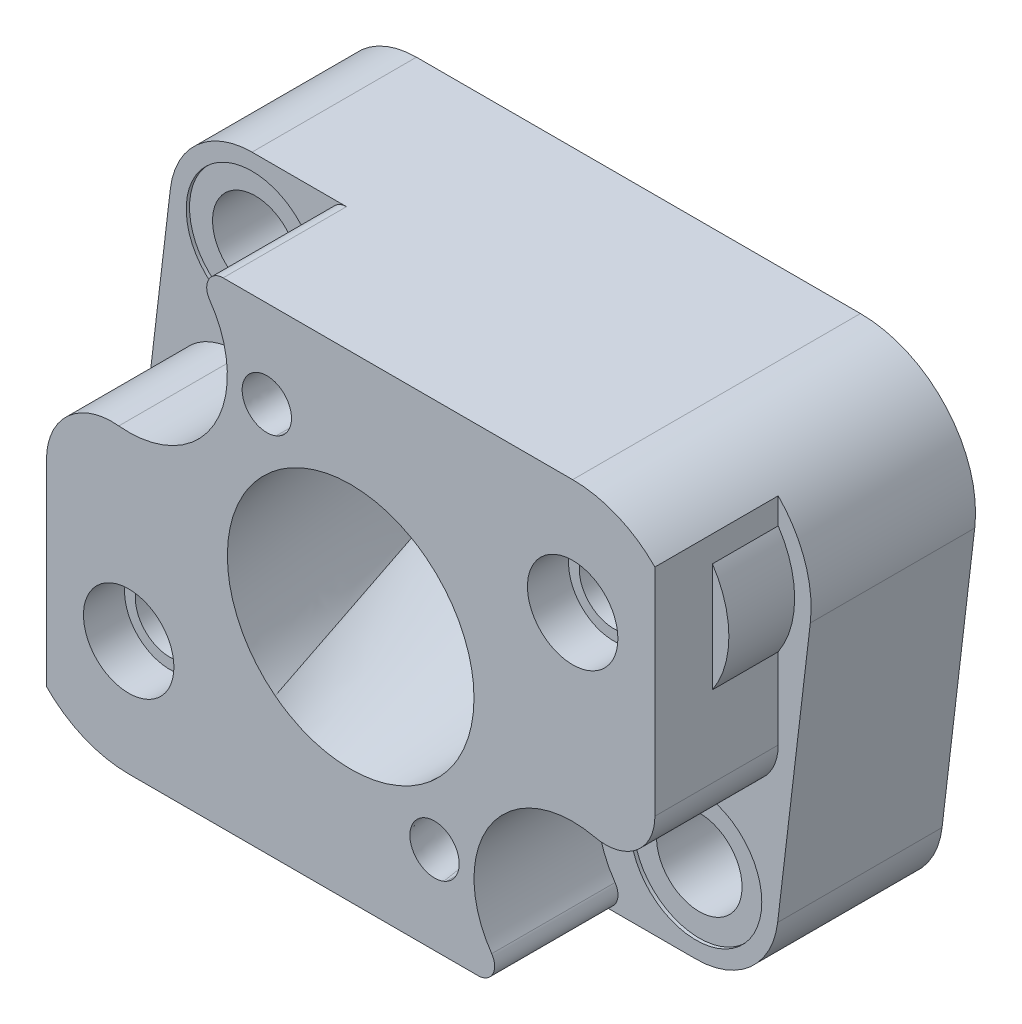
ISO-10303-21;
HEADER;
FILE_DESCRIPTION(('STEP AP214'),'2;1');
FILE_NAME('part.step','',(''),(''),'','','');
FILE_SCHEMA(('AUTOMOTIVE_DESIGN { 1 0 10303 214 1 1 1 1 }'));
ENDSEC;
DATA;
#1=APPLICATION_CONTEXT('core data for automotive mechanical design processes');
#2=APPLICATION_PROTOCOL_DEFINITION('international standard','automotive_design',2000,#1);
#3=PRODUCT_CONTEXT('',#1,'mechanical');
#4=PRODUCT('Part','Part','',(#3));
#5=PRODUCT_RELATED_PRODUCT_CATEGORY('part','',(#4));
#6=PRODUCT_DEFINITION_FORMATION('','',#4);
#7=PRODUCT_DEFINITION_CONTEXT('part definition',#1,'design');
#8=PRODUCT_DEFINITION('design','',#6,#7);
#9=PRODUCT_DEFINITION_SHAPE('','',#8);
#10=(LENGTH_UNIT() NAMED_UNIT(*) SI_UNIT(.MILLI.,.METRE.));
#11=(NAMED_UNIT(*) PLANE_ANGLE_UNIT() SI_UNIT($,.RADIAN.));
#12=(NAMED_UNIT(*) SI_UNIT($,.STERADIAN.) SOLID_ANGLE_UNIT());
#13=UNCERTAINTY_MEASURE_WITH_UNIT(LENGTH_MEASURE(1.E-05),#10,'distance_accuracy_value','');
#14=(GEOMETRIC_REPRESENTATION_CONTEXT(3) GLOBAL_UNCERTAINTY_ASSIGNED_CONTEXT((#13)) GLOBAL_UNIT_ASSIGNED_CONTEXT((#10,
#11,#12)) REPRESENTATION_CONTEXT('',''));
#15=CARTESIAN_POINT('',(0.,0.,0.));
#16=DIRECTION('',(0.,0.,1.));
#17=DIRECTION('',(1.,0.,0.));
#18=AXIS2_PLACEMENT_3D('',#15,#16,#17);
#19=CARTESIAN_POINT('',(0.,0.,15.));
#20=DIRECTION('',(0.,0.,1.));
#21=DIRECTION('',(1.,0.,0.));
#22=AXIS2_PLACEMENT_3D('',#19,#20,#21);
#23=PLANE('',#22);
#24=CARTESIAN_POINT('',(13.5,7.5,15.));
#25=DIRECTION('',(0.,0.,1.));
#26=DIRECTION('',(1.,0.,0.));
#27=AXIS2_PLACEMENT_3D('',#24,#25,#26);
#28=CIRCLE('',#27,2.1);
#29=CARTESIAN_POINT('',(15.6,7.5,15.));
#30=VERTEX_POINT('',#29);
#31=EDGE_CURVE('E866',#30,#30,#28,.F.);
#32=ORIENTED_EDGE('',*,*,#31,.T.);
#33=EDGE_LOOP('',(#32));
#34=FACE_BOUND('',#33,.T.);
#35=CARTESIAN_POINT('',(13.5,7.5,15.));
#36=DIRECTION('',(0.,0.,1.));
#37=DIRECTION('',(1.,0.,0.));
#38=AXIS2_PLACEMENT_3D('',#35,#36,#37);
#39=CIRCLE('',#38,2.75);
#40=CARTESIAN_POINT('',(16.25,7.5,15.));
#41=VERTEX_POINT('',#40);
#42=EDGE_CURVE('E560',#41,#41,#39,.T.);
#43=ORIENTED_EDGE('',*,*,#42,.T.);
#44=EDGE_LOOP('',(#43));
#45=FACE_BOUND('',#44,.T.);
#46=ADVANCED_FACE('F16',(#34,#45),#23,.T.);
#47=CARTESIAN_POINT('',(0.,0.,15.));
#48=DIRECTION('',(0.,0.,1.));
#49=DIRECTION('',(1.,0.,0.));
#50=AXIS2_PLACEMENT_3D('',#47,#48,#49);
#51=PLANE('',#50);
#52=CARTESIAN_POINT('',(-13.5,-7.5,15.));
#53=DIRECTION('',(0.,0.,1.));
#54=DIRECTION('',(1.,0.,0.));
#55=AXIS2_PLACEMENT_3D('',#52,#53,#54);
#56=CIRCLE('',#55,2.1);
#57=CARTESIAN_POINT('',(-11.4,-7.5,15.));
#58=VERTEX_POINT('',#57);
#59=EDGE_CURVE('E568',#58,#58,#56,.F.);
#60=ORIENTED_EDGE('',*,*,#59,.T.);
#61=EDGE_LOOP('',(#60));
#62=FACE_BOUND('',#61,.T.);
#63=CARTESIAN_POINT('',(-13.5,-7.5,15.));
#64=DIRECTION('',(0.,0.,1.));
#65=DIRECTION('',(1.,0.,0.));
#66=AXIS2_PLACEMENT_3D('',#63,#64,#65);
#67=CIRCLE('',#66,2.75);
#68=CARTESIAN_POINT('',(-10.75,-7.5,15.));
#69=VERTEX_POINT('',#68);
#70=EDGE_CURVE('E262',#69,#69,#67,.T.);
#71=ORIENTED_EDGE('',*,*,#70,.T.);
#72=EDGE_LOOP('',(#71));
#73=FACE_BOUND('',#72,.T.);
#74=ADVANCED_FACE('F1188',(#62,#73),#51,.T.);
#75=CARTESIAN_POINT('',(0.,0.,14.));
#76=DIRECTION('',(0.,0.,1.));
#77=DIRECTION('',(1.,0.,0.));
#78=AXIS2_PLACEMENT_3D('',#75,#76,#77);
#79=PLANE('',#78);
#80=CARTESIAN_POINT('',(13.5,7.5,14.));
#81=DIRECTION('',(0.,0.,1.));
#82=DIRECTION('',(1.,0.,0.));
#83=AXIS2_PLACEMENT_3D('',#80,#81,#82);
#84=CIRCLE('',#83,6.);
#85=CARTESIAN_POINT('',(18.5,10.8166247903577,14.));
#86=VERTEX_POINT('',#85);
#87=CARTESIAN_POINT('',(18.5,4.1833752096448,14.));
#88=VERTEX_POINT('',#87);
#89=EDGE_CURVE('E23',#86,#88,#84,.F.);
#90=ORIENTED_EDGE('',*,*,#89,.F.);
#91=DIRECTION('',(0.,1.,0.));
#92=VECTOR('',#91,1.);
#93=CARTESIAN_POINT('',(18.5,-6.183375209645,14.));
#94=LINE('',#93,#92);
#95=EDGE_CURVE('E242',#88,#86,#94,.T.);
#96=ORIENTED_EDGE('',*,*,#95,.F.);
#97=EDGE_LOOP('',(#90,#96));
#98=FACE_BOUND('',#97,.T.);
#99=ADVANCED_FACE('F241',(#98),#79,.T.);
#100=CARTESIAN_POINT('',(13.5,7.5,0.));
#101=DIRECTION('',(0.,0.,1.));
#102=DIRECTION('',(1.,0.,0.));
#103=AXIS2_PLACEMENT_3D('',#100,#101,#102);
#104=CYLINDRICAL_SURFACE('',#103,6.);
#105=CARTESIAN_POINT('',(13.5,7.5,10.));
#106=DIRECTION('',(0.,0.,1.));
#107=DIRECTION('',(1.,0.,0.));
#108=AXIS2_PLACEMENT_3D('',#105,#106,#107);
#109=CIRCLE('',#108,6.);
#110=CARTESIAN_POINT('',(18.5,10.8166247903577,10.));
#111=VERTEX_POINT('',#110);
#112=CARTESIAN_POINT('',(18.5,4.1833752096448,10.));
#113=VERTEX_POINT('',#112);
#114=EDGE_CURVE('E256',#111,#113,#109,.F.);
#115=ORIENTED_EDGE('',*,*,#114,.F.);
#116=DIRECTION('',(0.,0.,-1.));
#117=VECTOR('',#116,1.);
#118=CARTESIAN_POINT('',(18.5,10.81662479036,0.));
#119=LINE('',#118,#117);
#120=EDGE_CURVE('E248',#86,#111,#119,.T.);
#121=ORIENTED_EDGE('',*,*,#120,.F.);
#122=ORIENTED_EDGE('',*,*,#89,.T.);
#123=DIRECTION('',(0.,0.,-1.));
#124=VECTOR('',#123,1.);
#125=CARTESIAN_POINT('',(18.5,4.183375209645,0.));
#126=LINE('',#125,#124);
#127=EDGE_CURVE('E251',#113,#88,#126,.F.);
#128=ORIENTED_EDGE('',*,*,#127,.F.);
#129=EDGE_LOOP('',(#115,#121,#122,#128));
#130=FACE_BOUND('',#129,.T.);
#131=ADVANCED_FACE('F254',(#130),#104,.T.);
#132=CARTESIAN_POINT('',(0.,0.,14.));
#133=DIRECTION('',(0.,0.,1.));
#134=DIRECTION('',(1.,0.,0.));
#135=AXIS2_PLACEMENT_3D('',#132,#133,#134);
#136=PLANE('',#135);
#137=CARTESIAN_POINT('',(-13.5,-7.5,14.));
#138=DIRECTION('',(0.,0.,1.));
#139=DIRECTION('',(1.,0.,0.));
#140=AXIS2_PLACEMENT_3D('',#137,#138,#139);
#141=CIRCLE('',#140,6.);
#142=CARTESIAN_POINT('',(-18.5,-10.8166247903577,14.));
#143=VERTEX_POINT('',#142);
#144=CARTESIAN_POINT('',(-18.5,-4.1833752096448,14.));
#145=VERTEX_POINT('',#144);
#146=EDGE_CURVE('E243',#143,#145,#141,.F.);
#147=ORIENTED_EDGE('',*,*,#146,.F.);
#148=DIRECTION('',(0.,1.,0.));
#149=VECTOR('',#148,1.);
#150=CARTESIAN_POINT('',(-18.5,6.183375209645,14.));
#151=LINE('',#150,#149);
#152=EDGE_CURVE('E266',#145,#143,#151,.F.);
#153=ORIENTED_EDGE('',*,*,#152,.F.);
#154=EDGE_LOOP('',(#147,#153));
#155=FACE_BOUND('',#154,.T.);
#156=ADVANCED_FACE('F871',(#155),#136,.T.);
#157=CARTESIAN_POINT('',(-13.5,-7.5,0.));
#158=DIRECTION('',(0.,0.,1.));
#159=DIRECTION('',(1.,0.,0.));
#160=AXIS2_PLACEMENT_3D('',#157,#158,#159);
#161=CYLINDRICAL_SURFACE('',#160,6.);
#162=DIRECTION('',(0.,0.,1.));
#163=VECTOR('',#162,1.);
#164=CARTESIAN_POINT('',(-18.5,-10.81662479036,0.));
#165=LINE('',#164,#163);
#166=CARTESIAN_POINT('',(-18.5,-10.8166247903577,10.));
#167=VERTEX_POINT('',#166);
#168=EDGE_CURVE('E556',#143,#167,#165,.F.);
#169=ORIENTED_EDGE('',*,*,#168,.F.);
#170=ORIENTED_EDGE('',*,*,#146,.T.);
#171=DIRECTION('',(0.,0.,1.));
#172=VECTOR('',#171,1.);
#173=CARTESIAN_POINT('',(-18.5,-4.183375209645,0.));
#174=LINE('',#173,#172);
#175=CARTESIAN_POINT('',(-18.5,-4.1833752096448,10.));
#176=VERTEX_POINT('',#175);
#177=EDGE_CURVE('E555',#176,#145,#174,.T.);
#178=ORIENTED_EDGE('',*,*,#177,.F.);
#179=CARTESIAN_POINT('',(-13.5,-7.5,10.));
#180=DIRECTION('',(0.,0.,1.));
#181=DIRECTION('',(1.,0.,0.));
#182=AXIS2_PLACEMENT_3D('',#179,#180,#181);
#183=CIRCLE('',#182,6.);
#184=EDGE_CURVE('E844',#167,#176,#183,.F.);
#185=ORIENTED_EDGE('',*,*,#184,.F.);
#186=EDGE_LOOP('',(#169,#170,#178,#185));
#187=FACE_BOUND('',#186,.T.);
#188=ADVANCED_FACE('F869',(#187),#161,.T.);
#189=CARTESIAN_POINT('',(-13.5,9.5,0.));
#190=DIRECTION('',(0.,0.,1.));
#191=DIRECTION('',(1.,0.,0.));
#192=AXIS2_PLACEMENT_3D('',#189,#190,#191);
#193=CYLINDRICAL_SURFACE('',#192,4.);
#194=CARTESIAN_POINT('',(-13.5,9.5,10.));
#195=DIRECTION('',(0.,0.,1.));
#196=DIRECTION('',(1.,0.,0.));
#197=AXIS2_PLACEMENT_3D('',#194,#195,#196);
#198=CIRCLE('',#197,4.);
#199=CARTESIAN_POINT('',(-9.5,9.5,10.));
#200=VERTEX_POINT('',#199);
#201=EDGE_CURVE('E841',#200,#200,#198,.F.);
#202=ORIENTED_EDGE('',*,*,#201,.F.);
#203=EDGE_LOOP('',(#202));
#204=FACE_BOUND('',#203,.T.);
#205=CARTESIAN_POINT('',(-13.5,9.5,9.8));
#206=DIRECTION('',(0.,0.,1.));
#207=DIRECTION('',(1.,0.,0.));
#208=AXIS2_PLACEMENT_3D('',#205,#206,#207);
#209=CIRCLE('',#208,4.);
#210=CARTESIAN_POINT('',(-9.5,9.5,9.8));
#211=VERTEX_POINT('',#210);
#212=EDGE_CURVE('E838',#211,#211,#209,.T.);
#213=ORIENTED_EDGE('',*,*,#212,.F.);
#214=EDGE_LOOP('',(#213));
#215=FACE_BOUND('',#214,.T.);
#216=ADVANCED_FACE('F878',(#204,#215),#193,.F.);
#217=CARTESIAN_POINT('',(13.5,-9.5,0.));
#218=DIRECTION('',(0.,0.,1.));
#219=DIRECTION('',(1.,0.,0.));
#220=AXIS2_PLACEMENT_3D('',#217,#218,#219);
#221=CYLINDRICAL_SURFACE('',#220,4.);
#222=CARTESIAN_POINT('',(13.5,-9.5,10.));
#223=DIRECTION('',(0.,0.,1.));
#224=DIRECTION('',(1.,0.,0.));
#225=AXIS2_PLACEMENT_3D('',#222,#223,#224);
#226=CIRCLE('',#225,4.);
#227=CARTESIAN_POINT('',(17.5,-9.5,10.));
#228=VERTEX_POINT('',#227);
#229=EDGE_CURVE('E564',#228,#228,#226,.F.);
#230=ORIENTED_EDGE('',*,*,#229,.F.);
#231=EDGE_LOOP('',(#230));
#232=FACE_BOUND('',#231,.T.);
#233=CARTESIAN_POINT('',(13.5,-9.5,9.8));
#234=DIRECTION('',(0.,0.,1.));
#235=DIRECTION('',(1.,0.,0.));
#236=AXIS2_PLACEMENT_3D('',#233,#234,#235);
#237=CIRCLE('',#236,4.);
#238=CARTESIAN_POINT('',(17.5,-9.5,9.8));
#239=VERTEX_POINT('',#238);
#240=EDGE_CURVE('E835',#239,#239,#237,.T.);
#241=ORIENTED_EDGE('',*,*,#240,.F.);
#242=EDGE_LOOP('',(#241));
#243=FACE_BOUND('',#242,.T.);
#244=ADVANCED_FACE('F885',(#232,#243),#221,.F.);
#245=CARTESIAN_POINT('',(13.5,7.5,5.));
#246=DIRECTION('',(0.,0.,1.));
#247=DIRECTION('',(1.,0.,0.));
#248=AXIS2_PLACEMENT_3D('',#245,#246,#247);
#249=CYLINDRICAL_SURFACE('',#248,2.1);
#250=ORIENTED_EDGE('',*,*,#31,.F.);
#251=EDGE_LOOP('',(#250));
#252=FACE_BOUND('',#251,.T.);
#253=CARTESIAN_POINT('',(13.5,7.5,5.));
#254=DIRECTION('',(0.,0.,1.));
#255=DIRECTION('',(1.,0.,0.));
#256=AXIS2_PLACEMENT_3D('',#253,#254,#255);
#257=CIRCLE('',#256,2.1);
#258=CARTESIAN_POINT('',(15.6,7.5,5.));
#259=VERTEX_POINT('',#258);
#260=EDGE_CURVE('E832',#259,#259,#257,.F.);
#261=ORIENTED_EDGE('',*,*,#260,.T.);
#262=EDGE_LOOP('',(#261));
#263=FACE_BOUND('',#262,.T.);
#264=ADVANCED_FACE('F889',(#252,#263),#249,.F.);
#265=CARTESIAN_POINT('',(-13.5,-7.5,5.));
#266=DIRECTION('',(0.,0.,1.));
#267=DIRECTION('',(1.,0.,0.));
#268=AXIS2_PLACEMENT_3D('',#265,#266,#267);
#269=CYLINDRICAL_SURFACE('',#268,2.1);
#270=ORIENTED_EDGE('',*,*,#59,.F.);
#271=EDGE_LOOP('',(#270));
#272=FACE_BOUND('',#271,.T.);
#273=CARTESIAN_POINT('',(-13.5,-7.5,5.));
#274=DIRECTION('',(0.,0.,1.));
#275=DIRECTION('',(1.,0.,0.));
#276=AXIS2_PLACEMENT_3D('',#273,#274,#275);
#277=CIRCLE('',#276,2.1);
#278=CARTESIAN_POINT('',(-11.4,-7.5,5.));
#279=VERTEX_POINT('',#278);
#280=EDGE_CURVE('E829',#279,#279,#277,.F.);
#281=ORIENTED_EDGE('',*,*,#280,.T.);
#282=EDGE_LOOP('',(#281));
#283=FACE_BOUND('',#282,.T.);
#284=ADVANCED_FACE('F893',(#272,#283),#269,.F.);
#285=CARTESIAN_POINT('',(13.5,-9.5,0.));
#286=DIRECTION('',(0.,0.,1.));
#287=DIRECTION('',(1.,0.,0.));
#288=AXIS2_PLACEMENT_3D('',#285,#286,#287);
#289=CYLINDRICAL_SURFACE('',#288,6.);
#290=CARTESIAN_POINT('',(13.5,-9.5,10.));
#291=DIRECTION('',(0.,0.,1.));
#292=DIRECTION('',(1.,0.,0.));
#293=AXIS2_PLACEMENT_3D('',#290,#291,#292);
#294=CIRCLE('',#293,6.);
#295=CARTESIAN_POINT('',(14.8333333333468,-3.65002374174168,10.));
#296=VERTEX_POINT('',#295);
#297=CARTESIAN_POINT('',(8.5760891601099,-12.9285714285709,10.));
#298=VERTEX_POINT('',#297);
#299=EDGE_CURVE('E855',#296,#298,#294,.T.);
#300=ORIENTED_EDGE('',*,*,#299,.F.);
#301=DIRECTION('',(0.,0.,-1.));
#302=VECTOR('',#301,1.);
#303=CARTESIAN_POINT('',(14.8333333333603,-3.65002374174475,40.313));
#304=LINE('',#303,#302);
#305=CARTESIAN_POINT('',(14.8333333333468,-3.65002374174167,17.5));
#306=VERTEX_POINT('',#305);
#307=EDGE_CURVE('E561',#306,#296,#304,.T.);
#308=ORIENTED_EDGE('',*,*,#307,.F.);
#309=CARTESIAN_POINT('',(13.5,-9.5,17.5));
#310=DIRECTION('',(0.,0.,1.));
#311=DIRECTION('',(1.,0.,0.));
#312=AXIS2_PLACEMENT_3D('',#309,#310,#311);
#313=CIRCLE('',#312,6.);
#314=CARTESIAN_POINT('',(8.57608916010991,-12.9285714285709,17.5));
#315=VERTEX_POINT('',#314);
#316=EDGE_CURVE('E827',#315,#306,#313,.F.);
#317=ORIENTED_EDGE('',*,*,#316,.F.);
#318=DIRECTION('',(0.,0.,-1.));
#319=VECTOR('',#318,1.);
#320=CARTESIAN_POINT('',(8.57608916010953,-12.9285714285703,40.313));
#321=LINE('',#320,#319);
#322=EDGE_CURVE('E258',#298,#315,#321,.F.);
#323=ORIENTED_EDGE('',*,*,#322,.F.);
#324=EDGE_LOOP('',(#300,#308,#317,#323));
#325=FACE_BOUND('',#324,.T.);
#326=ADVANCED_FACE('F897',(#325),#289,.F.);
#327=CARTESIAN_POINT('',(15.5,-0.725035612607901,40.313));
#328=DIRECTION('',(0.,0.,-1.));
#329=DIRECTION('',(-1.,0.,0.));
#330=AXIS2_PLACEMENT_3D('',#327,#328,#329);
#331=CYLINDRICAL_SURFACE('',#330,3.);
#332=CARTESIAN_POINT('',(15.5,-0.725035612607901,17.5));
#333=DIRECTION('',(0.,0.,-1.));
#334=DIRECTION('',(-1.,0.,0.));
#335=AXIS2_PLACEMENT_3D('',#332,#333,#334);
#336=CIRCLE('',#335,3.);
#337=CARTESIAN_POINT('',(18.5,-0.725035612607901,17.5));
#338=VERTEX_POINT('',#337);
#339=EDGE_CURVE('E597',#306,#338,#336,.F.);
#340=ORIENTED_EDGE('',*,*,#339,.F.);
#341=ORIENTED_EDGE('',*,*,#307,.T.);
#342=CARTESIAN_POINT('',(15.5,-0.725035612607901,10.));
#343=DIRECTION('',(0.,0.,-1.));
#344=DIRECTION('',(-1.,0.,0.));
#345=AXIS2_PLACEMENT_3D('',#342,#343,#344);
#346=CIRCLE('',#345,3.);
#347=CARTESIAN_POINT('',(18.5,-0.725035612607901,10.));
#348=VERTEX_POINT('',#347);
#349=EDGE_CURVE('E857',#348,#296,#346,.T.);
#350=ORIENTED_EDGE('',*,*,#349,.F.);
#351=DIRECTION('',(0.,0.,-1.));
#352=VECTOR('',#351,1.);
#353=CARTESIAN_POINT('',(18.5,-0.725035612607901,0.));
#354=LINE('',#353,#352);
#355=EDGE_CURVE('E257',#338,#348,#354,.T.);
#356=ORIENTED_EDGE('',*,*,#355,.F.);
#357=EDGE_LOOP('',(#340,#341,#350,#356));
#358=FACE_BOUND('',#357,.T.);
#359=ADVANCED_FACE('F901',(#358),#331,.T.);
#360=CARTESIAN_POINT('',(-13.5,9.5,0.));
#361=DIRECTION('',(0.,0.,1.));
#362=DIRECTION('',(1.,0.,0.));
#363=AXIS2_PLACEMENT_3D('',#360,#361,#362);
#364=CYLINDRICAL_SURFACE('',#363,6.);
#365=CARTESIAN_POINT('',(-13.5,9.5,10.));
#366=DIRECTION('',(0.,0.,1.));
#367=DIRECTION('',(1.,0.,0.));
#368=AXIS2_PLACEMENT_3D('',#365,#366,#367);
#369=CIRCLE('',#368,6.);
#370=CARTESIAN_POINT('',(-14.1,3.53007537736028,10.));
#371=VERTEX_POINT('',#370);
#372=CARTESIAN_POINT('',(-8.57608916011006,12.9285714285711,10.));
#373=VERTEX_POINT('',#372);
#374=EDGE_CURVE('E584',#371,#373,#369,.T.);
#375=ORIENTED_EDGE('',*,*,#374,.F.);
#376=DIRECTION('',(0.,0.,-1.));
#377=VECTOR('',#376,1.);
#378=CARTESIAN_POINT('',(-14.1,3.53007537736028,40.313));
#379=LINE('',#378,#377);
#380=CARTESIAN_POINT('',(-14.1,3.53007537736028,17.5));
#381=VERTEX_POINT('',#380);
#382=EDGE_CURVE('E557',#381,#371,#379,.T.);
#383=ORIENTED_EDGE('',*,*,#382,.F.);
#384=CARTESIAN_POINT('',(-13.5,9.5,17.5));
#385=DIRECTION('',(0.,0.,1.));
#386=DIRECTION('',(1.,0.,0.));
#387=AXIS2_PLACEMENT_3D('',#384,#385,#386);
#388=CIRCLE('',#387,6.);
#389=CARTESIAN_POINT('',(-8.57608916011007,12.9285714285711,17.5));
#390=VERTEX_POINT('',#389);
#391=EDGE_CURVE('E822',#390,#381,#388,.F.);
#392=ORIENTED_EDGE('',*,*,#391,.F.);
#393=DIRECTION('',(0.,0.,-1.));
#394=VECTOR('',#393,1.);
#395=CARTESIAN_POINT('',(-8.57608916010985,12.9285714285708,40.313));
#396=LINE('',#395,#394);
#397=EDGE_CURVE('E562',#373,#390,#396,.F.);
#398=ORIENTED_EDGE('',*,*,#397,.F.);
#399=EDGE_LOOP('',(#375,#383,#392,#398));
#400=FACE_BOUND('',#399,.T.);
#401=ADVANCED_FACE('F905',(#400),#364,.F.);
#402=CARTESIAN_POINT('',(-14.5,-0.449874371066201,40.313));
#403=DIRECTION('',(0.,0.,-1.));
#404=DIRECTION('',(-1.,0.,0.));
#405=AXIS2_PLACEMENT_3D('',#402,#403,#404);
#406=CYLINDRICAL_SURFACE('',#405,4.);
#407=CARTESIAN_POINT('',(-14.5,-0.449874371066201,17.5));
#408=DIRECTION('',(0.,0.,-1.));
#409=DIRECTION('',(-1.,0.,0.));
#410=AXIS2_PLACEMENT_3D('',#407,#408,#409);
#411=CIRCLE('',#410,4.);
#412=CARTESIAN_POINT('',(-18.5,-0.449874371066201,17.5));
#413=VERTEX_POINT('',#412);
#414=EDGE_CURVE('E593',#381,#413,#411,.F.);
#415=ORIENTED_EDGE('',*,*,#414,.F.);
#416=ORIENTED_EDGE('',*,*,#382,.T.);
#417=CARTESIAN_POINT('',(-14.5,-0.449874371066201,10.));
#418=DIRECTION('',(0.,0.,-1.));
#419=DIRECTION('',(-1.,0.,0.));
#420=AXIS2_PLACEMENT_3D('',#417,#418,#419);
#421=CIRCLE('',#420,4.);
#422=CARTESIAN_POINT('',(-18.5,-0.449874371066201,10.));
#423=VERTEX_POINT('',#422);
#424=EDGE_CURVE('E578',#423,#371,#421,.T.);
#425=ORIENTED_EDGE('',*,*,#424,.F.);
#426=DIRECTION('',(0.,0.,1.));
#427=VECTOR('',#426,1.);
#428=CARTESIAN_POINT('',(-18.5,-0.449874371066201,0.));
#429=LINE('',#428,#427);
#430=EDGE_CURVE('E553',#413,#423,#429,.F.);
#431=ORIENTED_EDGE('',*,*,#430,.F.);
#432=EDGE_LOOP('',(#415,#416,#425,#431));
#433=FACE_BOUND('',#432,.T.);
#434=ADVANCED_FACE('F909',(#433),#406,.T.);
#435=CARTESIAN_POINT('',(13.5,7.5,0.));
#436=DIRECTION('',(0.,0.,1.));
#437=DIRECTION('',(1.,0.,0.));
#438=AXIS2_PLACEMENT_3D('',#435,#436,#437);
#439=CYLINDRICAL_SURFACE('',#438,2.75);
#440=CARTESIAN_POINT('',(13.5,7.5,17.5));
#441=DIRECTION('',(0.,0.,1.));
#442=DIRECTION('',(1.,0.,0.));
#443=AXIS2_PLACEMENT_3D('',#440,#441,#442);
#444=CIRCLE('',#443,2.75);
#445=CARTESIAN_POINT('',(16.25,7.5,17.5));
#446=VERTEX_POINT('',#445);
#447=EDGE_CURVE('E814',#446,#446,#444,.F.);
#448=ORIENTED_EDGE('',*,*,#447,.F.);
#449=EDGE_LOOP('',(#448));
#450=FACE_BOUND('',#449,.T.);
#451=ORIENTED_EDGE('',*,*,#42,.F.);
#452=EDGE_LOOP('',(#451));
#453=FACE_BOUND('',#452,.T.);
#454=ADVANCED_FACE('F913',(#450,#453),#439,.F.);
#455=CARTESIAN_POINT('',(-13.5,-7.5,0.));
#456=DIRECTION('',(0.,0.,1.));
#457=DIRECTION('',(1.,0.,0.));
#458=AXIS2_PLACEMENT_3D('',#455,#456,#457);
#459=CYLINDRICAL_SURFACE('',#458,2.75);
#460=CARTESIAN_POINT('',(-13.5,-7.5,17.5));
#461=DIRECTION('',(0.,0.,1.));
#462=DIRECTION('',(1.,0.,0.));
#463=AXIS2_PLACEMENT_3D('',#460,#461,#462);
#464=CIRCLE('',#463,2.75);
#465=CARTESIAN_POINT('',(-10.75,-7.5,17.5));
#466=VERTEX_POINT('',#465);
#467=EDGE_CURVE('E812',#466,#466,#464,.F.);
#468=ORIENTED_EDGE('',*,*,#467,.F.);
#469=EDGE_LOOP('',(#468));
#470=FACE_BOUND('',#469,.T.);
#471=ORIENTED_EDGE('',*,*,#70,.F.);
#472=EDGE_LOOP('',(#471));
#473=FACE_BOUND('',#472,.T.);
#474=ADVANCED_FACE('F917',(#470,#473),#459,.F.);
#475=CARTESIAN_POINT('',(7.755437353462,-13.5,40.313));
#476=DIRECTION('',(0.,0.,-1.));
#477=DIRECTION('',(-1.,0.,0.));
#478=AXIS2_PLACEMENT_3D('',#475,#476,#477);
#479=CYLINDRICAL_SURFACE('',#478,1.);
#480=CARTESIAN_POINT('',(7.755437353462,-13.5,17.5));
#481=DIRECTION('',(0.,0.,-1.));
#482=DIRECTION('',(-1.,0.,0.));
#483=AXIS2_PLACEMENT_3D('',#480,#481,#482);
#484=CIRCLE('',#483,1.);
#485=CARTESIAN_POINT('',(7.755437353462,-14.5,17.5));
#486=VERTEX_POINT('',#485);
#487=EDGE_CURVE('E592',#486,#315,#484,.F.);
#488=ORIENTED_EDGE('',*,*,#487,.F.);
#489=DIRECTION('',(0.,0.,-1.));
#490=VECTOR('',#489,1.);
#491=CARTESIAN_POINT('',(7.755437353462,-14.5,0.));
#492=LINE('',#491,#490);
#493=CARTESIAN_POINT('',(7.755437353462,-14.5,10.));
#494=VERTEX_POINT('',#493);
#495=EDGE_CURVE('E550',#494,#486,#492,.F.);
#496=ORIENTED_EDGE('',*,*,#495,.F.);
#497=CARTESIAN_POINT('',(7.755437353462,-13.5,10.));
#498=DIRECTION('',(0.,0.,-1.));
#499=DIRECTION('',(-1.,0.,0.));
#500=AXIS2_PLACEMENT_3D('',#497,#498,#499);
#501=CIRCLE('',#500,1.);
#502=EDGE_CURVE('E853',#298,#494,#501,.T.);
#503=ORIENTED_EDGE('',*,*,#502,.F.);
#504=ORIENTED_EDGE('',*,*,#322,.T.);
#505=EDGE_LOOP('',(#488,#496,#503,#504));
#506=FACE_BOUND('',#505,.T.);
#507=ADVANCED_FACE('F921',(#506),#479,.T.);
#508=CARTESIAN_POINT('',(18.5,-6.183375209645,0.));
#509=DIRECTION('',(1.,0.,0.));
#510=DIRECTION('',(0.,0.,-1.));
#511=AXIS2_PLACEMENT_3D('',#508,#509,#510);
#512=PLANE('',#511);
#513=ORIENTED_EDGE('',*,*,#127,.T.);
#514=ORIENTED_EDGE('',*,*,#95,.T.);
#515=ORIENTED_EDGE('',*,*,#120,.T.);
#516=DIRECTION('',(0.,1.,0.));
#517=VECTOR('',#516,1.);
#518=CARTESIAN_POINT('',(18.5,0.,10.));
#519=LINE('',#518,#517);
#520=CARTESIAN_POINT('',(18.4999999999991,12.3989794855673,10.));
#521=VERTEX_POINT('',#520);
#522=EDGE_CURVE('E852',#521,#111,#519,.F.);
#523=ORIENTED_EDGE('',*,*,#522,.F.);
#524=DIRECTION('',(0.,0.,1.));
#525=VECTOR('',#524,1.);
#526=CARTESIAN_POINT('',(18.4999999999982,12.3989794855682,0.));
#527=LINE('',#526,#525);
#528=CARTESIAN_POINT('',(18.4999999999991,12.3989794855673,17.5));
#529=VERTEX_POINT('',#528);
#530=EDGE_CURVE('E545',#529,#521,#527,.F.);
#531=ORIENTED_EDGE('',*,*,#530,.F.);
#532=DIRECTION('',(0.,1.,0.));
#533=VECTOR('',#532,1.);
#534=CARTESIAN_POINT('',(18.5,0.,17.5));
#535=LINE('',#534,#533);
#536=EDGE_CURVE('E594',#338,#529,#535,.T.);
#537=ORIENTED_EDGE('',*,*,#536,.F.);
#538=ORIENTED_EDGE('',*,*,#355,.T.);
#539=DIRECTION('',(0.,1.,0.));
#540=VECTOR('',#539,1.);
#541=CARTESIAN_POINT('',(18.5,0.,10.));
#542=LINE('',#541,#540);
#543=EDGE_CURVE('E252',#113,#348,#542,.F.);
#544=ORIENTED_EDGE('',*,*,#543,.F.);
#545=EDGE_LOOP('',(#513,#514,#515,#523,#531,#537,#538,#544));
#546=FACE_BOUND('',#545,.T.);
#547=ADVANCED_FACE('F246',(#546),#512,.T.);
#548=CARTESIAN_POINT('',(0.,0.,10.));
#549=DIRECTION('',(0.,0.,1.));
#550=DIRECTION('',(1.,0.,0.));
#551=AXIS2_PLACEMENT_3D('',#548,#549,#550);
#552=PLANE('',#551);
#553=ORIENTED_EDGE('',*,*,#229,.T.);
#554=EDGE_LOOP('',(#553));
#555=FACE_BOUND('',#554,.T.);
#556=ORIENTED_EDGE('',*,*,#522,.T.);
#557=ORIENTED_EDGE('',*,*,#114,.T.);
#558=ORIENTED_EDGE('',*,*,#543,.T.);
#559=ORIENTED_EDGE('',*,*,#349,.T.);
#560=ORIENTED_EDGE('',*,*,#299,.T.);
#561=ORIENTED_EDGE('',*,*,#502,.T.);
#562=DIRECTION('',(1.,0.,0.));
#563=VECTOR('',#562,1.);
#564=CARTESIAN_POINT('',(-13.5,-14.5,10.));
#565=LINE('',#564,#563);
#566=CARTESIAN_POINT('',(13.5,-14.5,10.));
#567=VERTEX_POINT('',#566);
#568=EDGE_CURVE('E536',#567,#494,#565,.F.);
#569=ORIENTED_EDGE('',*,*,#568,.F.);
#570=CARTESIAN_POINT('',(13.5,-9.5,10.));
#571=DIRECTION('',(0.,0.,1.));
#572=DIRECTION('',(1.,0.,0.));
#573=AXIS2_PLACEMENT_3D('',#570,#571,#572);
#574=CIRCLE('',#573,5.);
#575=CARTESIAN_POINT('',(18.4652773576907,-10.088235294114,10.));
#576=VERTEX_POINT('',#575);
#577=EDGE_CURVE('E530',#576,#567,#574,.F.);
#578=ORIENTED_EDGE('',*,*,#577,.F.);
#579=DIRECTION('',(0.117647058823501,0.993055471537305,0.));
#580=VECTOR('',#579,1.);
#581=CARTESIAN_POINT('',(18.46527735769,-10.08823529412,10.));
#582=LINE('',#581,#580);
#583=CARTESIAN_POINT('',(20.451388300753,6.67647058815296,10.));
#584=VERTEX_POINT('',#583);
#585=EDGE_CURVE('E527',#584,#576,#582,.F.);
#586=ORIENTED_EDGE('',*,*,#585,.F.);
#587=CARTESIAN_POINT('',(13.5,7.5,10.));
#588=DIRECTION('',(0.,0.,1.));
#589=DIRECTION('',(1.,0.,0.));
#590=AXIS2_PLACEMENT_3D('',#587,#588,#589);
#591=CIRCLE('',#590,7.);
#592=EDGE_CURVE('E544',#521,#584,#591,.F.);
#593=ORIENTED_EDGE('',*,*,#592,.F.);
#594=EDGE_LOOP('',(#556,#557,#558,#559,#560,#561,#569,#578,#586,#593));
#595=FACE_BOUND('',#594,.T.);
#596=ADVANCED_FACE('F928',(#555,#595),#552,.T.);
#597=CARTESIAN_POINT('',(-7.755437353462,13.5,40.313));
#598=DIRECTION('',(0.,0.,-1.));
#599=DIRECTION('',(-1.,0.,0.));
#600=AXIS2_PLACEMENT_3D('',#597,#598,#599);
#601=CYLINDRICAL_SURFACE('',#600,1.);
#602=CARTESIAN_POINT('',(-7.755437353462,13.5,17.5));
#603=DIRECTION('',(0.,0.,-1.));
#604=DIRECTION('',(-1.,0.,0.));
#605=AXIS2_PLACEMENT_3D('',#602,#603,#604);
#606=CIRCLE('',#605,1.);
#607=CARTESIAN_POINT('',(-7.755437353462,14.5,17.5));
#608=VERTEX_POINT('',#607);
#609=EDGE_CURVE('E596',#608,#390,#606,.F.);
#610=ORIENTED_EDGE('',*,*,#609,.F.);
#611=DIRECTION('',(0.,0.,1.));
#612=VECTOR('',#611,1.);
#613=CARTESIAN_POINT('',(-7.755437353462,14.5,0.));
#614=LINE('',#613,#612);
#615=CARTESIAN_POINT('',(-7.755437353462,14.5,10.));
#616=VERTEX_POINT('',#615);
#617=EDGE_CURVE('E540',#616,#608,#614,.T.);
#618=ORIENTED_EDGE('',*,*,#617,.F.);
#619=CARTESIAN_POINT('',(-7.755437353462,13.5,10.));
#620=DIRECTION('',(0.,0.,-1.));
#621=DIRECTION('',(-1.,0.,0.));
#622=AXIS2_PLACEMENT_3D('',#619,#620,#621);
#623=CIRCLE('',#622,1.);
#624=EDGE_CURVE('E846',#373,#616,#623,.T.);
#625=ORIENTED_EDGE('',*,*,#624,.F.);
#626=ORIENTED_EDGE('',*,*,#397,.T.);
#627=EDGE_LOOP('',(#610,#618,#625,#626));
#628=FACE_BOUND('',#627,.T.);
#629=ADVANCED_FACE('F931',(#628),#601,.T.);
#630=CARTESIAN_POINT('',(-18.5,6.183375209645,0.));
#631=DIRECTION('',(-1.,0.,0.));
#632=DIRECTION('',(0.,0.,1.));
#633=AXIS2_PLACEMENT_3D('',#630,#631,#632);
#634=PLANE('',#633);
#635=ORIENTED_EDGE('',*,*,#177,.T.);
#636=ORIENTED_EDGE('',*,*,#152,.T.);
#637=ORIENTED_EDGE('',*,*,#168,.T.);
#638=DIRECTION('',(0.,1.,0.));
#639=VECTOR('',#638,1.);
#640=CARTESIAN_POINT('',(-18.5,0.,10.));
#641=LINE('',#640,#639);
#642=CARTESIAN_POINT('',(-18.4999999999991,-12.3989794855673,10.));
#643=VERTEX_POINT('',#642);
#644=EDGE_CURVE('E588',#643,#167,#641,.T.);
#645=ORIENTED_EDGE('',*,*,#644,.F.);
#646=DIRECTION('',(0.,0.,1.));
#647=VECTOR('',#646,1.);
#648=CARTESIAN_POINT('',(-18.4999999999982,-12.3989794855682,0.));
#649=LINE('',#648,#647);
#650=CARTESIAN_POINT('',(-18.4999999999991,-12.3989794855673,17.5));
#651=VERTEX_POINT('',#650);
#652=EDGE_CURVE('E531',#651,#643,#649,.F.);
#653=ORIENTED_EDGE('',*,*,#652,.F.);
#654=DIRECTION('',(0.,1.,0.));
#655=VECTOR('',#654,1.);
#656=CARTESIAN_POINT('',(-18.5,0.,17.5));
#657=LINE('',#656,#655);
#658=EDGE_CURVE('E590',#413,#651,#657,.F.);
#659=ORIENTED_EDGE('',*,*,#658,.F.);
#660=ORIENTED_EDGE('',*,*,#430,.T.);
#661=DIRECTION('',(0.,1.,0.));
#662=VECTOR('',#661,1.);
#663=CARTESIAN_POINT('',(-18.5,0.,10.));
#664=LINE('',#663,#662);
#665=EDGE_CURVE('E575',#176,#423,#664,.T.);
#666=ORIENTED_EDGE('',*,*,#665,.F.);
#667=EDGE_LOOP('',(#635,#636,#637,#645,#653,#659,#660,#666));
#668=FACE_BOUND('',#667,.T.);
#669=ADVANCED_FACE('F935',(#668),#634,.T.);
#670=CARTESIAN_POINT('',(0.,0.,10.));
#671=DIRECTION('',(0.,0.,1.));
#672=DIRECTION('',(1.,0.,0.));
#673=AXIS2_PLACEMENT_3D('',#670,#671,#672);
#674=PLANE('',#673);
#675=ORIENTED_EDGE('',*,*,#201,.T.);
#676=EDGE_LOOP('',(#675));
#677=FACE_BOUND('',#676,.T.);
#678=ORIENTED_EDGE('',*,*,#644,.T.);
#679=ORIENTED_EDGE('',*,*,#184,.T.);
#680=ORIENTED_EDGE('',*,*,#665,.T.);
#681=ORIENTED_EDGE('',*,*,#424,.T.);
#682=ORIENTED_EDGE('',*,*,#374,.T.);
#683=ORIENTED_EDGE('',*,*,#624,.T.);
#684=DIRECTION('',(1.,0.,0.));
#685=VECTOR('',#684,1.);
#686=CARTESIAN_POINT('',(13.5,14.5,10.));
#687=LINE('',#686,#685);
#688=CARTESIAN_POINT('',(-13.5,14.5,10.));
#689=VERTEX_POINT('',#688);
#690=EDGE_CURVE('E520',#689,#616,#687,.T.);
#691=ORIENTED_EDGE('',*,*,#690,.F.);
#692=CARTESIAN_POINT('',(-13.5,9.5,10.));
#693=DIRECTION('',(0.,0.,1.));
#694=DIRECTION('',(1.,0.,0.));
#695=AXIS2_PLACEMENT_3D('',#692,#693,#694);
#696=CIRCLE('',#695,5.);
#697=CARTESIAN_POINT('',(-18.4652773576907,10.088235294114,10.));
#698=VERTEX_POINT('',#697);
#699=EDGE_CURVE('E517',#698,#689,#696,.F.);
#700=ORIENTED_EDGE('',*,*,#699,.F.);
#701=DIRECTION('',(-0.117647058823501,-0.993055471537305,0.));
#702=VECTOR('',#701,1.);
#703=CARTESIAN_POINT('',(-18.46527735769,10.08823529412,10.));
#704=LINE('',#703,#702);
#705=CARTESIAN_POINT('',(-20.451388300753,-6.67647058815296,10.));
#706=VERTEX_POINT('',#705);
#707=EDGE_CURVE('E514',#706,#698,#704,.F.);
#708=ORIENTED_EDGE('',*,*,#707,.F.);
#709=CARTESIAN_POINT('',(-13.5,-7.5,10.));
#710=DIRECTION('',(0.,0.,1.));
#711=DIRECTION('',(1.,0.,0.));
#712=AXIS2_PLACEMENT_3D('',#709,#710,#711);
#713=CIRCLE('',#712,7.);
#714=EDGE_CURVE('E533',#643,#706,#713,.F.);
#715=ORIENTED_EDGE('',*,*,#714,.F.);
#716=EDGE_LOOP('',(#678,#679,#680,#681,#682,#683,#691,#700,#708,#715));
#717=FACE_BOUND('',#716,.T.);
#718=ADVANCED_FACE('F939',(#677,#717),#674,.T.);
#719=CARTESIAN_POINT('',(0.,0.,9.8));
#720=DIRECTION('',(0.,0.,1.));
#721=DIRECTION('',(1.,0.,0.));
#722=AXIS2_PLACEMENT_3D('',#719,#720,#721);
#723=PLANE('',#722);
#724=CARTESIAN_POINT('',(-13.5,9.5,9.8));
#725=DIRECTION('',(0.,0.,1.));
#726=DIRECTION('',(1.,0.,0.));
#727=AXIS2_PLACEMENT_3D('',#724,#725,#726);
#728=CIRCLE('',#727,2.6);
#729=CARTESIAN_POINT('',(-10.9,9.5,9.8));
#730=VERTEX_POINT('',#729);
#731=EDGE_CURVE('E969',#730,#730,#728,.F.);
#732=ORIENTED_EDGE('',*,*,#731,.T.);
#733=EDGE_LOOP('',(#732));
#734=FACE_BOUND('',#733,.T.);
#735=ORIENTED_EDGE('',*,*,#212,.T.);
#736=EDGE_LOOP('',(#735));
#737=FACE_BOUND('',#736,.T.);
#738=ADVANCED_FACE('F942',(#734,#737),#723,.T.);
#739=CARTESIAN_POINT('',(0.,0.,9.8));
#740=DIRECTION('',(0.,0.,1.));
#741=DIRECTION('',(1.,0.,0.));
#742=AXIS2_PLACEMENT_3D('',#739,#740,#741);
#743=PLANE('',#742);
#744=CARTESIAN_POINT('',(13.5,-9.5,9.8));
#745=DIRECTION('',(0.,0.,1.));
#746=DIRECTION('',(1.,0.,0.));
#747=AXIS2_PLACEMENT_3D('',#744,#745,#746);
#748=CIRCLE('',#747,2.6);
#749=CARTESIAN_POINT('',(16.1,-9.5,9.8));
#750=VERTEX_POINT('',#749);
#751=EDGE_CURVE('E964',#750,#750,#748,.F.);
#752=ORIENTED_EDGE('',*,*,#751,.T.);
#753=EDGE_LOOP('',(#752));
#754=FACE_BOUND('',#753,.T.);
#755=ORIENTED_EDGE('',*,*,#240,.T.);
#756=EDGE_LOOP('',(#755));
#757=FACE_BOUND('',#756,.T.);
#758=ADVANCED_FACE('F946',(#754,#757),#743,.T.);
#759=CARTESIAN_POINT('',(0.,0.,5.));
#760=DIRECTION('',(0.,0.,1.));
#761=DIRECTION('',(1.,0.,0.));
#762=AXIS2_PLACEMENT_3D('',#759,#760,#761);
#763=PLANE('',#762);
#764=ORIENTED_EDGE('',*,*,#260,.F.);
#765=EDGE_LOOP('',(#764));
#766=FACE_BOUND('',#765,.T.);
#767=CARTESIAN_POINT('',(13.5,7.5,5.));
#768=DIRECTION('',(0.,0.,1.));
#769=DIRECTION('',(1.,0.,0.));
#770=AXIS2_PLACEMENT_3D('',#767,#768,#769);
#771=CIRCLE('',#770,2.75);
#772=CARTESIAN_POINT('',(16.25,7.5,5.));
#773=VERTEX_POINT('',#772);
#774=EDGE_CURVE('E961',#773,#773,#771,.F.);
#775=ORIENTED_EDGE('',*,*,#774,.T.);
#776=EDGE_LOOP('',(#775));
#777=FACE_BOUND('',#776,.T.);
#778=ADVANCED_FACE('F949',(#766,#777),#763,.F.);
#779=CARTESIAN_POINT('',(0.,0.,5.));
#780=DIRECTION('',(0.,0.,1.));
#781=DIRECTION('',(1.,0.,0.));
#782=AXIS2_PLACEMENT_3D('',#779,#780,#781);
#783=PLANE('',#782);
#784=ORIENTED_EDGE('',*,*,#280,.F.);
#785=EDGE_LOOP('',(#784));
#786=FACE_BOUND('',#785,.T.);
#787=CARTESIAN_POINT('',(-13.5,-7.5,5.));
#788=DIRECTION('',(0.,0.,1.));
#789=DIRECTION('',(1.,0.,0.));
#790=AXIS2_PLACEMENT_3D('',#787,#788,#789);
#791=CIRCLE('',#790,2.75);
#792=CARTESIAN_POINT('',(-10.75,-7.5,5.));
#793=VERTEX_POINT('',#792);
#794=EDGE_CURVE('E963',#793,#793,#791,.F.);
#795=ORIENTED_EDGE('',*,*,#794,.T.);
#796=EDGE_LOOP('',(#795));
#797=FACE_BOUND('',#796,.T.);
#798=ADVANCED_FACE('F396',(#786,#797),#783,.F.);
#799=CARTESIAN_POINT('',(0.,0.,17.5));
#800=DIRECTION('',(0.,0.,1.));
#801=DIRECTION('',(1.,0.,0.));
#802=AXIS2_PLACEMENT_3D('',#799,#800,#801);
#803=PLANE('',#802);
#804=CARTESIAN_POINT('',(-4.37078611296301,7.86741563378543,17.5));
#805=CARTESIAN_POINT('',(-4.37598097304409,7.86452998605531,17.5));
#806=CARTESIAN_POINT('',(-4.38118316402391,7.86165866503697,17.5));
#807=CARTESIAN_POINT('',(-4.39161298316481,7.8559576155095,17.5));
#808=CARTESIAN_POINT('',(-4.39684062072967,7.85312790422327,17.5));
#809=CARTESIAN_POINT('',(-4.41254519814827,7.84473819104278,17.5));
#810=CARTESIAN_POINT('',(-4.42306987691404,7.83926293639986,17.5));
#811=CARTESIAN_POINT('',(-4.43642285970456,7.83281937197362,17.5));
#812=CARTESIAN_POINT('',(-4.43910517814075,7.83154982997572,17.5));
#813=CARTESIAN_POINT('',(-4.4444817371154,7.82903633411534,17.5));
#814=CARTESIAN_POINT('',(-4.44717597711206,7.82779237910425,17.5));
#815=CARTESIAN_POINT('',(-4.45252885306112,7.82522992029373,17.5));
#816=CARTESIAN_POINT('',(-4.45518748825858,7.82391141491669,17.5));
#817=CARTESIAN_POINT('',(-4.46051183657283,7.82128879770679,17.5));
#818=CARTESIAN_POINT('',(-4.46317755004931,7.81998468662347,17.5));
#819=CARTESIAN_POINT('',(-4.46852990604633,7.81741984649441,17.5));
#820=CARTESIAN_POINT('',(-4.47121654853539,7.81615911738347,17.5));
#821=CARTESIAN_POINT('',(-4.48349541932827,7.81048734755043,17.5));
#822=CARTESIAN_POINT('',(-4.49317436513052,7.80626629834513,17.5));
#823=CARTESIAN_POINT('',(-4.51262201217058,7.79802573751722,17.5));
#824=CARTESIAN_POINT('',(-4.5223907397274,7.79400628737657,17.5));
#825=CARTESIAN_POINT('',(-4.53215209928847,7.78998330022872,17.5));
#826=B_SPLINE_CURVE_WITH_KNOTS('',3,(#804,#805,#806,#807,#808,#809,#810,#811,#812,#813,#814,
#815,#816,#817,#818,#819,#820,#821,#822,#823,#824,#825),.UNSPECIFIED.,.F.,.F.,(4,2,2,2,2,2,2,2,
2,2,4),(0.,0.0178263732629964,0.0356599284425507,0.0712372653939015,0.0801398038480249,
0.0890419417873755,0.0979442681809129,0.106847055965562,0.115749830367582,0.147423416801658,
0.179106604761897),.UNSPECIFIED.);
#827=CARTESIAN_POINT('',(-4.37078611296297,7.86741563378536,17.5));
#828=VERTEX_POINT('',#827);
#829=CARTESIAN_POINT('',(-4.5321520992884,7.78998330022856,17.5));
#830=VERTEX_POINT('',#829);
#831=EDGE_CURVE('E403',#828,#830,#826,.T.);
#832=ORIENTED_EDGE('',*,*,#831,.T.);
#833=CARTESIAN_POINT('',(-4.53215209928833,7.7899833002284,17.5));
#834=CARTESIAN_POINT('',(-4.5654104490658,7.776389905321,17.5));
#835=CARTESIAN_POINT('',(-4.59915726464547,7.76398855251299,17.5));
#836=CARTESIAN_POINT('',(-4.66744448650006,7.74164728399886,17.5));
#837=CARTESIAN_POINT('',(-4.70198464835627,7.73170662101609,17.5));
#838=CARTESIAN_POINT('',(-4.77171337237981,7.71435131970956,17.5));
#839=CARTESIAN_POINT('',(-4.80690225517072,7.70693796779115,17.5));
#840=CARTESIAN_POINT('',(-4.87772838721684,7.69467273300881,17.5));
#841=CARTESIAN_POINT('',(-4.91336572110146,7.68982134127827,17.5));
#842=CARTESIAN_POINT('',(-4.99101262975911,7.68205002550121,17.5));
#843=CARTESIAN_POINT('',(-5.03307016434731,7.67960200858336,17.5));
#844=CARTESIAN_POINT('',(-5.11724306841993,7.67822020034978,17.5));
#845=CARTESIAN_POINT('',(-5.15935843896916,7.67928647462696,17.5));
#846=CARTESIAN_POINT('',(-5.24335385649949,7.68498002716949,17.5));
#847=CARTESIAN_POINT('',(-5.28523388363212,7.6896076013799,17.5));
#848=CARTESIAN_POINT('',(-5.36844439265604,7.70243090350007,17.5));
#849=CARTESIAN_POINT('',(-5.40977485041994,7.71062678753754,17.5));
#850=CARTESIAN_POINT('',(-5.49163536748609,7.7304292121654,17.5));
#851=CARTESIAN_POINT('',(-5.53216491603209,7.74203785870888,17.5));
#852=CARTESIAN_POINT('',(-5.61211986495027,7.76858074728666,17.5));
#853=CARTESIAN_POINT('',(-5.65154528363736,7.78351493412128,17.5));
#854=CARTESIAN_POINT('',(-5.72901260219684,7.81664359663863,17.5));
#855=CARTESIAN_POINT('',(-5.76705426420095,7.83483862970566,17.5));
#856=CARTESIAN_POINT('',(-5.84142681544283,7.87443685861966,17.5));
#857=CARTESIAN_POINT('',(-5.87775779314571,7.89583988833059,17.5));
#858=CARTESIAN_POINT('',(-5.94845639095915,7.94162834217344,17.5));
#859=CARTESIAN_POINT('',(-5.98282525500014,7.96601184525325,17.5));
#860=CARTESIAN_POINT('',(-6.04942177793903,8.01753377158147,17.5));
#861=CARTESIAN_POINT('',(-6.08164915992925,8.04467254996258,17.5));
#862=CARTESIAN_POINT('',(-6.17478214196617,8.12994600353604,17.5));
#863=CARTESIAN_POINT('',(-6.23220896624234,8.1919835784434,17.5));
#864=CARTESIAN_POINT('',(-6.33585868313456,8.32543341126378,17.5));
#865=CARTESIAN_POINT('',(-6.38200918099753,8.39690192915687,17.5));
#866=CARTESIAN_POINT('',(-6.44181633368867,8.50901141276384,17.5));
#867=CARTESIAN_POINT('',(-6.46018866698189,8.54721803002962,17.5));
#868=CARTESIAN_POINT('',(-6.49369450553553,8.62503676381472,17.5));
#869=CARTESIAN_POINT('',(-6.50882819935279,8.6646487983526,17.5));
#870=CARTESIAN_POINT('',(-6.53569693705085,8.74496876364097,17.5));
#871=CARTESIAN_POINT('',(-6.54743506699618,8.78567566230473,17.5));
#872=CARTESIAN_POINT('',(-6.56733844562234,8.86795156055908,17.5));
#873=CARTESIAN_POINT('',(-6.57550398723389,8.90952048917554,17.5));
#874=CARTESIAN_POINT('',(-6.58823752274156,8.99320452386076,17.5));
#875=CARTESIAN_POINT('',(-6.59280573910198,9.03531959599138,17.5));
#876=CARTESIAN_POINT('',(-6.59840813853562,9.11977495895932,17.5));
#877=CARTESIAN_POINT('',(-6.59944156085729,9.16211529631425,17.5));
#878=CARTESIAN_POINT('',(-6.59727259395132,9.28838767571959,17.5));
#879=CARTESIAN_POINT('',(-6.58891240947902,9.37232185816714,17.5));
#880=CARTESIAN_POINT('',(-6.56585990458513,9.49611381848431,17.5));
#881=CARTESIAN_POINT('',(-6.55642284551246,9.5370285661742,17.5));
#882=CARTESIAN_POINT('',(-6.53405484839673,9.61794446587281,17.5));
#883=CARTESIAN_POINT('',(-6.52112002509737,9.65794454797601,17.5));
#884=CARTESIAN_POINT('',(-6.4774042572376,9.77605093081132,17.5));
#885=CARTESIAN_POINT('',(-6.44168960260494,9.85238060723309,17.5));
#886=CARTESIAN_POINT('',(-6.35818694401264,9.9981293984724,17.5));
#887=CARTESIAN_POINT('',(-6.31040096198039,10.0675496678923,17.5));
#888=CARTESIAN_POINT('',(-6.22730508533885,10.1684684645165,17.5));
#889=CARTESIAN_POINT('',(-6.19581536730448,10.2031670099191,17.5));
#890=CARTESIAN_POINT('',(-6.12977234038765,10.2694510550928,17.5));
#891=CARTESIAN_POINT('',(-6.09522222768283,10.3010397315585,17.5));
#892=CARTESIAN_POINT('',(-6.02328765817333,10.3609621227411,17.5));
#893=CARTESIAN_POINT('',(-5.98589755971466,10.3892890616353,17.5));
#894=CARTESIAN_POINT('',(-5.90860847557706,10.4423574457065,17.5));
#895=CARTESIAN_POINT('',(-5.86870739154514,10.4670958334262,17.5));
#896=CARTESIAN_POINT('',(-5.82771456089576,10.4898876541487,17.5));
#897=B_SPLINE_CURVE_WITH_KNOTS('',3,(#833,#834,#835,#836,#837,#838,#839,#840,#841,#842,#843,
#844,#845,#846,#847,#848,#849,#850,#851,#852,#853,#854,#855,#856,#857,#858,#859,#860,#861,#862,
#863,#864,#865,#866,#867,#868,#869,#870,#871,#872,#873,#874,#875,#876,#877,#878,#879,#880,#881,
#882,#883,#884,#885,#886,#887,#888,#889,#890,#891,#892,#893,#894,#895,#896),.UNSPECIFIED.,.F.,
.F.,(4,2,2,2,2,2,2,2,2,2,2,2,2,2,2,2,2,2,2,2,2,2,2,2,2,2,2,2,2,2,2,4),(0.,0.10776602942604,
0.215499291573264,0.3232873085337,0.431095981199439,0.557332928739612,0.683572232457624,
0.809822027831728,0.936077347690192,1.06241074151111,1.18874203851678,1.3150949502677,
1.44144132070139,1.56770668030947,1.6939883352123,1.94630275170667,2.20019681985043,
2.32726268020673,2.45432114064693,2.58126375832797,2.70819596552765,2.83512032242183,
2.96207199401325,3.21372413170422,3.33956480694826,3.46554584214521,3.71715441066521,
3.96872086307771,4.10910384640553,4.24934190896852,4.38986623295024,4.53050958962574),.UNSPECIFIED.);
#898=CARTESIAN_POINT('',(-5.82771456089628,10.4898876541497,17.5));
#899=VERTEX_POINT('',#898);
#900=EDGE_CURVE('E425',#830,#899,#897,.T.);
#901=ORIENTED_EDGE('',*,*,#900,.T.);
#902=CARTESIAN_POINT('',(-5.8277145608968,10.4898876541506,17.5));
#903=CARTESIAN_POINT('',(-5.82121685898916,10.4935210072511,17.5));
#904=CARTESIAN_POINT('',(-5.81468479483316,10.4970927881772,17.5));
#905=CARTESIAN_POINT('',(-5.8015582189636,10.5041201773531,17.5));
#906=CARTESIAN_POINT('',(-5.7949637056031,10.507575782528,17.5));
#907=CARTESIAN_POINT('',(-5.78503021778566,10.5126770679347,17.5));
#908=CARTESIAN_POINT('',(-5.78171217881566,10.5143637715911,17.5));
#909=CARTESIAN_POINT('',(-5.77176751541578,10.519444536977,17.5));
#910=CARTESIAN_POINT('',(-5.76515115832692,10.5228588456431,17.5));
#911=CARTESIAN_POINT('',(-5.75184199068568,10.5295352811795,17.5));
#912=CARTESIAN_POINT('',(-5.74514918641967,10.5327974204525,17.5));
#913=CARTESIAN_POINT('',(-5.72658140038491,10.541574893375,17.5));
#914=CARTESIAN_POINT('',(-5.71462745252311,10.54692184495,17.5));
#915=CARTESIAN_POINT('',(-5.69057208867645,10.5573073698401,17.5));
#916=CARTESIAN_POINT('',(-5.67847054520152,10.56234565,17.5));
#917=CARTESIAN_POINT('',(-5.66634948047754,10.5673194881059,17.5));
#918=B_SPLINE_CURVE_WITH_KNOTS('',3,(#902,#903,#904,#905,#906,#907,#908,#909,#910,#911,#912,
#913,#914,#915,#916,#917),.UNSPECIFIED.,.F.,.F.,(4,2,2,2,2,2,2,4),(0.,0.0223333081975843,
0.0446672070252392,0.0558336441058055,0.0781692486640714,0.100503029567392,0.139782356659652,
0.179098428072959),.UNSPECIFIED.);
#919=CARTESIAN_POINT('',(-5.66634948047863,10.5673194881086,17.5));
#920=VERTEX_POINT('',#919);
#921=EDGE_CURVE('E419',#899,#920,#918,.T.);
#922=ORIENTED_EDGE('',*,*,#921,.T.);
#923=CARTESIAN_POINT('',(-5.66634948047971,10.5673194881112,17.5));
#924=CARTESIAN_POINT('',(-5.6273765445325,10.5832720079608,17.5));
#925=CARTESIAN_POINT('',(-5.58775174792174,10.5975595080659,17.5));
#926=CARTESIAN_POINT('',(-5.50744344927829,10.6227297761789,17.5));
#927=CARTESIAN_POINT('',(-5.46676015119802,10.6336131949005,17.5));
#928=CARTESIAN_POINT('',(-5.34359188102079,10.6610257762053,17.5));
#929=CARTESIAN_POINT('',(-5.25986876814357,10.6723661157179,17.5));
#930=CARTESIAN_POINT('',(-5.1337359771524,10.6788348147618,17.5));
#931=CARTESIAN_POINT('',(-5.09150851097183,10.6792234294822,17.5));
#932=CARTESIAN_POINT('',(-5.00716777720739,10.6764173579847,17.5));
#933=CARTESIAN_POINT('',(-4.96505448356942,10.6732235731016,17.5));
#934=CARTESIAN_POINT('',(-4.88125704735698,10.6633188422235,17.5));
#935=CARTESIAN_POINT('',(-4.83957281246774,10.656608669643,17.5));
#936=CARTESIAN_POINT('',(-4.75691028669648,10.6396706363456,17.5));
#937=CARTESIAN_POINT('',(-4.71593222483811,10.6294416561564,17.5));
#938=CARTESIAN_POINT('',(-4.63504402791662,10.6056116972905,17.5));
#939=CARTESIAN_POINT('',(-4.5951322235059,10.5920163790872,17.5));
#940=CARTESIAN_POINT('',(-4.51658048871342,10.5614972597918,17.5));
#941=CARTESIAN_POINT('',(-4.4779411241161,10.5445720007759,17.5));
#942=CARTESIAN_POINT('',(-4.4022317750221,10.5075205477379,17.5));
#943=CARTESIAN_POINT('',(-4.36516174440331,10.48739444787,17.5));
#944=CARTESIAN_POINT('',(-4.2928475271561,10.4441265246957,17.5));
#945=CARTESIAN_POINT('',(-4.25760252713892,10.4209860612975,17.5));
#946=CARTESIAN_POINT('',(-4.18912995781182,10.3717417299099,17.5));
#947=CARTESIAN_POINT('',(-4.155906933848,10.3456315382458,17.5));
#948=CARTESIAN_POINT('',(-4.0918041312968,10.2907404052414,17.5));
#949=CARTESIAN_POINT('',(-4.06092216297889,10.2619620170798,17.5));
#950=CARTESIAN_POINT('',(-4.00166692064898,10.2019023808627,17.5));
#951=CARTESIAN_POINT('',(-3.97329447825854,10.1706203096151,17.5));
#952=CARTESIAN_POINT('',(-3.91931685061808,10.1057622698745,17.5));
#953=CARTESIAN_POINT('',(-3.89371230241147,10.0721857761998,17.5));
#954=CARTESIAN_POINT('',(-3.82132611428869,9.96850225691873,17.5));
#955=CARTESIAN_POINT('',(-3.77882738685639,9.89529398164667,17.5));
#956=CARTESIAN_POINT('',(-3.72486861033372,9.78101189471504,17.5));
#957=CARTESIAN_POINT('',(-3.70850896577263,9.74215520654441,17.5));
#958=CARTESIAN_POINT('',(-3.67908110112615,9.66319896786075,17.5));
#959=CARTESIAN_POINT('',(-3.66601293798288,9.6230993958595,17.5));
#960=CARTESIAN_POINT('',(-3.64328088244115,9.54185525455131,17.5));
#961=CARTESIAN_POINT('',(-3.63362442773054,9.50070860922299,17.5));
#962=CARTESIAN_POINT('',(-3.61783908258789,9.41774438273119,17.5));
#963=CARTESIAN_POINT('',(-3.61171019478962,9.3759268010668,17.5));
#964=CARTESIAN_POINT('',(-3.6029690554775,9.29193095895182,17.5));
#965=CARTESIAN_POINT('',(-3.60035637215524,9.2497527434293,17.5));
#966=CARTESIAN_POINT('',(-3.59871683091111,9.16531132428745,17.5));
#967=CARTESIAN_POINT('',(-3.59969125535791,9.12304809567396,17.5));
#968=CARTESIAN_POINT('',(-3.60520183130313,9.03887953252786,17.5));
#969=CARTESIAN_POINT('',(-3.609727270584,8.99697350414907,17.5));
#970=CARTESIAN_POINT('',(-3.62225529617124,8.91370427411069,17.5));
#971=CARTESIAN_POINT('',(-3.63025749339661,8.87234101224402,17.5));
#972=CARTESIAN_POINT('',(-3.65948951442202,8.74948736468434,17.5));
#973=CARTESIAN_POINT('',(-3.68595007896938,8.66915133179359,17.5));
#974=CARTESIAN_POINT('',(-3.73540335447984,8.55280770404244,17.5));
#975=CARTESIAN_POINT('',(-3.75356127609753,8.51464735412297,17.5));
#976=CARTESIAN_POINT('',(-3.79304504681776,8.4400020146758,17.5));
#977=CARTESIAN_POINT('',(-3.81436979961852,8.40351645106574,17.5));
#978=CARTESIAN_POINT('',(-3.86001451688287,8.33245318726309,17.5));
#979=CARTESIAN_POINT('',(-3.88433543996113,8.29787610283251,17.5));
#980=CARTESIAN_POINT('',(-3.93581544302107,8.23092222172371,17.5));
#981=CARTESIAN_POINT('',(-3.96297448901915,8.19854539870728,17.5));
#982=CARTESIAN_POINT('',(-4.04601581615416,8.10760029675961,17.5));
#983=CARTESIAN_POINT('',(-4.10544387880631,8.05216996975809,17.5));
#984=CARTESIAN_POINT('',(-4.20065300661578,7.97685441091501,17.5));
#985=CARTESIAN_POINT('',(-4.23341997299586,7.95304342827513,17.5));
#986=CARTESIAN_POINT('',(-4.30078144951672,7.90815243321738,17.5));
#987=CARTESIAN_POINT('',(-4.33537623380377,7.88707283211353,17.5));
#988=CARTESIAN_POINT('',(-4.37078611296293,7.86741563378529,17.5));
#989=B_SPLINE_CURVE_WITH_KNOTS('',3,(#923,#924,#925,#926,#927,#928,#929,#930,#931,#932,#933,
#934,#935,#936,#937,#938,#939,#940,#941,#942,#943,#944,#945,#946,#947,#948,#949,#950,#951,#952,
#953,#954,#955,#956,#957,#958,#959,#960,#961,#962,#963,#964,#965,#966,#967,#968,#969,#970,#971,
#972,#973,#974,#975,#976,#977,#978,#979,#980,#981,#982,#983,#984,#985,#986,#987,#988),
.UNSPECIFIED.,.F.,.F.,(4,2,2,2,2,2,2,2,2,2,2,2,2,2,2,2,2,2,2,2,2,2,2,2,2,2,2,2,2,2,2,2,4),(0.,
0.126241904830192,0.25245966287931,0.504511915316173,0.631086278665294,0.757628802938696,
0.884143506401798,1.01069849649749,1.13704211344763,1.26344117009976,1.38983650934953,
1.51617502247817,1.64278778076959,1.76928061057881,1.89581520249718,2.02237885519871,
2.27489448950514,2.40126129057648,2.52763027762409,2.6542730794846,2.78091597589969,
2.90754331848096,3.03421593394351,3.16050788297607,3.28678570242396,3.53909845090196,
3.66576546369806,3.79238872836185,3.91905261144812,4.04571497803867,4.28825980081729,
4.40966395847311,4.53108637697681),.UNSPECIFIED.);
#990=EDGE_CURVE('E412',#920,#828,#989,.T.);
#991=ORIENTED_EDGE('',*,*,#990,.T.);
#992=EDGE_LOOP('',(#832,#901,#922,#991));
#993=FACE_BOUND('',#992,.T.);
#994=CARTESIAN_POINT('',(4.37078620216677,-7.86741558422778,17.5));
#995=CARTESIAN_POINT('',(4.37598106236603,-7.86452993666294,17.5));
#996=CARTESIAN_POINT('',(4.38118325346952,-7.86165861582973,17.5));
#997=CARTESIAN_POINT('',(4.39161307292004,-7.85595756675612,17.5));
#998=CARTESIAN_POINT('',(4.39684071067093,-7.85312785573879,17.5));
#999=CARTESIAN_POINT('',(4.41254528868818,-7.84473814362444,17.5));
#1000=CARTESIAN_POINT('',(4.42306996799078,-7.83926288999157,17.5));
#1001=CARTESIAN_POINT('',(4.43642295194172,-7.8328193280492,17.5));
#1002=CARTESIAN_POINT('',(4.43910527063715,-7.83154978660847,17.5));
#1003=CARTESIAN_POINT('',(4.44448182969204,-7.82903629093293,17.5));
#1004=CARTESIAN_POINT('',(4.4471760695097,-7.82779233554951,17.5));
#1005=CARTESIAN_POINT('',(4.4525289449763,-7.82522987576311,17.5));
#1006=CARTESIAN_POINT('',(4.45518757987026,-7.82391136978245,17.5));
#1007=CARTESIAN_POINT('',(4.46051192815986,-7.8212887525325,17.5));
#1008=CARTESIAN_POINT('',(4.46317764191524,-7.81998464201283,17.5));
#1009=CARTESIAN_POINT('',(4.46852999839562,-7.81741980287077,17.5));
#1010=CARTESIAN_POINT('',(4.47121664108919,-7.81615907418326,17.5));
#1011=CARTESIAN_POINT('',(4.483495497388,-7.81048731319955,17.5));
#1012=CARTESIAN_POINT('',(4.49317442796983,-7.80626627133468,17.5));
#1013=CARTESIAN_POINT('',(4.51262204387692,-7.79802572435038,17.5));
#1014=CARTESIAN_POINT('',(4.52239075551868,-7.79400628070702,17.5));
#1015=CARTESIAN_POINT('',(4.53215209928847,-7.78998330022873,17.5));
#1016=B_SPLINE_CURVE_WITH_KNOTS('',3,(#994,#995,#996,#997,#998,#999,#1000,#1001,#1002,#1003,
#1004,#1005,#1006,#1007,#1008,#1009,#1010,#1011,#1012,#1013,#1014,#1015),.UNSPECIFIED.,.F.,.F.,
(4,2,2,2,2,2,2,2,2,2,4),(0.,0.0178263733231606,0.0356599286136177,0.0712372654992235,
0.0801398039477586,0.0890419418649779,0.0979442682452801,0.106847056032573,0.115749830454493,
0.147423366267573,0.179106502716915),.UNSPECIFIED.);
#1017=CARTESIAN_POINT('',(4.37078620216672,-7.86741558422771,17.5));
#1018=VERTEX_POINT('',#1017);
#1019=CARTESIAN_POINT('',(4.5321520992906,-7.78998330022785,17.5));
#1020=VERTEX_POINT('',#1019);
#1021=EDGE_CURVE('E431',#1018,#1020,#1016,.T.);
#1022=ORIENTED_EDGE('',*,*,#1021,.T.);
#1023=CARTESIAN_POINT('',(4.53215209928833,-7.7899833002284,17.5));
#1024=CARTESIAN_POINT('',(4.5654104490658,-7.776389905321,17.5));
#1025=CARTESIAN_POINT('',(4.59915726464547,-7.76398855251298,17.5));
#1026=CARTESIAN_POINT('',(4.66744448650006,-7.74164728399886,17.5));
#1027=CARTESIAN_POINT('',(4.70198464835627,-7.73170662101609,17.5));
#1028=CARTESIAN_POINT('',(4.77171337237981,-7.71435131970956,17.5));
#1029=CARTESIAN_POINT('',(4.80690225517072,-7.70693796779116,17.5));
#1030=CARTESIAN_POINT('',(4.87772838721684,-7.69467273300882,17.5));
#1031=CARTESIAN_POINT('',(4.91336572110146,-7.68982134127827,17.5));
#1032=CARTESIAN_POINT('',(4.99101262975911,-7.68205002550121,17.5));
#1033=CARTESIAN_POINT('',(5.03307016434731,-7.67960200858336,17.5));
#1034=CARTESIAN_POINT('',(5.11724306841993,-7.67822020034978,17.5));
#1035=CARTESIAN_POINT('',(5.15935843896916,-7.67928647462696,17.5));
#1036=CARTESIAN_POINT('',(5.24335385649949,-7.68498002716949,17.5));
#1037=CARTESIAN_POINT('',(5.28523388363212,-7.6896076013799,17.5));
#1038=CARTESIAN_POINT('',(5.36844439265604,-7.70243090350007,17.5));
#1039=CARTESIAN_POINT('',(5.40977485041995,-7.71062678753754,17.5));
#1040=CARTESIAN_POINT('',(5.4916353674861,-7.7304292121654,17.5));
#1041=CARTESIAN_POINT('',(5.53216491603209,-7.74203785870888,17.5));
#1042=CARTESIAN_POINT('',(5.61211986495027,-7.76858074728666,17.5));
#1043=CARTESIAN_POINT('',(5.65154528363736,-7.78351493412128,17.5));
#1044=CARTESIAN_POINT('',(5.72901260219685,-7.81664359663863,17.5));
#1045=CARTESIAN_POINT('',(5.76705426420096,-7.83483862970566,17.5));
#1046=CARTESIAN_POINT('',(5.84142681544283,-7.87443685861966,17.5));
#1047=CARTESIAN_POINT('',(5.87775779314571,-7.89583988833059,17.5));
#1048=CARTESIAN_POINT('',(5.94845639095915,-7.94162834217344,17.5));
#1049=CARTESIAN_POINT('',(5.98282525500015,-7.96601184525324,17.5));
#1050=CARTESIAN_POINT('',(6.04942177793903,-8.01753377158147,17.5));
#1051=CARTESIAN_POINT('',(6.08164915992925,-8.04467254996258,17.5));
#1052=CARTESIAN_POINT('',(6.17478214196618,-8.12994600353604,17.5));
#1053=CARTESIAN_POINT('',(6.23220896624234,-8.1919835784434,17.5));
#1054=CARTESIAN_POINT('',(6.33585868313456,-8.32543341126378,17.5));
#1055=CARTESIAN_POINT('',(6.38200918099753,-8.39690192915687,17.5));
#1056=CARTESIAN_POINT('',(6.44181633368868,-8.50901141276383,17.5));
#1057=CARTESIAN_POINT('',(6.46018866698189,-8.54721803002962,17.5));
#1058=CARTESIAN_POINT('',(6.49369450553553,-8.62503676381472,17.5));
#1059=CARTESIAN_POINT('',(6.50882819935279,-8.6646487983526,17.5));
#1060=CARTESIAN_POINT('',(6.53569693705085,-8.74496876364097,17.5));
#1061=CARTESIAN_POINT('',(6.54743506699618,-8.78567566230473,17.5));
#1062=CARTESIAN_POINT('',(6.56733844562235,-8.86795156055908,17.5));
#1063=CARTESIAN_POINT('',(6.57550398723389,-8.90952048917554,17.5));
#1064=CARTESIAN_POINT('',(6.58823752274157,-8.99320452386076,17.5));
#1065=CARTESIAN_POINT('',(6.59280573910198,-9.03531959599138,17.5));
#1066=CARTESIAN_POINT('',(6.59840813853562,-9.11977495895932,17.5));
#1067=CARTESIAN_POINT('',(6.59944156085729,-9.16211529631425,17.5));
#1068=CARTESIAN_POINT('',(6.59727259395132,-9.28838767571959,17.5));
#1069=CARTESIAN_POINT('',(6.58891240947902,-9.37232185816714,17.5));
#1070=CARTESIAN_POINT('',(6.56585990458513,-9.4961138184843,17.5));
#1071=CARTESIAN_POINT('',(6.55642284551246,-9.5370285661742,17.5));
#1072=CARTESIAN_POINT('',(6.53405484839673,-9.61794446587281,17.5));
#1073=CARTESIAN_POINT('',(6.52112002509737,-9.65794454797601,17.5));
#1074=CARTESIAN_POINT('',(6.4774042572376,-9.77605093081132,17.5));
#1075=CARTESIAN_POINT('',(6.44168960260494,-9.85238060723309,17.5));
#1076=CARTESIAN_POINT('',(6.35818694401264,-9.9981293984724,17.5));
#1077=CARTESIAN_POINT('',(6.31040096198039,-10.0675496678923,17.5));
#1078=CARTESIAN_POINT('',(6.22730508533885,-10.1684684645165,17.5));
#1079=CARTESIAN_POINT('',(6.19581536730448,-10.2031670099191,17.5));
#1080=CARTESIAN_POINT('',(6.12977234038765,-10.2694510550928,17.5));
#1081=CARTESIAN_POINT('',(6.09522222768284,-10.3010397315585,17.5));
#1082=CARTESIAN_POINT('',(6.02328765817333,-10.3609621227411,17.5));
#1083=CARTESIAN_POINT('',(5.98589755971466,-10.3892890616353,17.5));
#1084=CARTESIAN_POINT('',(5.90860847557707,-10.4423574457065,17.5));
#1085=CARTESIAN_POINT('',(5.86870739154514,-10.4670958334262,17.5));
#1086=CARTESIAN_POINT('',(5.82771456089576,-10.4898876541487,17.5));
#1087=B_SPLINE_CURVE_WITH_KNOTS('',3,(#1023,#1024,#1025,#1026,#1027,#1028,#1029,#1030,#1031,
#1032,#1033,#1034,#1035,#1036,#1037,#1038,#1039,#1040,#1041,#1042,#1043,#1044,#1045,#1046,#1047,
#1048,#1049,#1050,#1051,#1052,#1053,#1054,#1055,#1056,#1057,#1058,#1059,#1060,#1061,#1062,#1063,
#1064,#1065,#1066,#1067,#1068,#1069,#1070,#1071,#1072,#1073,#1074,#1075,#1076,#1077,#1078,#1079,
#1080,#1081,#1082,#1083,#1084,#1085,#1086),.UNSPECIFIED.,.F.,.F.,(4,2,2,2,2,2,2,2,2,2,2,2,2,2,2,
2,2,2,2,2,2,2,2,2,2,2,2,2,2,2,2,4),(0.,0.107766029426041,0.215499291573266,0.323287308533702,
0.43109598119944,0.557332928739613,0.683572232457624,0.80982202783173,0.936077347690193,
1.06241074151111,1.18874203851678,1.31509495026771,1.44144132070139,1.56770668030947,
1.6939883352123,1.94630275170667,2.20019681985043,2.32726268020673,2.45432114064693,
2.58126375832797,2.70819596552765,2.83512032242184,2.96207199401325,3.21372413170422,
3.33956480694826,3.46554584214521,3.71715441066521,3.96872086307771,4.10910384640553,
4.24934190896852,4.38986623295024,4.53050958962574),.UNSPECIFIED.);
#1088=CARTESIAN_POINT('',(5.82771456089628,-10.4898876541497,17.5));
#1089=VERTEX_POINT('',#1088);
#1090=EDGE_CURVE('E448',#1020,#1089,#1087,.T.);
#1091=ORIENTED_EDGE('',*,*,#1090,.T.);
#1092=CARTESIAN_POINT('',(5.8277145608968,-10.4898876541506,17.5));
#1093=CARTESIAN_POINT('',(5.82121685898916,-10.4935210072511,17.5));
#1094=CARTESIAN_POINT('',(5.81468479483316,-10.4970927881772,17.5));
#1095=CARTESIAN_POINT('',(5.8015582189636,-10.5041201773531,17.5));
#1096=CARTESIAN_POINT('',(5.7949637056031,-10.507575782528,17.5));
#1097=CARTESIAN_POINT('',(5.78503021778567,-10.5126770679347,17.5));
#1098=CARTESIAN_POINT('',(5.78171217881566,-10.5143637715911,17.5));
#1099=CARTESIAN_POINT('',(5.77176751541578,-10.519444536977,17.5));
#1100=CARTESIAN_POINT('',(5.76515115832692,-10.5228588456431,17.5));
#1101=CARTESIAN_POINT('',(5.75184199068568,-10.5295352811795,17.5));
#1102=CARTESIAN_POINT('',(5.74514918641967,-10.5327974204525,17.5));
#1103=CARTESIAN_POINT('',(5.72658140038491,-10.541574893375,17.5));
#1104=CARTESIAN_POINT('',(5.71462745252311,-10.54692184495,17.5));
#1105=CARTESIAN_POINT('',(5.69057208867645,-10.5573073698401,17.5));
#1106=CARTESIAN_POINT('',(5.67847054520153,-10.56234565,17.5));
#1107=CARTESIAN_POINT('',(5.66634948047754,-10.5673194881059,17.5));
#1108=B_SPLINE_CURVE_WITH_KNOTS('',3,(#1092,#1093,#1094,#1095,#1096,#1097,#1098,#1099,#1100,
#1101,#1102,#1103,#1104,#1105,#1106,#1107),.UNSPECIFIED.,.F.,.F.,(4,2,2,2,2,2,2,4),(0.,
0.0223333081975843,0.0446672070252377,0.0558336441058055,0.0781692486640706,0.100503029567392,
0.139782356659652,0.179098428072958),.UNSPECIFIED.);
#1109=CARTESIAN_POINT('',(5.66634948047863,-10.5673194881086,17.5));
#1110=VERTEX_POINT('',#1109);
#1111=EDGE_CURVE('E443',#1089,#1110,#1108,.T.);
#1112=ORIENTED_EDGE('',*,*,#1111,.T.);
#1113=CARTESIAN_POINT('',(5.66634948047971,-10.5673194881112,17.5));
#1114=CARTESIAN_POINT('',(5.6273765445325,-10.5832720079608,17.5));
#1115=CARTESIAN_POINT('',(5.58775174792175,-10.5975595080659,17.5));
#1116=CARTESIAN_POINT('',(5.5074434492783,-10.6227297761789,17.5));
#1117=CARTESIAN_POINT('',(5.46676015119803,-10.6336131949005,17.5));
#1118=CARTESIAN_POINT('',(5.34359188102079,-10.6610257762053,17.5));
#1119=CARTESIAN_POINT('',(5.25986876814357,-10.6723661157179,17.5));
#1120=CARTESIAN_POINT('',(5.1337359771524,-10.6788348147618,17.5));
#1121=CARTESIAN_POINT('',(5.09150851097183,-10.6792234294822,17.5));
#1122=CARTESIAN_POINT('',(5.00716777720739,-10.6764173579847,17.5));
#1123=CARTESIAN_POINT('',(4.96505448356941,-10.6732235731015,17.5));
#1124=CARTESIAN_POINT('',(4.88125704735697,-10.6633188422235,17.5));
#1125=CARTESIAN_POINT('',(4.83957281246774,-10.656608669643,17.5));
#1126=CARTESIAN_POINT('',(4.75691028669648,-10.6396706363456,17.5));
#1127=CARTESIAN_POINT('',(4.71593222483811,-10.6294416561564,17.5));
#1128=CARTESIAN_POINT('',(4.63504402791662,-10.6056116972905,17.5));
#1129=CARTESIAN_POINT('',(4.5951322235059,-10.5920163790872,17.5));
#1130=CARTESIAN_POINT('',(4.51658048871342,-10.5614972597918,17.5));
#1131=CARTESIAN_POINT('',(4.4779411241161,-10.5445720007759,17.5));
#1132=CARTESIAN_POINT('',(4.4022317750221,-10.5075205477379,17.5));
#1133=CARTESIAN_POINT('',(4.3651617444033,-10.48739444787,17.5));
#1134=CARTESIAN_POINT('',(4.2928475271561,-10.4441265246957,17.5));
#1135=CARTESIAN_POINT('',(4.25760252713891,-10.4209860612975,17.5));
#1136=CARTESIAN_POINT('',(4.18912995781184,-10.3717417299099,17.5));
#1137=CARTESIAN_POINT('',(4.15590693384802,-10.3456315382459,17.5));
#1138=CARTESIAN_POINT('',(4.09180413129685,-10.2907404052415,17.5));
#1139=CARTESIAN_POINT('',(4.06092216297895,-10.2619620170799,17.5));
#1140=CARTESIAN_POINT('',(4.00166692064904,-10.2019023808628,17.5));
#1141=CARTESIAN_POINT('',(3.97329447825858,-10.1706203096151,17.5));
#1142=CARTESIAN_POINT('',(3.9193168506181,-10.1057622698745,17.5));
#1143=CARTESIAN_POINT('',(3.89371230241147,-10.0721857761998,17.5));
#1144=CARTESIAN_POINT('',(3.82132611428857,-9.96850225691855,17.5));
#1145=CARTESIAN_POINT('',(3.77882738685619,-9.8952939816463,17.5));
#1146=CARTESIAN_POINT('',(3.72486861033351,-9.78101189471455,17.5));
#1147=CARTESIAN_POINT('',(3.70850896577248,-9.74215520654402,17.5));
#1148=CARTESIAN_POINT('',(3.67908110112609,-9.66319896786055,17.5));
#1149=CARTESIAN_POINT('',(3.66601293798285,-9.6230993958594,17.5));
#1150=CARTESIAN_POINT('',(3.64328088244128,-9.54185525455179,17.5));
#1151=CARTESIAN_POINT('',(3.63362442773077,-9.50070860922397,17.5));
#1152=CARTESIAN_POINT('',(3.61783908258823,-9.41774438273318,17.5));
#1153=CARTESIAN_POINT('',(3.61171019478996,-9.3759268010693,17.5));
#1154=CARTESIAN_POINT('',(3.60296905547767,-9.29193095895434,17.5));
#1155=CARTESIAN_POINT('',(3.60035637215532,-9.24975274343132,17.5));
#1156=CARTESIAN_POINT('',(3.59871683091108,-9.16531132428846,17.5));
#1157=CARTESIAN_POINT('',(3.59969125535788,-9.12304809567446,17.5));
#1158=CARTESIAN_POINT('',(3.60520183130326,-9.03887953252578,17.5));
#1159=CARTESIAN_POINT('',(3.60972727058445,-8.99697350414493,17.5));
#1160=CARTESIAN_POINT('',(3.62225529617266,-8.91370427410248,17.5));
#1161=CARTESIAN_POINT('',(3.63025749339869,-8.87234101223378,17.5));
#1162=CARTESIAN_POINT('',(3.65948951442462,-8.74948736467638,17.5));
#1163=CARTESIAN_POINT('',(3.68595007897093,-8.66915133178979,17.5));
#1164=CARTESIAN_POINT('',(3.73540335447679,-8.5528077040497,17.5));
#1165=CARTESIAN_POINT('',(3.75356127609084,-8.51464735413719,17.5));
#1166=CARTESIAN_POINT('',(3.79304504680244,-8.44000201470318,17.5));
#1167=CARTESIAN_POINT('',(3.81436979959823,-8.40351645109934,17.5));
#1168=CARTESIAN_POINT('',(3.86001451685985,-8.33245318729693,17.5));
#1169=CARTESIAN_POINT('',(3.88433543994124,-8.29787610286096,17.5));
#1170=CARTESIAN_POINT('',(3.93581544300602,-8.23092222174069,17.5));
#1171=CARTESIAN_POINT('',(3.96297448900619,-8.19854539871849,17.5));
#1172=CARTESIAN_POINT('',(4.04601582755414,-8.10760028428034,17.5));
#1173=CARTESIAN_POINT('',(4.1054439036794,-8.052169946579,17.5));
#1174=CARTESIAN_POINT('',(4.20065305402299,-7.97685437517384,17.5));
#1175=CARTESIAN_POINT('',(4.23342002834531,-7.95304338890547,17.5));
#1176=CARTESIAN_POINT('',(4.30078152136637,-7.90815238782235,17.5));
#1177=CARTESIAN_POINT('',(4.33537631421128,-7.8870727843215,17.5));
#1178=CARTESIAN_POINT('',(4.37078620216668,-7.86741558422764,17.5));
#1179=B_SPLINE_CURVE_WITH_KNOTS('',3,(#1113,#1114,#1115,#1116,#1117,#1118,#1119,#1120,#1121,
#1122,#1123,#1124,#1125,#1126,#1127,#1128,#1129,#1130,#1131,#1132,#1133,#1134,#1135,#1136,#1137,
#1138,#1139,#1140,#1141,#1142,#1143,#1144,#1145,#1146,#1147,#1148,#1149,#1150,#1151,#1152,#1153,
#1154,#1155,#1156,#1157,#1158,#1159,#1160,#1161,#1162,#1163,#1164,#1165,#1166,#1167,#1168,#1169,
#1170,#1171,#1172,#1173,#1174,#1175,#1176,#1177,#1178),.UNSPECIFIED.,.F.,.F.,(4,2,2,2,2,2,2,2,2,
2,2,2,2,2,2,2,2,2,2,2,2,2,2,2,2,2,2,2,2,2,2,2,4),(0.,0.126241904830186,0.2524596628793,
0.504511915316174,0.631086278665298,0.757628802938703,0.884143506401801,1.01069849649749,
1.13704211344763,1.26344117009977,1.38983650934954,1.51617502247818,1.64278778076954,
1.76928061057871,1.89581520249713,2.02237885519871,2.27489448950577,2.4012612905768,
2.52763027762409,2.65427307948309,2.78091597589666,2.90754331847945,3.03421593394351,
3.1605078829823,3.28678570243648,3.539098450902,3.6657654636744,3.7923887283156,
3.91905261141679,4.0457149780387,4.28825985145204,4.40966403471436,4.53108647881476),.UNSPECIFIED.);
#1180=EDGE_CURVE('E437',#1110,#1018,#1179,.T.);
#1181=ORIENTED_EDGE('',*,*,#1180,.T.);
#1182=EDGE_LOOP('',(#1022,#1091,#1112,#1181));
#1183=FACE_BOUND('',#1182,.T.);
#1184=CARTESIAN_POINT('',(4.59162959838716,5.93017180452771,17.5));
#1185=CARTESIAN_POINT('',(4.75828654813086,5.80110573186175,17.5));
#1186=CARTESIAN_POINT('',(4.91942427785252,5.66494023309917,17.5));
#1187=CARTESIAN_POINT('',(5.22968863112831,5.37952815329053,17.5));
#1188=CARTESIAN_POINT('',(5.37881445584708,5.23028070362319,17.5));
#1189=CARTESIAN_POINT('',(5.66394445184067,4.91996561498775,17.5));
#1190=CARTESIAN_POINT('',(5.79995914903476,4.75890764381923,17.5));
#1191=CARTESIAN_POINT('',(6.05803646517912,4.42598662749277,17.5));
#1192=CARTESIAN_POINT('',(6.18009988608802,4.25412420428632,17.5));
#1193=CARTESIAN_POINT('',(6.40932961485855,3.90057178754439,17.5));
#1194=CARTESIAN_POINT('',(6.51648629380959,3.71887554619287,17.5));
#1195=CARTESIAN_POINT('',(6.71495691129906,3.34702304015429,17.5));
#1196=CARTESIAN_POINT('',(6.80627028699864,3.15686647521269,17.5));
#1197=CARTESIAN_POINT('',(6.97261434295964,2.76961251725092,17.5));
#1198=CARTESIAN_POINT('',(7.04764838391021,2.57251656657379,17.5));
#1199=CARTESIAN_POINT('',(7.18097537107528,2.17274177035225,17.5));
#1200=CARTESIAN_POINT('',(7.23926832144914,1.97006292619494,17.5));
#1201=CARTESIAN_POINT('',(7.33868750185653,1.56041063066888,17.5));
#1202=CARTESIAN_POINT('',(7.37980410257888,1.35343483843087,17.5));
#1203=CARTESIAN_POINT('',(7.44427231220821,0.93674256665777,17.5));
#1204=CARTESIAN_POINT('',(7.46762452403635,0.72702618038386,17.5));
#1205=CARTESIAN_POINT('',(7.49649859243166,0.306328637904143,17.5));
#1206=CARTESIAN_POINT('',(7.50201775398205,0.0953472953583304,17.5));
#1207=CARTESIAN_POINT('',(7.49538549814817,-0.326287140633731,17.5));
#1208=CARTESIAN_POINT('',(7.48323314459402,-0.536940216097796,17.5));
#1209=CARTESIAN_POINT('',(7.4203920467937,-1.16596054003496,17.5));
#1210=CARTESIAN_POINT('',(7.3433621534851,-1.58202900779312,17.5));
#1211=CARTESIAN_POINT('',(7.11987751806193,-2.39473759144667,17.5));
#1212=CARTESIAN_POINT('',(6.97346185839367,-2.7913885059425,17.5));
#1213=CARTESIAN_POINT('',(6.67767307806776,-3.42457181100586,17.5));
#1214=CARTESIAN_POINT('',(6.54625895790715,-3.66966190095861,17.5));
#1215=CARTESIAN_POINT('',(6.25738738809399,-4.14349105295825,17.5));
#1216=CARTESIAN_POINT('',(6.0999676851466,-4.37225313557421,17.5));
#1217=CARTESIAN_POINT('',(5.93017180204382,-4.59162960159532,17.5));
#1218=B_SPLINE_CURVE_WITH_KNOTS('',3,(#1184,#1185,#1186,#1187,#1188,#1189,#1190,#1191,#1192,
#1193,#1194,#1195,#1196,#1197,#1198,#1199,#1200,#1201,#1202,#1203,#1204,#1205,#1206,#1207,#1208,
#1209,#1210,#1211,#1212,#1213,#1214,#1215,#1216,#1217),.UNSPECIFIED.,.F.,.F.,(4,2,2,2,2,2,2,2,2,
2,2,2,2,2,2,2,4),(0.,0.63215709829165,1.26435620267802,1.89604346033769,2.52769438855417,
3.15975145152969,3.79183096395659,4.42377986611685,5.05572861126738,5.68803116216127,
6.32031225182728,6.95268889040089,7.58509903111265,8.84801838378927,10.1102272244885,
10.9429427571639,11.7744600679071),.UNSPECIFIED.);
#1219=CARTESIAN_POINT('',(4.59162959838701,5.93017180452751,17.5));
#1220=VERTEX_POINT('',#1219);
#1221=CARTESIAN_POINT('',(5.93017180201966,-4.59162960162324,17.5));
#1222=VERTEX_POINT('',#1221);
#1223=EDGE_CURVE('E380',#1220,#1222,#1218,.T.);
#1224=ORIENTED_EDGE('',*,*,#1223,.T.);
#1225=CARTESIAN_POINT('',(5.93017180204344,-4.59162960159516,17.5));
#1226=CARTESIAN_POINT('',(5.78200472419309,-4.7829509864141,17.5));
#1227=CARTESIAN_POINT('',(5.62448294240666,-4.96699625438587,17.5));
#1228=CARTESIAN_POINT('',(5.29231421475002,-5.31917855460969,17.5));
#1229=CARTESIAN_POINT('',(5.11765506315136,-5.48730407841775,17.5));
#1230=CARTESIAN_POINT('',(4.75344054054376,-5.8056386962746,17.5));
#1231=CARTESIAN_POINT('',(4.56392103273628,-5.95588884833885,17.5));
#1232=CARTESIAN_POINT('',(4.17143461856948,-6.2373673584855,17.5));
#1233=CARTESIAN_POINT('',(3.9684778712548,-6.36860985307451,17.5));
#1234=CARTESIAN_POINT('',(3.57703949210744,-6.5954135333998,17.5));
#1235=CARTESIAN_POINT('',(3.38994997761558,-6.6933865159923,17.5));
#1236=CARTESIAN_POINT('',(3.00817500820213,-6.87320529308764,17.5));
#1237=CARTESIAN_POINT('',(2.81348959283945,-6.95505117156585,17.5));
#1238=CARTESIAN_POINT('',(2.41803529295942,-7.10211992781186,17.5));
#1239=CARTESIAN_POINT('',(2.21726900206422,-7.16734978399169,17.5));
#1240=CARTESIAN_POINT('',(1.81098537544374,-7.28076780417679,17.5));
#1241=CARTESIAN_POINT('',(1.60546824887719,-7.32895671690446,17.5));
#1242=CARTESIAN_POINT('',(1.19092385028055,-7.40780955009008,17.5));
#1243=CARTESIAN_POINT('',(0.981893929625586,-7.4384595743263,17.5));
#1244=CARTESIAN_POINT('',(0.561978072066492,-7.48182920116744,17.5));
#1245=CARTESIAN_POINT('',(0.351092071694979,-7.49454818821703,17.5));
#1246=CARTESIAN_POINT('',(-0.0710637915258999,-7.50222793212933,17.5));
#1247=CARTESIAN_POINT('',(-0.282333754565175,-7.49718307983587,17.5));
#1248=CARTESIAN_POINT('',(-0.703704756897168,-7.46941164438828,17.5));
#1249=CARTESIAN_POINT('',(-0.913805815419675,-7.44668535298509,17.5));
#1250=CARTESIAN_POINT('',(-1.33116042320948,-7.38370078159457,17.5));
#1251=CARTESIAN_POINT('',(-1.53841653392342,-7.34345950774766,17.5));
#1252=CARTESIAN_POINT('',(-1.9487659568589,-7.24548106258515,17.5));
#1253=CARTESIAN_POINT('',(-2.15185906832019,-7.18774304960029,17.5));
#1254=CARTESIAN_POINT('',(-2.5522422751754,-7.05531868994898,17.5));
#1255=CARTESIAN_POINT('',(-2.74953721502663,-6.98064697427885,17.5));
#1256=CARTESIAN_POINT('',(-3.13712275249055,-6.81507818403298,17.5));
#1257=CARTESIAN_POINT('',(-3.32741540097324,-6.72418590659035,17.5));
#1258=CARTESIAN_POINT('',(-3.70288229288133,-6.52514536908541,17.5));
#1259=CARTESIAN_POINT('',(-3.88791610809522,-6.41673196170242,17.5));
#1260=CARTESIAN_POINT('',(-4.24771638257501,-6.18469492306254,17.5));
#1261=CARTESIAN_POINT('',(-4.42250057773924,-6.06109878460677,17.5));
#1262=CARTESIAN_POINT('',(-4.59162959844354,-5.93017180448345,17.5));
#1263=B_SPLINE_CURVE_WITH_KNOTS('',3,(#1225,#1226,#1227,#1228,#1229,#1230,#1231,#1232,#1233,
#1234,#1235,#1236,#1237,#1238,#1239,#1240,#1241,#1242,#1243,#1244,#1245,#1246,#1247,#1248,#1249,
#1250,#1251,#1252,#1253,#1254,#1255,#1256,#1257,#1258,#1259,#1260,#1261,#1262),.UNSPECIFIED.,
.F.,.F.,(4,2,2,2,2,2,2,2,2,2,2,2,2,2,2,2,2,2,4),(0.,0.725637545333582,1.45179571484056,
2.17625237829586,2.9001674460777,3.53299092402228,4.16581110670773,4.79836507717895,
5.4308912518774,6.06391789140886,6.69696626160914,7.33021454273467,7.96345237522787,
8.59607673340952,9.22873152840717,9.86084176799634,10.4927653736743,11.1353453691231,
11.7767784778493),.UNSPECIFIED.);
#1264=CARTESIAN_POINT('',(-4.59162959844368,-5.93017180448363,17.5));
#1265=VERTEX_POINT('',#1264);
#1266=EDGE_CURVE('E505',#1222,#1265,#1263,.T.);
#1267=ORIENTED_EDGE('',*,*,#1266,.T.);
#1268=CARTESIAN_POINT('',(-4.59162959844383,-5.93017180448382,17.5));
#1269=CARTESIAN_POINT('',(-4.75828654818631,-5.80110573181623,17.5));
#1270=CARTESIAN_POINT('',(-4.91942427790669,-5.66494023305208,17.5));
#1271=CARTESIAN_POINT('',(-5.22968863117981,-5.37952815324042,17.5));
#1272=CARTESIAN_POINT('',(-5.37881445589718,-5.23028070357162,17.5));
#1273=CARTESIAN_POINT('',(-5.66394445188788,-4.9199656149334,17.5));
#1274=CARTESIAN_POINT('',(-5.79995914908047,-4.75890764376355,17.5));
#1275=CARTESIAN_POINT('',(-6.05803646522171,-4.42598662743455,17.5));
#1276=CARTESIAN_POINT('',(-6.18009988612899,-4.25412420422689,17.5));
#1277=CARTESIAN_POINT('',(-6.40932961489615,-3.90057178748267,17.5));
#1278=CARTESIAN_POINT('',(-6.51648629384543,-3.71887554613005,17.5));
#1279=CARTESIAN_POINT('',(-6.71495691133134,-3.34702304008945,17.5));
#1280=CARTESIAN_POINT('',(-6.8062702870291,-3.15686647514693,17.5));
#1281=CARTESIAN_POINT('',(-6.97261434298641,-2.76961251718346,17.5));
#1282=CARTESIAN_POINT('',(-7.0476483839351,-2.57251656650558,17.5));
#1283=CARTESIAN_POINT('',(-7.18097537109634,-2.17274177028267,17.5));
#1284=CARTESIAN_POINT('',(-7.23926832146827,-1.97006292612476,17.5));
#1285=CARTESIAN_POINT('',(-7.33868750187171,-1.56041063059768,17.5));
#1286=CARTESIAN_POINT('',(-7.37980410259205,-1.35343483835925,17.5));
#1287=CARTESIAN_POINT('',(-7.44427231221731,-0.936742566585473,17.5));
#1288=CARTESIAN_POINT('',(-7.46762452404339,-0.727026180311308,17.5));
#1289=CARTESIAN_POINT('',(-7.4964985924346,-0.30632863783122,17.5));
#1290=CARTESIAN_POINT('',(-7.50201775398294,-0.0953472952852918,17.5));
#1291=CARTESIAN_POINT('',(-7.49538549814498,0.326287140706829,17.5));
#1292=CARTESIAN_POINT('',(-7.48323314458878,0.536940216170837,17.5));
#1293=CARTESIAN_POINT('',(-7.42039204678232,1.16596054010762,17.5));
#1294=CARTESIAN_POINT('',(-7.3433621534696,1.58202900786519,17.5));
#1295=CARTESIAN_POINT('',(-7.11987751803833,2.39473759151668,17.5));
#1296=CARTESIAN_POINT('',(-6.97346185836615,2.79138850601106,17.5));
#1297=CARTESIAN_POINT('',(-6.67767307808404,3.42457181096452,17.5));
#1298=CARTESIAN_POINT('',(-6.54625895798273,3.6696619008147,17.5));
#1299=CARTESIAN_POINT('',(-6.25738738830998,4.14349105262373,17.5));
#1300=CARTESIAN_POINT('',(-6.09996768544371,4.37225313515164,17.5));
#1301=CARTESIAN_POINT('',(-5.93017180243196,4.59162960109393,17.5));
#1302=B_SPLINE_CURVE_WITH_KNOTS('',3,(#1268,#1269,#1270,#1271,#1272,#1273,#1274,#1275,#1276,
#1277,#1278,#1279,#1280,#1281,#1282,#1283,#1284,#1285,#1286,#1287,#1288,#1289,#1290,#1291,#1292,
#1293,#1294,#1295,#1296,#1297,#1298,#1299,#1300,#1301),.UNSPECIFIED.,.F.,.F.,(4,2,2,2,2,2,2,2,2,
2,2,2,2,2,2,2,4),(0.,0.632157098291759,1.26435620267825,1.89604346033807,2.52769438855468,
3.15975145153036,3.79183096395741,4.4237798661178,5.05572861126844,5.6880311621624,
6.32031225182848,6.95268889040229,7.58509903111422,8.84801838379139,10.1102272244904,
10.9429427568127,11.7744600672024),.UNSPECIFIED.);
#1303=CARTESIAN_POINT('',(-5.93017180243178,4.59162960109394,17.5));
#1304=VERTEX_POINT('',#1303);
#1305=EDGE_CURVE('E385',#1265,#1304,#1302,.T.);
#1306=ORIENTED_EDGE('',*,*,#1305,.T.);
#1307=CARTESIAN_POINT('',(-5.93017180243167,4.59162960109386,17.5));
#1308=CARTESIAN_POINT('',(-5.78200472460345,4.78295098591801,17.5));
#1309=CARTESIAN_POINT('',(-5.62448294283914,4.96699625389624,17.5));
#1310=CARTESIAN_POINT('',(-5.29231421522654,5.31917855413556,17.5));
#1311=CARTESIAN_POINT('',(-5.11765506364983,5.48730407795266,17.5));
#1312=CARTESIAN_POINT('',(-4.75344054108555,5.8056386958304,17.5));
#1313=CARTESIAN_POINT('',(-4.56392103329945,5.95588884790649,17.5));
#1314=CARTESIAN_POINT('',(-4.17143461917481,6.23736735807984,17.5));
#1315=CARTESIAN_POINT('',(-3.96847787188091,6.36860985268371,17.5));
#1316=CARTESIAN_POINT('',(-3.57703949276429,6.59541353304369,17.5));
#1317=CARTESIAN_POINT('',(-3.38994997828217,6.69338651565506,17.5));
#1318=CARTESIAN_POINT('',(-3.00817500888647,6.87320529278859,17.5));
#1319=CARTESIAN_POINT('',(-2.81348959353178,6.95505117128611,17.5));
#1320=CARTESIAN_POINT('',(-2.41803529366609,7.10211992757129,17.5));
#1321=CARTESIAN_POINT('',(-2.21726900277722,7.167349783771,17.5));
#1322=CARTESIAN_POINT('',(-1.81098537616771,7.28076780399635,17.5));
#1323=CARTESIAN_POINT('',(-1.60546824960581,7.32895671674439,17.5));
#1324=CARTESIAN_POINT('',(-1.19092385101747,7.40780954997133,17.5));
#1325=CARTESIAN_POINT('',(-0.98189393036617,7.43845957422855,17.5));
#1326=CARTESIAN_POINT('',(-0.561978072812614,7.48182920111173,17.5));
#1327=CARTESIAN_POINT('',(-0.351092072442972,7.49454818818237,17.5));
#1328=CARTESIAN_POINT('',(0.071063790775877,7.50222793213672,17.5));
#1329=CARTESIAN_POINT('',(0.282333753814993,7.49718307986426,17.5));
#1330=CARTESIAN_POINT('',(0.703704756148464,7.46941164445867,17.5));
#1331=CARTESIAN_POINT('',(0.913805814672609,7.44668535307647,17.5));
#1332=CARTESIAN_POINT('',(1.33116042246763,7.38370078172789,17.5));
#1333=CARTESIAN_POINT('',(1.53841653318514,7.3434595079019,17.5));
#1334=CARTESIAN_POINT('',(1.9487659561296,7.24548106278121,17.5));
#1335=CARTESIAN_POINT('',(2.15185906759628,7.18774304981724,17.5));
#1336=CARTESIAN_POINT('',(2.5522422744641,7.05531869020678,17.5));
#1337=CARTESIAN_POINT('',(2.74953721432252,6.9806469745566,17.5));
#1338=CARTESIAN_POINT('',(3.13712275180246,6.81507818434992,17.5));
#1339=CARTESIAN_POINT('',(3.32741540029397,6.72418590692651,17.5));
#1340=CARTESIAN_POINT('',(3.70288229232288,6.52514536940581,17.5));
#1341=CARTESIAN_POINT('',(3.88791610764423,6.41673196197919,17.5));
#1342=CARTESIAN_POINT('',(4.24771638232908,6.18469492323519,17.5));
#1343=CARTESIAN_POINT('',(4.42250057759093,6.06109878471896,17.5));
#1344=CARTESIAN_POINT('',(4.59162959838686,5.93017180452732,17.5));
#1345=B_SPLINE_CURVE_WITH_KNOTS('',3,(#1307,#1308,#1309,#1310,#1311,#1312,#1313,#1314,#1315,
#1316,#1317,#1318,#1319,#1320,#1321,#1322,#1323,#1324,#1325,#1326,#1327,#1328,#1329,#1330,#1331,
#1332,#1333,#1334,#1335,#1336,#1337,#1338,#1339,#1340,#1341,#1342,#1343,#1344),.UNSPECIFIED.,
.F.,.F.,(4,2,2,2,2,2,2,2,2,2,2,2,2,2,2,2,2,2,4),(0.,0.725637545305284,1.45179571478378,
2.176252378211,2.9001674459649,3.53299092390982,4.16581110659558,4.79836507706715,
5.43089125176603,6.06391789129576,6.69696626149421,7.33021454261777,7.96345237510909,
8.59607673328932,9.22873152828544,9.86084176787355,10.4927653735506,11.1353453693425,
11.7767784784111),.UNSPECIFIED.);
#1346=EDGE_CURVE('E371',#1304,#1220,#1345,.T.);
#1347=ORIENTED_EDGE('',*,*,#1346,.T.);
#1348=EDGE_LOOP('',(#1224,#1267,#1306,#1347));
#1349=FACE_BOUND('',#1348,.T.);
#1350=ORIENTED_EDGE('',*,*,#467,.T.);
#1351=EDGE_LOOP('',(#1350));
#1352=FACE_BOUND('',#1351,.T.);
#1353=ORIENTED_EDGE('',*,*,#447,.T.);
#1354=EDGE_LOOP('',(#1353));
#1355=FACE_BOUND('',#1354,.T.);
#1356=DIRECTION('',(1.,0.,0.));
#1357=VECTOR('',#1356,1.);
#1358=CARTESIAN_POINT('',(-13.5,-14.5,17.5));
#1359=LINE('',#1358,#1357);
#1360=CARTESIAN_POINT('',(-13.5,-14.5,17.5));
#1361=VERTEX_POINT('',#1360);
#1362=EDGE_CURVE('E534',#486,#1361,#1359,.F.);
#1363=ORIENTED_EDGE('',*,*,#1362,.F.);
#1364=ORIENTED_EDGE('',*,*,#487,.T.);
#1365=ORIENTED_EDGE('',*,*,#316,.T.);
#1366=ORIENTED_EDGE('',*,*,#339,.T.);
#1367=ORIENTED_EDGE('',*,*,#536,.T.);
#1368=CARTESIAN_POINT('',(13.5,7.5,17.5));
#1369=DIRECTION('',(0.,0.,1.));
#1370=DIRECTION('',(1.,0.,0.));
#1371=AXIS2_PLACEMENT_3D('',#1368,#1369,#1370);
#1372=CIRCLE('',#1371,7.);
#1373=CARTESIAN_POINT('',(13.5,14.5,17.5));
#1374=VERTEX_POINT('',#1373);
#1375=EDGE_CURVE('E524',#1374,#529,#1372,.F.);
#1376=ORIENTED_EDGE('',*,*,#1375,.F.);
#1377=DIRECTION('',(1.,0.,0.));
#1378=VECTOR('',#1377,1.);
#1379=CARTESIAN_POINT('',(13.5,14.5,17.5));
#1380=LINE('',#1379,#1378);
#1381=EDGE_CURVE('E521',#608,#1374,#1380,.T.);
#1382=ORIENTED_EDGE('',*,*,#1381,.F.);
#1383=ORIENTED_EDGE('',*,*,#609,.T.);
#1384=ORIENTED_EDGE('',*,*,#391,.T.);
#1385=ORIENTED_EDGE('',*,*,#414,.T.);
#1386=ORIENTED_EDGE('',*,*,#658,.T.);
#1387=CARTESIAN_POINT('',(-13.5,-7.5,17.5));
#1388=DIRECTION('',(0.,0.,1.));
#1389=DIRECTION('',(1.,0.,0.));
#1390=AXIS2_PLACEMENT_3D('',#1387,#1388,#1389);
#1391=CIRCLE('',#1390,7.);
#1392=EDGE_CURVE('E512',#1361,#651,#1391,.F.);
#1393=ORIENTED_EDGE('',*,*,#1392,.F.);
#1394=EDGE_LOOP('',(#1363,#1364,#1365,#1366,#1367,#1376,#1382,#1383,#1384,#1385,#1386,#1393));
#1395=FACE_BOUND('',#1394,.T.);
#1396=ADVANCED_FACE('F390',(#993,#1183,#1349,#1352,#1355,#1395),#803,.T.);
#1397=CARTESIAN_POINT('',(-13.5,-14.5,0.));
#1398=DIRECTION('',(0.,-1.,0.));
#1399=DIRECTION('',(0.,0.,-1.));
#1400=AXIS2_PLACEMENT_3D('',#1397,#1398,#1399);
#1401=PLANE('',#1400);
#1402=ORIENTED_EDGE('',*,*,#568,.T.);
#1403=ORIENTED_EDGE('',*,*,#495,.T.);
#1404=ORIENTED_EDGE('',*,*,#1362,.T.);
#1405=DIRECTION('',(0.,0.,1.));
#1406=VECTOR('',#1405,1.);
#1407=CARTESIAN_POINT('',(-13.5,-14.5,0.));
#1408=LINE('',#1407,#1406);
#1409=CARTESIAN_POINT('',(-13.5,-14.5,0.));
#1410=VERTEX_POINT('',#1409);
#1411=EDGE_CURVE('E508',#1410,#1361,#1408,.T.);
#1412=ORIENTED_EDGE('',*,*,#1411,.F.);
#1413=DIRECTION('',(1.,0.,0.));
#1414=VECTOR('',#1413,1.);
#1415=CARTESIAN_POINT('',(0.,-14.5,0.));
#1416=LINE('',#1415,#1414);
#1417=CARTESIAN_POINT('',(13.5,-14.5,0.));
#1418=VERTEX_POINT('',#1417);
#1419=EDGE_CURVE('E615',#1410,#1418,#1416,.T.);
#1420=ORIENTED_EDGE('',*,*,#1419,.T.);
#1421=DIRECTION('',(0.,0.,1.));
#1422=VECTOR('',#1421,1.);
#1423=CARTESIAN_POINT('',(13.5,-14.5,0.));
#1424=LINE('',#1423,#1422);
#1425=EDGE_CURVE('E528',#567,#1418,#1424,.F.);
#1426=ORIENTED_EDGE('',*,*,#1425,.F.);
#1427=EDGE_LOOP('',(#1402,#1403,#1404,#1412,#1420,#1426));
#1428=FACE_BOUND('',#1427,.T.);
#1429=ADVANCED_FACE('F395',(#1428),#1401,.T.);
#1430=CARTESIAN_POINT('',(13.5,-9.5,0.));
#1431=DIRECTION('',(0.,0.,1.));
#1432=DIRECTION('',(1.,0.,0.));
#1433=AXIS2_PLACEMENT_3D('',#1430,#1431,#1432);
#1434=CYLINDRICAL_SURFACE('',#1433,5.);
#1435=ORIENTED_EDGE('',*,*,#1425,.T.);
#1436=CARTESIAN_POINT('',(13.5,-9.5,0.));
#1437=DIRECTION('',(0.,0.,1.));
#1438=DIRECTION('',(1.,0.,0.));
#1439=AXIS2_PLACEMENT_3D('',#1436,#1437,#1438);
#1440=CIRCLE('',#1439,5.);
#1441=CARTESIAN_POINT('',(18.4652773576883,-10.0882352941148,0.));
#1442=VERTEX_POINT('',#1441);
#1443=EDGE_CURVE('E614',#1418,#1442,#1440,.T.);
#1444=ORIENTED_EDGE('',*,*,#1443,.T.);
#1445=DIRECTION('',(0.,0.,1.));
#1446=VECTOR('',#1445,1.);
#1447=CARTESIAN_POINT('',(18.4652773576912,-10.0882352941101,0.));
#1448=LINE('',#1447,#1446);
#1449=EDGE_CURVE('E525',#576,#1442,#1448,.F.);
#1450=ORIENTED_EDGE('',*,*,#1449,.F.);
#1451=ORIENTED_EDGE('',*,*,#577,.T.);
#1452=EDGE_LOOP('',(#1435,#1444,#1450,#1451));
#1453=FACE_BOUND('',#1452,.T.);
#1454=ADVANCED_FACE('F733',(#1453),#1434,.T.);
#1455=CARTESIAN_POINT('',(18.46527735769,-10.08823529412,0.));
#1456=DIRECTION('',(0.993055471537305,-0.117647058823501,0.));
#1457=DIRECTION('',(0.117647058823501,0.993055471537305,0.));
#1458=AXIS2_PLACEMENT_3D('',#1455,#1456,#1457);
#1459=PLANE('',#1458);
#1460=ORIENTED_EDGE('',*,*,#1449,.T.);
#1461=DIRECTION('',(0.117647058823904,0.993055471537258,0.));
#1462=VECTOR('',#1461,1.);
#1463=CARTESIAN_POINT('',(18.46527735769,-10.08823529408,0.));
#1464=LINE('',#1463,#1462);
#1465=CARTESIAN_POINT('',(20.4513883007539,6.67647058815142,0.));
#1466=VERTEX_POINT('',#1465);
#1467=EDGE_CURVE('E611',#1442,#1466,#1464,.T.);
#1468=ORIENTED_EDGE('',*,*,#1467,.T.);
#1469=DIRECTION('',(0.,0.,1.));
#1470=VECTOR('',#1469,1.);
#1471=CARTESIAN_POINT('',(20.4513883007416,6.6764705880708,0.));
#1472=LINE('',#1471,#1470);
#1473=EDGE_CURVE('E522',#584,#1466,#1472,.F.);
#1474=ORIENTED_EDGE('',*,*,#1473,.F.);
#1475=ORIENTED_EDGE('',*,*,#585,.T.);
#1476=EDGE_LOOP('',(#1460,#1468,#1474,#1475));
#1477=FACE_BOUND('',#1476,.T.);
#1478=ADVANCED_FACE('F1071',(#1477),#1459,.T.);
#1479=CARTESIAN_POINT('',(13.5,7.5,0.));
#1480=DIRECTION('',(0.,0.,1.));
#1481=DIRECTION('',(1.,0.,0.));
#1482=AXIS2_PLACEMENT_3D('',#1479,#1480,#1481);
#1483=CYLINDRICAL_SURFACE('',#1482,7.);
#1484=ORIENTED_EDGE('',*,*,#592,.T.);
#1485=ORIENTED_EDGE('',*,*,#1473,.T.);
#1486=CARTESIAN_POINT('',(13.5,7.5,0.));
#1487=DIRECTION('',(0.,0.,1.));
#1488=DIRECTION('',(1.,0.,0.));
#1489=AXIS2_PLACEMENT_3D('',#1486,#1487,#1488);
#1490=CIRCLE('',#1489,7.);
#1491=CARTESIAN_POINT('',(13.5,14.5,0.));
#1492=VERTEX_POINT('',#1491);
#1493=EDGE_CURVE('E610',#1466,#1492,#1490,.T.);
#1494=ORIENTED_EDGE('',*,*,#1493,.T.);
#1495=DIRECTION('',(0.,0.,1.));
#1496=VECTOR('',#1495,1.);
#1497=CARTESIAN_POINT('',(13.5,14.5,0.));
#1498=LINE('',#1497,#1496);
#1499=EDGE_CURVE('E518',#1374,#1492,#1498,.F.);
#1500=ORIENTED_EDGE('',*,*,#1499,.F.);
#1501=ORIENTED_EDGE('',*,*,#1375,.T.);
#1502=ORIENTED_EDGE('',*,*,#530,.T.);
#1503=EDGE_LOOP('',(#1484,#1485,#1494,#1500,#1501,#1502));
#1504=FACE_BOUND('',#1503,.T.);
#1505=ADVANCED_FACE('F1064',(#1504),#1483,.T.);
#1506=CARTESIAN_POINT('',(13.5,14.5,0.));
#1507=DIRECTION('',(0.,1.,0.));
#1508=DIRECTION('',(0.,0.,1.));
#1509=AXIS2_PLACEMENT_3D('',#1506,#1507,#1508);
#1510=PLANE('',#1509);
#1511=ORIENTED_EDGE('',*,*,#690,.T.);
#1512=ORIENTED_EDGE('',*,*,#617,.T.);
#1513=ORIENTED_EDGE('',*,*,#1381,.T.);
#1514=ORIENTED_EDGE('',*,*,#1499,.T.);
#1515=DIRECTION('',(1.,0.,0.));
#1516=VECTOR('',#1515,1.);
#1517=CARTESIAN_POINT('',(0.,14.5,0.));
#1518=LINE('',#1517,#1516);
#1519=CARTESIAN_POINT('',(-13.5,14.5,0.));
#1520=VERTEX_POINT('',#1519);
#1521=EDGE_CURVE('E607',#1492,#1520,#1518,.F.);
#1522=ORIENTED_EDGE('',*,*,#1521,.T.);
#1523=DIRECTION('',(0.,0.,1.));
#1524=VECTOR('',#1523,1.);
#1525=CARTESIAN_POINT('',(-13.5,14.5,0.));
#1526=LINE('',#1525,#1524);
#1527=EDGE_CURVE('E515',#689,#1520,#1526,.F.);
#1528=ORIENTED_EDGE('',*,*,#1527,.F.);
#1529=EDGE_LOOP('',(#1511,#1512,#1513,#1514,#1522,#1528));
#1530=FACE_BOUND('',#1529,.T.);
#1531=ADVANCED_FACE('F1005',(#1530),#1510,.T.);
#1532=CARTESIAN_POINT('',(-13.5,9.5,0.));
#1533=DIRECTION('',(0.,0.,1.));
#1534=DIRECTION('',(1.,0.,0.));
#1535=AXIS2_PLACEMENT_3D('',#1532,#1533,#1534);
#1536=CYLINDRICAL_SURFACE('',#1535,5.);
#1537=ORIENTED_EDGE('',*,*,#1527,.T.);
#1538=CARTESIAN_POINT('',(-13.5,9.5,0.));
#1539=DIRECTION('',(0.,0.,1.));
#1540=DIRECTION('',(1.,0.,0.));
#1541=AXIS2_PLACEMENT_3D('',#1538,#1539,#1540);
#1542=CIRCLE('',#1541,5.);
#1543=CARTESIAN_POINT('',(-18.4652773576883,10.0882352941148,0.));
#1544=VERTEX_POINT('',#1543);
#1545=EDGE_CURVE('E606',#1520,#1544,#1542,.T.);
#1546=ORIENTED_EDGE('',*,*,#1545,.T.);
#1547=DIRECTION('',(0.,0.,1.));
#1548=VECTOR('',#1547,1.);
#1549=CARTESIAN_POINT('',(-18.4652773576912,10.0882352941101,0.));
#1550=LINE('',#1549,#1548);
#1551=EDGE_CURVE('E509',#698,#1544,#1550,.F.);
#1552=ORIENTED_EDGE('',*,*,#1551,.F.);
#1553=ORIENTED_EDGE('',*,*,#699,.T.);
#1554=EDGE_LOOP('',(#1537,#1546,#1552,#1553));
#1555=FACE_BOUND('',#1554,.T.);
#1556=ADVANCED_FACE('F722',(#1555),#1536,.T.);
#1557=CARTESIAN_POINT('',(-18.46527735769,10.08823529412,0.));
#1558=DIRECTION('',(-0.993055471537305,0.117647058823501,0.));
#1559=DIRECTION('',(-0.117647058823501,-0.993055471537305,0.));
#1560=AXIS2_PLACEMENT_3D('',#1557,#1558,#1559);
#1561=PLANE('',#1560);
#1562=ORIENTED_EDGE('',*,*,#1551,.T.);
#1563=DIRECTION('',(-0.117647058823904,-0.993055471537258,0.));
#1564=VECTOR('',#1563,1.);
#1565=CARTESIAN_POINT('',(-18.46527735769,10.08823529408,0.));
#1566=LINE('',#1565,#1564);
#1567=CARTESIAN_POINT('',(-20.4513883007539,-6.67647058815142,0.));
#1568=VERTEX_POINT('',#1567);
#1569=EDGE_CURVE('E602',#1544,#1568,#1566,.T.);
#1570=ORIENTED_EDGE('',*,*,#1569,.T.);
#1571=DIRECTION('',(0.,0.,1.));
#1572=VECTOR('',#1571,1.);
#1573=CARTESIAN_POINT('',(-20.4513883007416,-6.6764705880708,0.));
#1574=LINE('',#1573,#1572);
#1575=EDGE_CURVE('E506',#706,#1568,#1574,.F.);
#1576=ORIENTED_EDGE('',*,*,#1575,.F.);
#1577=ORIENTED_EDGE('',*,*,#707,.T.);
#1578=EDGE_LOOP('',(#1562,#1570,#1576,#1577));
#1579=FACE_BOUND('',#1578,.T.);
#1580=ADVANCED_FACE('F996',(#1579),#1561,.T.);
#1581=CARTESIAN_POINT('',(-13.5,-7.5,0.));
#1582=DIRECTION('',(0.,0.,1.));
#1583=DIRECTION('',(1.,0.,0.));
#1584=AXIS2_PLACEMENT_3D('',#1581,#1582,#1583);
#1585=CYLINDRICAL_SURFACE('',#1584,7.);
#1586=ORIENTED_EDGE('',*,*,#714,.T.);
#1587=ORIENTED_EDGE('',*,*,#1575,.T.);
#1588=CARTESIAN_POINT('',(-13.5,-7.5,0.));
#1589=DIRECTION('',(0.,0.,1.));
#1590=DIRECTION('',(1.,0.,0.));
#1591=AXIS2_PLACEMENT_3D('',#1588,#1589,#1590);
#1592=CIRCLE('',#1591,7.);
#1593=EDGE_CURVE('E605',#1568,#1410,#1592,.T.);
#1594=ORIENTED_EDGE('',*,*,#1593,.T.);
#1595=ORIENTED_EDGE('',*,*,#1411,.T.);
#1596=ORIENTED_EDGE('',*,*,#1392,.T.);
#1597=ORIENTED_EDGE('',*,*,#652,.T.);
#1598=EDGE_LOOP('',(#1586,#1587,#1594,#1595,#1596,#1597));
#1599=FACE_BOUND('',#1598,.T.);
#1600=ADVANCED_FACE('F743',(#1599),#1585,.T.);
#1601=CARTESIAN_POINT('',(-13.5,9.5,0.));
#1602=DIRECTION('',(0.,0.,1.));
#1603=DIRECTION('',(1.,0.,0.));
#1604=AXIS2_PLACEMENT_3D('',#1601,#1602,#1603);
#1605=CYLINDRICAL_SURFACE('',#1604,2.6);
#1606=ORIENTED_EDGE('',*,*,#731,.F.);
#1607=EDGE_LOOP('',(#1606));
#1608=FACE_BOUND('',#1607,.T.);
#1609=CARTESIAN_POINT('',(-13.5,9.5,0.));
#1610=DIRECTION('',(0.,0.,1.));
#1611=DIRECTION('',(1.,0.,0.));
#1612=AXIS2_PLACEMENT_3D('',#1609,#1610,#1611);
#1613=CIRCLE('',#1612,2.6);
#1614=CARTESIAN_POINT('',(-10.9,9.5,0.));
#1615=VERTEX_POINT('',#1614);
#1616=EDGE_CURVE('E711',#1615,#1615,#1613,.F.);
#1617=ORIENTED_EDGE('',*,*,#1616,.T.);
#1618=EDGE_LOOP('',(#1617));
#1619=FACE_BOUND('',#1618,.T.);
#1620=ADVANCED_FACE('F1003',(#1608,#1619),#1605,.F.);
#1621=CARTESIAN_POINT('',(13.5,-9.5,0.));
#1622=DIRECTION('',(0.,0.,1.));
#1623=DIRECTION('',(1.,0.,0.));
#1624=AXIS2_PLACEMENT_3D('',#1621,#1622,#1623);
#1625=CYLINDRICAL_SURFACE('',#1624,2.6);
#1626=ORIENTED_EDGE('',*,*,#751,.F.);
#1627=EDGE_LOOP('',(#1626));
#1628=FACE_BOUND('',#1627,.T.);
#1629=CARTESIAN_POINT('',(13.5,-9.5,0.));
#1630=DIRECTION('',(0.,0.,1.));
#1631=DIRECTION('',(1.,0.,0.));
#1632=AXIS2_PLACEMENT_3D('',#1629,#1630,#1631);
#1633=CIRCLE('',#1632,2.6);
#1634=CARTESIAN_POINT('',(16.1,-9.5,0.));
#1635=VERTEX_POINT('',#1634);
#1636=EDGE_CURVE('E707',#1635,#1635,#1633,.F.);
#1637=ORIENTED_EDGE('',*,*,#1636,.T.);
#1638=EDGE_LOOP('',(#1637));
#1639=FACE_BOUND('',#1638,.T.);
#1640=ADVANCED_FACE('F1011',(#1628,#1639),#1625,.F.);
#1641=CARTESIAN_POINT('',(13.5,7.5,0.));
#1642=DIRECTION('',(0.,0.,1.));
#1643=DIRECTION('',(1.,0.,0.));
#1644=AXIS2_PLACEMENT_3D('',#1641,#1642,#1643);
#1645=CYLINDRICAL_SURFACE('',#1644,2.75);
#1646=CARTESIAN_POINT('',(13.5,7.5,0.));
#1647=DIRECTION('',(0.,0.,1.));
#1648=DIRECTION('',(1.,0.,0.));
#1649=AXIS2_PLACEMENT_3D('',#1646,#1647,#1648);
#1650=CIRCLE('',#1649,2.75);
#1651=CARTESIAN_POINT('',(16.25,7.5,0.));
#1652=VERTEX_POINT('',#1651);
#1653=EDGE_CURVE('E703',#1652,#1652,#1650,.F.);
#1654=ORIENTED_EDGE('',*,*,#1653,.T.);
#1655=EDGE_LOOP('',(#1654));
#1656=FACE_BOUND('',#1655,.T.);
#1657=ORIENTED_EDGE('',*,*,#774,.F.);
#1658=EDGE_LOOP('',(#1657));
#1659=FACE_BOUND('',#1658,.T.);
#1660=ADVANCED_FACE('F1014',(#1656,#1659),#1645,.F.);
#1661=CARTESIAN_POINT('',(-13.5,-7.5,0.));
#1662=DIRECTION('',(0.,0.,1.));
#1663=DIRECTION('',(1.,0.,0.));
#1664=AXIS2_PLACEMENT_3D('',#1661,#1662,#1663);
#1665=CYLINDRICAL_SURFACE('',#1664,2.75);
#1666=CARTESIAN_POINT('',(-13.5,-7.5,0.));
#1667=DIRECTION('',(0.,0.,1.));
#1668=DIRECTION('',(1.,0.,0.));
#1669=AXIS2_PLACEMENT_3D('',#1666,#1667,#1668);
#1670=CIRCLE('',#1669,2.75);
#1671=CARTESIAN_POINT('',(-10.75,-7.5,0.));
#1672=VERTEX_POINT('',#1671);
#1673=EDGE_CURVE('E699',#1672,#1672,#1670,.F.);
#1674=ORIENTED_EDGE('',*,*,#1673,.T.);
#1675=EDGE_LOOP('',(#1674));
#1676=FACE_BOUND('',#1675,.T.);
#1677=ORIENTED_EDGE('',*,*,#794,.F.);
#1678=EDGE_LOOP('',(#1677));
#1679=FACE_BOUND('',#1678,.T.);
#1680=ADVANCED_FACE('F283',(#1676,#1679),#1665,.F.);
#1681=CARTESIAN_POINT('',(-10.00609941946,-4.403929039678,-0.350000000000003));
#1682=CARTESIAN_POINT('',(-8.228425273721,-4.872639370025,5.716666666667));
#1683=CARTESIAN_POINT('',(-6.450751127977,-5.341349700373,11.78333333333));
#1684=CARTESIAN_POINT('',(-4.673076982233,-5.81006003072,17.85));
#1685=CARTESIAN_POINT('',(-9.87221087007,-4.434119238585,-0.350000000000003));
#1686=CARTESIAN_POINT('',(-8.119458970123,-4.909565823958,5.716666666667));
#1687=CARTESIAN_POINT('',(-6.366707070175,-5.38501240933,11.78333333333));
#1688=CARTESIAN_POINT('',(-4.613955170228,-5.860458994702,17.85));
#1689=CARTESIAN_POINT('',(-8.062067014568,-4.829559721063,-0.350000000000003));
#1690=CARTESIAN_POINT('',(-6.643079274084,-5.395731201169,5.716666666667));
#1691=CARTESIAN_POINT('',(-5.2240915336,-5.961902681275,11.78333333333));
#1692=CARTESIAN_POINT('',(-3.805103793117,-6.528074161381,17.85));
#1693=CARTESIAN_POINT('',(-4.511071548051,-5.274067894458,-0.350000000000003));
#1694=CARTESIAN_POINT('',(-3.665846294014,-6.004859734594,5.716666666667));
#1695=CARTESIAN_POINT('',(-2.820621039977,-6.735651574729,11.78333333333));
#1696=CARTESIAN_POINT('',(-1.97539578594,-7.466443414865,17.85));
#1697=CARTESIAN_POINT('',(0.6428191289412,-5.052971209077,-0.350000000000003));
#1698=CARTESIAN_POINT('',(0.7544032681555,-5.930094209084,5.716666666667));
#1699=CARTESIAN_POINT('',(0.8659874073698,-6.807217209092,11.78333333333));
#1700=CARTESIAN_POINT('',(0.9775715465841,-7.6843402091,17.85));
#1701=CARTESIAN_POINT('',(5.687904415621,-3.976594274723,-0.350000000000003));
#1702=CARTESIAN_POINT('',(5.052577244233,-4.89573617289,5.716666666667));
#1703=CARTESIAN_POINT('',(4.417250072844,-5.814878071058,11.78333333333));
#1704=CARTESIAN_POINT('',(3.781922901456,-6.734019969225,17.85));
#1705=CARTESIAN_POINT('',(9.014496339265,-2.657146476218,-0.350000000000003));
#1706=CARTESIAN_POINT('',(7.782464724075,-3.560570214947,5.716666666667));
#1707=CARTESIAN_POINT('',(6.550433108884,-4.463993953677,11.78333333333));
#1708=CARTESIAN_POINT('',(5.318401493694,-5.367417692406,17.85));
#1709=CARTESIAN_POINT('',(10.66797245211,-1.821077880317,-0.350000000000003));
#1710=CARTESIAN_POINT('',(9.090092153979,-2.720234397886,5.716666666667));
#1711=CARTESIAN_POINT('',(7.51221185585,-3.619390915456,11.78333333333));
#1712=CARTESIAN_POINT('',(5.934331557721,-4.518547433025,17.85));
#1713=CARTESIAN_POINT('',(10.79003731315,-1.758326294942,-0.350000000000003));
#1714=CARTESIAN_POINT('',(9.186341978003,-2.657201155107,5.716666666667));
#1715=CARTESIAN_POINT('',(7.582646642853,-3.556076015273,11.78333333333));
#1716=CARTESIAN_POINT('',(5.978951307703,-4.454950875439,17.85));
#1717=B_SPLINE_SURFACE_WITH_KNOTS('',3,3,((#1681,#1682,#1683,#1684),(#1685,#1686,#1687,#1688),
(#1689,#1690,#1691,#1692),(#1693,#1694,#1695,#1696),(#1697,#1698,#1699,#1700),(#1701,#1702,
#1703,#1704),(#1705,#1706,#1707,#1708),(#1709,#1710,#1711,#1712),(#1713,#1714,#1715,#1716)),
.UNSPECIFIED.,.F.,.F.,.F.,(4,1,1,1,1,1,4),(4,4),(-0.02,0.,0.25,0.5,0.75,1.,1.02),(-0.02,1.02),.UNSPECIFIED.);
#1718=DIRECTION('',(0.241579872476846,0.14236975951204,-0.959880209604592));
#1719=VECTOR('',#1718,1.);
#1720=CARTESIAN_POINT('',(8.13234647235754,-3.29382662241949,8.74999999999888));
#1721=LINE('',#1720,#1719);
#1722=CARTESIAN_POINT('',(10.3345211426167,-1.99602364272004,3.05311331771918E-13));
#1723=VERTEX_POINT('',#1722);
#1724=EDGE_CURVE('E454',#1222,#1723,#1721,.T.);
#1725=CARTESIAN_POINT('',(10.3345211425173,-1.99602364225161,0.));
#1726=CARTESIAN_POINT('',(9.82516951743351,-2.25243163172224,0.));
#1727=CARTESIAN_POINT('',(9.30849584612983,-2.49428266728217,0.));
#1728=CARTESIAN_POINT('',(8.26225718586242,-2.94816302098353,0.));
#1729=CARTESIAN_POINT('',(7.73269316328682,-3.16019456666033,0.));
#1730=CARTESIAN_POINT('',(6.66237303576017,-3.55375816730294,0.));
#1731=CARTESIAN_POINT('',(6.12161741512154,-3.73529153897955,0.));
#1732=CARTESIAN_POINT('',(5.04578285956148,-4.06256663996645,0.));
#1733=CARTESIAN_POINT('',(4.51096358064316,-4.20916260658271,0.));
#1734=CARTESIAN_POINT('',(3.43404348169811,-4.47252644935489,0.));
#1735=CARTESIAN_POINT('',(2.89194283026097,-4.58929501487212,0.));
#1736=CARTESIAN_POINT('',(1.80211822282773,-4.79265158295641,0.));
#1737=CARTESIAN_POINT('',(1.25439435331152,-4.87924004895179,0.));
#1738=CARTESIAN_POINT('',(0.147036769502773,-5.02290435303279,0.));
#1739=CARTESIAN_POINT('',(-0.412654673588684,-5.07953563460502,0.));
#1740=CARTESIAN_POINT('',(-1.53435269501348,-5.16128224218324,0.));
#1741=CARTESIAN_POINT('',(-2.09635935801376,-5.18639640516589,0.));
#1742=CARTESIAN_POINT('',(-3.2209160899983,-5.20503702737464,0.));
#1743=CARTESIAN_POINT('',(-3.78346617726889,-5.19856238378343,0.));
#1744=CARTESIAN_POINT('',(-4.92360525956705,-5.15328769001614,0.));
#1745=CARTESIAN_POINT('',(-5.50115747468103,-5.11355600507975,0.));
#1746=CARTESIAN_POINT('',(-6.65301827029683,-5.00078605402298,0.));
#1747=CARTESIAN_POINT('',(-7.22732673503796,-4.92774660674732,0.));
#1748=CARTESIAN_POINT('',(-8.37079866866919,-4.74860803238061,0.));
#1749=CARTESIAN_POINT('',(-8.93996183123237,-4.64250695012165,0.));
#1750=CARTESIAN_POINT('',(-9.50557785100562,-4.52000302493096,0.));
#1751=B_SPLINE_CURVE_WITH_KNOTS('',3,(#1725,#1726,#1727,#1728,#1729,#1730,#1731,#1732,#1733,
#1734,#1735,#1736,#1737,#1738,#1739,#1740,#1741,#1742,#1743,#1744,#1745,#1746,#1747,#1748,#1749,
#1750),.UNSPECIFIED.,.F.,.F.,(4,2,2,2,2,2,2,2,2,2,2,2,4),(0.,1.71050747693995,3.42088710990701,
5.13119288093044,6.79398370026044,8.45673608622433,10.1194629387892,11.8062171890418,
13.4930336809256,15.1799090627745,16.915684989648,18.6515224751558,20.3874626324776),.UNSPECIFIED.);
#1752=CARTESIAN_POINT('',(-9.50557785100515,-4.52000302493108,0.));
#1753=VERTEX_POINT('',#1752);
#1754=EDGE_CURVE('E344',#1723,#1753,#1751,.T.);
#1755=DIRECTION('',(0.269531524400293,-0.0773481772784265,0.959880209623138));
#1756=VECTOR('',#1755,1.);
#1757=CARTESIAN_POINT('',(-7.04860372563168,-5.22508741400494,8.74999999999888));
#1758=LINE('',#1757,#1756);
#1759=EDGE_CURVE('E502',#1753,#1265,#1758,.T.);
#1760=ORIENTED_EDGE('',*,*,#1266,.F.);
#1761=ORIENTED_EDGE('',*,*,#1724,.T.);
#1762=ORIENTED_EDGE('',*,*,#1754,.T.);
#1763=ORIENTED_EDGE('',*,*,#1759,.T.);
#1764=EDGE_LOOP('',(#1760,#1761,#1762,#1763));
#1765=FACE_BOUND('',#1764,.T.);
#1766=ADVANCED_FACE('F285',(#1765),#1717,.F.);
#1767=CARTESIAN_POINT('',(-10.44246162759,2.073358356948,-0.350000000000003));
#1768=CARTESIAN_POINT('',(-8.85886022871,2.991779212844,5.716666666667));
#1769=CARTESIAN_POINT('',(-7.275258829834,3.91020006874,11.78333333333));
#1770=CARTESIAN_POINT('',(-5.691657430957,4.828620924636,17.85));
#1771=CARTESIAN_POINT('',(-10.43582460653,2.030260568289,-0.350000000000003));
#1772=CARTESIAN_POINT('',(-8.871475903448,2.942746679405,5.716666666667));
#1773=CARTESIAN_POINT('',(-7.30712720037,3.85523279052,11.78333333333));
#1774=CARTESIAN_POINT('',(-5.742778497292,4.767718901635,17.85));
#1775=CARTESIAN_POINT('',(-10.3464799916,1.448651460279,-0.350000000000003));
#1776=CARTESIAN_POINT('',(-9.037619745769,2.277360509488,5.716666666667));
#1777=CARTESIAN_POINT('',(-7.728759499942,3.106069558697,11.78333333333));
#1778=CARTESIAN_POINT('',(-6.419899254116,3.934778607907,17.85));
#1779=CARTESIAN_POINT('',(-10.18134537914,0.333874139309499,-0.350000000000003));
#1780=CARTESIAN_POINT('',(-9.244304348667,0.908349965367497,5.716666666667));
#1781=CARTESIAN_POINT('',(-8.307263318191,1.482825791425,11.78333333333));
#1782=CARTESIAN_POINT('',(-7.370222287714,2.057301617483,17.85));
#1783=CARTESIAN_POINT('',(-9.965775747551,-1.267806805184,-0.350000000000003));
#1784=CARTESIAN_POINT('',(-9.173187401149,-1.166976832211,5.716666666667));
#1785=CARTESIAN_POINT('',(-8.380599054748,-1.066146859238,11.78333333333));
#1786=CARTESIAN_POINT('',(-7.588010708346,-0.965316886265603,17.85));
#1787=CARTESIAN_POINT('',(-9.773450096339,-2.872444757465,-0.350000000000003));
#1788=CARTESIAN_POINT('',(-8.722418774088,-3.194005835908,5.716666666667));
#1789=CARTESIAN_POINT('',(-7.671387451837,-3.51556691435,11.78333333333));
#1790=CARTESIAN_POINT('',(-6.620356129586,-3.837127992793,17.85));
#1791=CARTESIAN_POINT('',(-9.654206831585,-3.993060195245,-0.350000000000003));
#1792=CARTESIAN_POINT('',(-8.179544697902,-4.46766047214,5.716666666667));
#1793=CARTESIAN_POINT('',(-6.704882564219,-4.942260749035,11.78333333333));
#1794=CARTESIAN_POINT('',(-5.230220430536,-5.41686102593,17.85));
#1795=CARTESIAN_POINT('',(-9.595082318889,-4.578513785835,-0.350000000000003));
#1796=CARTESIAN_POINT('',(-7.852093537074,-5.07025342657,5.716666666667));
#1797=CARTESIAN_POINT('',(-6.10910475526,-5.561993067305,11.78333333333));
#1798=CARTESIAN_POINT('',(-4.366115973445,-6.05373270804,17.85));
#1799=CARTESIAN_POINT('',(-9.590717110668,-4.621900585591,-0.350000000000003));
#1800=CARTESIAN_POINT('',(-7.827602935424,-5.114565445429,5.716666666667));
#1801=CARTESIAN_POINT('',(-6.064488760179,-5.607230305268,11.78333333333));
#1802=CARTESIAN_POINT('',(-4.301374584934,-6.099895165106,17.85));
#1803=B_SPLINE_SURFACE_WITH_KNOTS('',3,3,((#1767,#1768,#1769,#1770),(#1771,#1772,#1773,#1774),
(#1775,#1776,#1777,#1778),(#1779,#1780,#1781,#1782),(#1783,#1784,#1785,#1786),(#1787,#1788,
#1789,#1790),(#1791,#1792,#1793,#1794),(#1795,#1796,#1797,#1798),(#1799,#1800,#1801,#1802)),
.UNSPECIFIED.,.F.,.F.,.F.,(4,1,1,1,1,1,4),(4,4),(-0.02,0.,0.25,0.5,0.75,1.,1.02),(-0.02,1.02),.UNSPECIFIED.);
#1804=DIRECTION('',(-0.126198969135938,0.992004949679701,0.));
#1805=VECTOR('',#1804,1.);
#1806=CARTESIAN_POINT('',(-9.505577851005,-4.520003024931,0.));
#1807=LINE('',#1806,#1805);
#1808=CARTESIAN_POINT('',(-10.3345211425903,1.99602364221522,0.));
#1809=VERTEX_POINT('',#1808);
#1810=EDGE_CURVE('E343',#1753,#1809,#1807,.T.);
#1811=DIRECTION('',(0.241579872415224,0.14236975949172,0.959880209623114));
#1812=VECTOR('',#1811,1.);
#1813=CARTESIAN_POINT('',(-8.13234647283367,3.29382662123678,8.74999999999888));
#1814=LINE('',#1813,#1812);
#1815=EDGE_CURVE('E379',#1809,#1304,#1814,.T.);
#1816=ORIENTED_EDGE('',*,*,#1305,.F.);
#1817=ORIENTED_EDGE('',*,*,#1759,.F.);
#1818=ORIENTED_EDGE('',*,*,#1810,.T.);
#1819=ORIENTED_EDGE('',*,*,#1815,.T.);
#1820=EDGE_LOOP('',(#1816,#1817,#1818,#1819));
#1821=FACE_BOUND('',#1820,.T.);
#1822=ADVANCED_FACE('F356',(#1821),#1803,.F.);
#1823=CARTESIAN_POINT('',(10.00609941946,4.403929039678,-0.350000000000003));
#1824=CARTESIAN_POINT('',(8.228425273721,4.872639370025,5.716666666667));
#1825=CARTESIAN_POINT('',(6.450751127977,5.341349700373,11.78333333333));
#1826=CARTESIAN_POINT('',(4.673076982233,5.81006003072,17.85));
#1827=CARTESIAN_POINT('',(9.87221087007,4.434119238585,-0.350000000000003));
#1828=CARTESIAN_POINT('',(8.119458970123,4.909565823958,5.716666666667));
#1829=CARTESIAN_POINT('',(6.366707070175,5.38501240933,11.78333333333));
#1830=CARTESIAN_POINT('',(4.613955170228,5.860458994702,17.85));
#1831=CARTESIAN_POINT('',(8.062067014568,4.829559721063,-0.350000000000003));
#1832=CARTESIAN_POINT('',(6.643079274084,5.395731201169,5.716666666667));
#1833=CARTESIAN_POINT('',(5.2240915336,5.961902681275,11.78333333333));
#1834=CARTESIAN_POINT('',(3.805103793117,6.528074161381,17.85));
#1835=CARTESIAN_POINT('',(4.511071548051,5.274067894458,-0.350000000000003));
#1836=CARTESIAN_POINT('',(3.665846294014,6.004859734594,5.716666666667));
#1837=CARTESIAN_POINT('',(2.820621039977,6.735651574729,11.78333333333));
#1838=CARTESIAN_POINT('',(1.97539578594,7.466443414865,17.85));
#1839=CARTESIAN_POINT('',(-0.6428191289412,5.052971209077,-0.350000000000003));
#1840=CARTESIAN_POINT('',(-0.7544032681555,5.930094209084,5.716666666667));
#1841=CARTESIAN_POINT('',(-0.8659874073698,6.807217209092,11.78333333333));
#1842=CARTESIAN_POINT('',(-0.9775715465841,7.6843402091,17.85));
#1843=CARTESIAN_POINT('',(-5.687904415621,3.976594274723,-0.350000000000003));
#1844=CARTESIAN_POINT('',(-5.052577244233,4.89573617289,5.716666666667));
#1845=CARTESIAN_POINT('',(-4.417250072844,5.814878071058,11.78333333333));
#1846=CARTESIAN_POINT('',(-3.781922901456,6.734019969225,17.85));
#1847=CARTESIAN_POINT('',(-9.014496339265,2.657146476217,-0.350000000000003));
#1848=CARTESIAN_POINT('',(-7.782464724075,3.560570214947,5.716666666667));
#1849=CARTESIAN_POINT('',(-6.550433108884,4.463993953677,11.78333333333));
#1850=CARTESIAN_POINT('',(-5.318401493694,5.367417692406,17.85));
#1851=CARTESIAN_POINT('',(-10.66797245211,1.821077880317,-0.350000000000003));
#1852=CARTESIAN_POINT('',(-9.090092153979,2.720234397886,5.716666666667));
#1853=CARTESIAN_POINT('',(-7.51221185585,3.619390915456,11.78333333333));
#1854=CARTESIAN_POINT('',(-5.934331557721,4.518547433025,17.85));
#1855=CARTESIAN_POINT('',(-10.79003731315,1.758326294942,-0.350000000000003));
#1856=CARTESIAN_POINT('',(-9.186341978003,2.657201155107,5.716666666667));
#1857=CARTESIAN_POINT('',(-7.582646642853,3.556076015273,11.78333333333));
#1858=CARTESIAN_POINT('',(-5.978951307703,4.454950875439,17.85));
#1859=B_SPLINE_SURFACE_WITH_KNOTS('',3,3,((#1823,#1824,#1825,#1826),(#1827,#1828,#1829,#1830),
(#1831,#1832,#1833,#1834),(#1835,#1836,#1837,#1838),(#1839,#1840,#1841,#1842),(#1843,#1844,
#1845,#1846),(#1847,#1848,#1849,#1850),(#1851,#1852,#1853,#1854),(#1855,#1856,#1857,#1858)),
.UNSPECIFIED.,.F.,.F.,.F.,(4,1,1,1,1,1,4),(4,4),(-0.02,0.,0.25,0.5,0.75,1.,1.02),(-0.02,1.02),.UNSPECIFIED.);
#1860=CARTESIAN_POINT('',(-10.33452114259,1.99602364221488,0.));
#1861=CARTESIAN_POINT('',(-9.82516951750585,2.25243163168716,0.));
#1862=CARTESIAN_POINT('',(-9.30849584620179,2.49428266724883,0.));
#1863=CARTESIAN_POINT('',(-8.26225718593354,2.9481630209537,0.));
#1864=CARTESIAN_POINT('',(-7.73269316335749,3.16019456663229,0.));
#1865=CARTESIAN_POINT('',(-6.66237303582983,3.55375816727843,0.));
#1866=CARTESIAN_POINT('',(-6.12161741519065,3.7352915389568,0.));
#1867=CARTESIAN_POINT('',(-5.04578285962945,4.062566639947,0.));
#1868=CARTESIAN_POINT('',(-4.51096358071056,4.20916260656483,0.));
#1869=CARTESIAN_POINT('',(-3.43404348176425,4.47252644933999,0.));
#1870=CARTESIAN_POINT('',(-2.89194283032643,4.58929501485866,0.));
#1871=CARTESIAN_POINT('',(-1.80211822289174,4.7926515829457,0.));
#1872=CARTESIAN_POINT('',(-1.25439435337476,4.87924004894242,0.));
#1873=CARTESIAN_POINT('',(-0.147036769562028,5.02290435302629,0.));
#1874=CARTESIAN_POINT('',(0.412654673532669,5.07953563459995,0.));
#1875=CARTESIAN_POINT('',(1.53435269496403,5.16128224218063,0.));
#1876=CARTESIAN_POINT('',(2.09635935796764,5.18639640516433,0.));
#1877=CARTESIAN_POINT('',(3.22091608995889,5.20503702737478,0.));
#1878=CARTESIAN_POINT('',(3.78346617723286,5.19856238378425,0.));
#1879=CARTESIAN_POINT('',(4.92360525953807,5.15328769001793,0.));
#1880=CARTESIAN_POINT('',(5.50115747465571,5.1135560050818,0.));
#1881=CARTESIAN_POINT('',(6.65301827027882,5.00078605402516,0.));
#1882=CARTESIAN_POINT('',(7.2273267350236,4.92774660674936,0.));
#1883=CARTESIAN_POINT('',(8.37079866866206,4.74860803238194,0.));
#1884=CARTESIAN_POINT('',(8.93996183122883,4.64250695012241,0.));
#1885=CARTESIAN_POINT('',(9.50557785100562,4.52000302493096,0.));
#1886=B_SPLINE_CURVE_WITH_KNOTS('',3,(#1860,#1861,#1862,#1863,#1864,#1865,#1866,#1867,#1868,
#1869,#1870,#1871,#1872,#1873,#1874,#1875,#1876,#1877,#1878,#1879,#1880,#1881,#1882,#1883,#1884,
#1885),.UNSPECIFIED.,.F.,.F.,(4,2,2,2,2,2,2,2,2,2,2,2,4),(0.,1.71050747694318,3.42088710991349,
5.13119288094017,6.79398370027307,8.45673608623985,10.1194629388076,11.8062171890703,
13.4930336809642,15.1799090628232,16.9156849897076,18.6515224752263,20.387462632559),.UNSPECIFIED.);
#1887=CARTESIAN_POINT('',(9.50557785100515,4.52000302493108,0.));
#1888=VERTEX_POINT('',#1887);
#1889=EDGE_CURVE('E336',#1809,#1888,#1886,.T.);
#1890=DIRECTION('',(-0.269531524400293,0.0773481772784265,0.959880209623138));
#1891=VECTOR('',#1890,1.);
#1892=CARTESIAN_POINT('',(7.04860372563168,5.22508741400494,8.74999999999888));
#1893=LINE('',#1892,#1891);
#1894=EDGE_CURVE('E378',#1888,#1220,#1893,.T.);
#1895=ORIENTED_EDGE('',*,*,#1346,.F.);
#1896=ORIENTED_EDGE('',*,*,#1815,.F.);
#1897=ORIENTED_EDGE('',*,*,#1889,.T.);
#1898=ORIENTED_EDGE('',*,*,#1894,.T.);
#1899=EDGE_LOOP('',(#1895,#1896,#1897,#1898));
#1900=FACE_BOUND('',#1899,.T.);
#1901=ADVANCED_FACE('F349',(#1900),#1859,.F.);
#1902=CARTESIAN_POINT('',(10.44246162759,-2.073358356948,-0.350000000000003));
#1903=CARTESIAN_POINT('',(8.85886022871,-2.991779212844,5.716666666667));
#1904=CARTESIAN_POINT('',(7.275258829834,-3.91020006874,11.78333333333));
#1905=CARTESIAN_POINT('',(5.691657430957,-4.828620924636,17.85));
#1906=CARTESIAN_POINT('',(10.43582460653,-2.030260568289,-0.350000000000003));
#1907=CARTESIAN_POINT('',(8.871475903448,-2.942746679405,5.716666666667));
#1908=CARTESIAN_POINT('',(7.30712720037,-3.85523279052,11.78333333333));
#1909=CARTESIAN_POINT('',(5.742778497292,-4.767718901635,17.85));
#1910=CARTESIAN_POINT('',(10.3464799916,-1.448651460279,-0.350000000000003));
#1911=CARTESIAN_POINT('',(9.037619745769,-2.277360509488,5.716666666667));
#1912=CARTESIAN_POINT('',(7.728759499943,-3.106069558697,11.78333333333));
#1913=CARTESIAN_POINT('',(6.419899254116,-3.934778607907,17.85));
#1914=CARTESIAN_POINT('',(10.18134537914,-0.333874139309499,-0.350000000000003));
#1915=CARTESIAN_POINT('',(9.244304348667,-0.908349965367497,5.716666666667));
#1916=CARTESIAN_POINT('',(8.307263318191,-1.482825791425,11.78333333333));
#1917=CARTESIAN_POINT('',(7.370222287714,-2.057301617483,17.85));
#1918=CARTESIAN_POINT('',(9.965775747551,1.267806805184,-0.350000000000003));
#1919=CARTESIAN_POINT('',(9.173187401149,1.166976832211,5.716666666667));
#1920=CARTESIAN_POINT('',(8.380599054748,1.066146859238,11.78333333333));
#1921=CARTESIAN_POINT('',(7.588010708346,0.965316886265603,17.85));
#1922=CARTESIAN_POINT('',(9.773450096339,2.872444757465,-0.350000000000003));
#1923=CARTESIAN_POINT('',(8.722418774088,3.194005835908,5.716666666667));
#1924=CARTESIAN_POINT('',(7.671387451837,3.51556691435,11.78333333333));
#1925=CARTESIAN_POINT('',(6.620356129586,3.837127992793,17.85));
#1926=CARTESIAN_POINT('',(9.654206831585,3.993060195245,-0.350000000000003));
#1927=CARTESIAN_POINT('',(8.179544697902,4.46766047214,5.716666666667));
#1928=CARTESIAN_POINT('',(6.704882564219,4.942260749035,11.78333333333));
#1929=CARTESIAN_POINT('',(5.230220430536,5.41686102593,17.85));
#1930=CARTESIAN_POINT('',(9.595082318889,4.578513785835,-0.350000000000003));
#1931=CARTESIAN_POINT('',(7.852093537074,5.07025342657,5.716666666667));
#1932=CARTESIAN_POINT('',(6.10910475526,5.561993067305,11.78333333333));
#1933=CARTESIAN_POINT('',(4.366115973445,6.05373270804,17.85));
#1934=CARTESIAN_POINT('',(9.590717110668,4.621900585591,-0.350000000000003));
#1935=CARTESIAN_POINT('',(7.827602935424,5.114565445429,5.716666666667));
#1936=CARTESIAN_POINT('',(6.064488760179,5.607230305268,11.78333333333));
#1937=CARTESIAN_POINT('',(4.301374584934,6.099895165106,17.85));
#1938=B_SPLINE_SURFACE_WITH_KNOTS('',3,3,((#1902,#1903,#1904,#1905),(#1906,#1907,#1908,#1909),
(#1910,#1911,#1912,#1913),(#1914,#1915,#1916,#1917),(#1918,#1919,#1920,#1921),(#1922,#1923,
#1924,#1925),(#1926,#1927,#1928,#1929),(#1930,#1931,#1932,#1933),(#1934,#1935,#1936,#1937)),
.UNSPECIFIED.,.F.,.F.,.F.,(4,1,1,1,1,1,4),(4,4),(-0.02,0.,0.25,0.5,0.75,1.,1.02),(-0.02,1.02),.UNSPECIFIED.);
#1939=DIRECTION('',(0.126198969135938,-0.992004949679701,0.));
#1940=VECTOR('',#1939,1.);
#1941=CARTESIAN_POINT('',(9.505577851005,4.520003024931,0.));
#1942=LINE('',#1941,#1940);
#1943=EDGE_CURVE('E342',#1888,#1723,#1942,.T.);
#1944=ORIENTED_EDGE('',*,*,#1223,.F.);
#1945=ORIENTED_EDGE('',*,*,#1894,.F.);
#1946=ORIENTED_EDGE('',*,*,#1943,.T.);
#1947=ORIENTED_EDGE('',*,*,#1724,.F.);
#1948=EDGE_LOOP('',(#1944,#1945,#1946,#1947));
#1949=FACE_BOUND('',#1948,.T.);
#1950=ADVANCED_FACE('F355',(#1949),#1938,.F.);
#1951=CARTESIAN_POINT('',(5.767487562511,-10.52166446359,-0.350000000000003));
#1952=CARTESIAN_POINT('',(5.768743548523,-10.52098942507,5.716666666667));
#1953=CARTESIAN_POINT('',(5.769999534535,-10.52031438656,11.78333333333));
#1954=CARTESIAN_POINT('',(5.771255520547,-10.51963934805,17.85));
#1955=CARTESIAN_POINT('',(5.788119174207,-10.51133642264,-0.350000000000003));
#1956=CARTESIAN_POINT('',(5.788788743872,-10.51096641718,5.716666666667));
#1957=CARTESIAN_POINT('',(5.789458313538,-10.51059641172,11.78333333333));
#1958=CARTESIAN_POINT('',(5.790127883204,-10.51022640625,17.85));
#1959=CARTESIAN_POINT('',(5.984731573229,-10.40748245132,-0.350000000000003));
#1960=CARTESIAN_POINT('',(5.981359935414,-10.40933818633,5.716666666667));
#1961=CARTESIAN_POINT('',(5.9779882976,-10.41119392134,11.78333333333));
#1962=CARTESIAN_POINT('',(5.974616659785,-10.41304965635,17.85));
#1963=CARTESIAN_POINT('',(6.259066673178,-10.16533359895,-0.350000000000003));
#1964=CARTESIAN_POINT('',(6.276339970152,-10.156043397,5.716666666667));
#1965=CARTESIAN_POINT('',(6.293613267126,-10.14675319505,11.78333333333));
#1966=CARTESIAN_POINT('',(6.310886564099,-10.1374629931,17.85));
#1967=CARTESIAN_POINT('',(6.477607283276,-9.81140802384,-0.350000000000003));
#1968=CARTESIAN_POINT('',(6.520940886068,-9.720408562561,5.716666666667));
#1969=CARTESIAN_POINT('',(6.564274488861,-9.629409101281,11.78333333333));
#1970=CARTESIAN_POINT('',(6.607608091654,-9.538409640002,17.85));
#1971=CARTESIAN_POINT('',(6.59154995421,-9.453932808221,-0.350000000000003));
#1972=CARTESIAN_POINT('',(6.600003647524,-9.252293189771,5.716666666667));
#1973=CARTESIAN_POINT('',(6.608457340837,-9.050653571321,11.78333333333));
#1974=CARTESIAN_POINT('',(6.616911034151,-8.849013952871,17.85));
#1975=CARTESIAN_POINT('',(6.61881274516,-9.059684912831,-0.350000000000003));
#1976=CARTESIAN_POINT('',(6.522442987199,-8.784092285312,5.716666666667));
#1977=CARTESIAN_POINT('',(6.426073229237,-8.508499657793,11.78333333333));
#1978=CARTESIAN_POINT('',(6.329703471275,-8.232907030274,17.85));
#1979=CARTESIAN_POINT('',(6.537002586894,-8.669568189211,-0.350000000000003));
#1980=CARTESIAN_POINT('',(6.331885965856,-8.409712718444,5.716666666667));
#1981=CARTESIAN_POINT('',(6.126769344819,-8.149857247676,11.78333333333));
#1982=CARTESIAN_POINT('',(5.921652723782,-7.890001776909,17.85));
#1983=CARTESIAN_POINT('',(6.355505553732,-8.329109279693,-0.350000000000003));
#1984=CARTESIAN_POINT('',(6.092909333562,-8.132289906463,5.716666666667));
#1985=CARTESIAN_POINT('',(5.830313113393,-7.935470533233,11.78333333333));
#1986=CARTESIAN_POINT('',(5.567716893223,-7.738651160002,17.85));
#1987=CARTESIAN_POINT('',(6.142601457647,-8.074504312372,-0.350000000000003));
#1988=CARTESIAN_POINT('',(5.863410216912,-7.943018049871,5.716666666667));
#1989=CARTESIAN_POINT('',(5.584218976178,-7.811531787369,11.78333333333));
#1990=CARTESIAN_POINT('',(5.305027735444,-7.680045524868,17.85));
#1991=CARTESIAN_POINT('',(5.835668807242,-7.846422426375,-0.350000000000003));
#1992=CARTESIAN_POINT('',(5.577639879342,-7.787466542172,5.716666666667));
#1993=CARTESIAN_POINT('',(5.319610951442,-7.728510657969,11.78333333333));
#1994=CARTESIAN_POINT('',(5.061582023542,-7.669554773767,17.85));
#1995=CARTESIAN_POINT('',(5.424530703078,-7.687476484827,-0.350000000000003));
#1996=CARTESIAN_POINT('',(5.23184660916,-7.689530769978,5.716666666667));
#1997=CARTESIAN_POINT('',(5.039162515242,-7.691585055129,11.78333333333));
#1998=CARTESIAN_POINT('',(4.846478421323,-7.69363934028,17.85));
#1999=CARTESIAN_POINT('',(4.91791807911,-7.657163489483,-0.350000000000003));
#2000=CARTESIAN_POINT('',(4.834760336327,-7.684251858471,5.716666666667));
#2001=CARTESIAN_POINT('',(4.751602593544,-7.711340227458,11.78333333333));
#2002=CARTESIAN_POINT('',(4.66844485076,-7.738428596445,17.85));
#2003=CARTESIAN_POINT('',(4.524830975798,-7.776120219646,-0.350000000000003));
#2004=CARTESIAN_POINT('',(4.539930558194,-7.775594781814,5.716666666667));
#2005=CARTESIAN_POINT('',(4.555030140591,-7.775069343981,11.78333333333));
#2006=CARTESIAN_POINT('',(4.570129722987,-7.774543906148,17.85));
#2007=CARTESIAN_POINT('',(4.32711444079,-7.892070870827,-0.350000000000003));
#2008=CARTESIAN_POINT('',(4.393531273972,-7.858719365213,5.716666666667));
#2009=CARTESIAN_POINT('',(4.459948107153,-7.8253678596,11.78333333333));
#2010=CARTESIAN_POINT('',(4.526364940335,-7.792016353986,17.85));
#2011=CARTESIAN_POINT('',(4.307062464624,-7.904470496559,-0.350000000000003));
#2012=CARTESIAN_POINT('',(4.378702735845,-7.867573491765,5.716666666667));
#2013=CARTESIAN_POINT('',(4.450343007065,-7.83067648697,11.78333333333));
#2014=CARTESIAN_POINT('',(4.521983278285,-7.793779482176,17.85));
#2015=B_SPLINE_SURFACE_WITH_KNOTS('',3,3,((#1951,#1952,#1953,#1954),(#1955,#1956,#1957,#1958),
(#1959,#1960,#1961,#1962),(#1963,#1964,#1965,#1966),(#1967,#1968,#1969,#1970),(#1971,#1972,
#1973,#1974),(#1975,#1976,#1977,#1978),(#1979,#1980,#1981,#1982),(#1983,#1984,#1985,#1986),
(#1987,#1988,#1989,#1990),(#1991,#1992,#1993,#1994),(#1995,#1996,#1997,#1998),(#1999,#2000,
#2001,#2002),(#2003,#2004,#2005,#2006),(#2007,#2008,#2009,#2010),(#2011,#2012,#2013,#2014)),
.UNSPECIFIED.,.F.,.F.,.F.,(4,1,1,1,1,1,1,1,1,1,1,1,1,4),(4,4),(-0.01420988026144,0.,0.125,0.25,
0.375,0.5,0.625,0.6875,0.75,0.8125,0.875,0.9375,1.,1.007101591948),(-0.02,1.02),.UNSPECIFIED.);
#2016=DIRECTION('',(-0.00922041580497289,-0.00442446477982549,-0.999947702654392));
#2017=VECTOR('',#2016,1.);
#2018=CARTESIAN_POINT('',(4.45146924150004,-7.82869939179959,8.74999999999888));
#2019=LINE('',#2018,#2017);
#2020=CARTESIAN_POINT('',(4.37078763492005,-7.86741478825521,0.));
#2021=VERTEX_POINT('',#2020);
#2022=EDGE_CURVE('E629',#1020,#2021,#2019,.T.);
#2023=CARTESIAN_POINT('',(4.37078888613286,-7.86741409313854,0.));
#2024=CARTESIAN_POINT('',(4.43359275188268,-7.83248213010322,0.));
#2025=CARTESIAN_POINT('',(4.49891452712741,-7.80215701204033,0.));
#2026=CARTESIAN_POINT('',(4.63325488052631,-7.7511210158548,0.));
#2027=CARTESIAN_POINT('',(4.70227544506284,-7.73041536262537,0.));
#2028=CARTESIAN_POINT('',(4.8547978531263,-7.69633263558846,0.));
#2029=CARTESIAN_POINT('',(4.93873165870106,-7.68485474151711,0.));
#2030=CARTESIAN_POINT('',(5.10732173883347,-7.67625523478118,0.));
#2031=CARTESIAN_POINT('',(5.19197804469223,-7.67913424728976,0.));
#2032=CARTESIAN_POINT('',(5.3594582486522,-7.69899847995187,0.));
#2033=CARTESIAN_POINT('',(5.44228534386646,-7.71595669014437,0.));
#2034=CARTESIAN_POINT('',(5.60390594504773,-7.76355932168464,0.));
#2035=CARTESIAN_POINT('',(5.68269902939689,-7.7942051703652,0.));
#2036=CARTESIAN_POINT('',(5.83419605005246,-7.86832040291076,0.));
#2037=CARTESIAN_POINT('',(5.90689116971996,-7.91180795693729,0.));
#2038=CARTESIAN_POINT('',(6.00958214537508,-7.98570321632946,0.));
#2039=CARTESIAN_POINT('',(6.04276535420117,-8.01179062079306,0.));
#2040=CARTESIAN_POINT('',(6.10684460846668,-8.06665889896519,0.));
#2041=CARTESIAN_POINT('',(6.13774043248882,-8.09544003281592,0.));
#2042=CARTESIAN_POINT('',(6.19701913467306,-8.15553138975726,0.));
#2043=CARTESIAN_POINT('',(6.22539979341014,-8.18684380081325,0.));
#2044=CARTESIAN_POINT('',(6.27938906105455,-8.25175379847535,0.));
#2045=CARTESIAN_POINT('',(6.30499862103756,-8.2853505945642,0.));
#2046=CARTESIAN_POINT('',(6.35330938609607,-8.35458646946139,0.));
#2047=CARTESIAN_POINT('',(6.37601018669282,-8.3902258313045,0.));
#2048=CARTESIAN_POINT('',(6.41831207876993,-8.46328422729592,0.));
#2049=CARTESIAN_POINT('',(6.43791272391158,-8.50070351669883,0.));
#2050=CARTESIAN_POINT('',(6.49198811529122,-8.61519530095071,0.));
#2051=CARTESIAN_POINT('',(6.52179253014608,-8.69458296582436,0.));
#2052=CARTESIAN_POINT('',(6.55582629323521,-8.81651355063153,0.));
#2053=CARTESIAN_POINT('',(6.5653936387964,-8.8576477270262,0.));
#2054=CARTESIAN_POINT('',(6.58097328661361,-8.9406020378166,0.));
#2055=CARTESIAN_POINT('',(6.58698476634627,-8.98242232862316,0.));
#2056=CARTESIAN_POINT('',(6.59560404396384,-9.06621725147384,0.));
#2057=CARTESIAN_POINT('',(6.59822703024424,-9.10819034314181,0.));
#2058=CARTESIAN_POINT('',(6.5999131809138,-9.19220838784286,0.));
#2059=CARTESIAN_POINT('',(6.59897698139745,-9.23425332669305,0.));
#2060=CARTESIAN_POINT('',(6.5934686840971,-9.31810147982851,0.));
#2061=CARTESIAN_POINT('',(6.58889648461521,-9.35990468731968,0.));
#2062=CARTESIAN_POINT('',(6.57636758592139,-9.44300085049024,0.));
#2063=CARTESIAN_POINT('',(6.56841062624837,-9.48429376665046,0.));
#2064=CARTESIAN_POINT('',(6.54897947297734,-9.56643176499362,0.));
#2065=CARTESIAN_POINT('',(6.53747515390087,-9.60726978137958,0.));
#2066=CARTESIAN_POINT('',(6.51094585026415,-9.68778404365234,0.));
#2067=CARTESIAN_POINT('',(6.49592066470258,-9.72746022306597,0.));
#2068=CARTESIAN_POINT('',(6.46266611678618,-9.80545726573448,0.));
#2069=CARTESIAN_POINT('',(6.44443601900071,-9.84377781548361,0.));
#2070=CARTESIAN_POINT('',(6.40481757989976,-9.91873252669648,0.));
#2071=CARTESIAN_POINT('',(6.38342978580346,-9.95536697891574,0.));
#2072=CARTESIAN_POINT('',(6.31494031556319,-10.0616804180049,0.));
#2073=CARTESIAN_POINT('',(6.26321676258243,-10.1284711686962,0.));
#2074=CARTESIAN_POINT('',(6.17819642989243,-10.2216073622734,0.));
#2075=CARTESIAN_POINT('',(6.14861612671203,-10.2514785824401,0.));
#2076=CARTESIAN_POINT('',(6.08701280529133,-10.3085853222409,0.));
#2077=CARTESIAN_POINT('',(6.0549911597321,-10.3358223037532,0.));
#2078=CARTESIAN_POINT('',(5.99121486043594,-10.3855163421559,0.));
#2079=CARTESIAN_POINT('',(5.95961907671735,-10.408178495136,0.));
#2080=CARTESIAN_POINT('',(5.89482317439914,-10.4509499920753,0.));
#2081=CARTESIAN_POINT('',(5.86162596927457,-10.4710637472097,0.));
#2082=CARTESIAN_POINT('',(5.82771518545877,-10.4898873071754,0.));
#2083=B_SPLINE_CURVE_WITH_KNOTS('',3,(#2023,#2024,#2025,#2026,#2027,#2028,#2029,#2030,#2031,
#2032,#2033,#2034,#2035,#2036,#2037,#2038,#2039,#2040,#2041,#2042,#2043,#2044,#2045,#2046,#2047,
#2048,#2049,#2050,#2051,#2052,#2053,#2054,#2055,#2056,#2057,#2058,#2059,#2060,#2061,#2062,#2063,
#2064,#2065,#2066,#2067,#2068,#2069,#2070,#2071,#2072,#2073,#2074,#2075,#2076,#2077,#2078,#2079,
#2080,#2081,#2082),.UNSPECIFIED.,.F.,.F.,(4,2,2,2,2,2,2,2,2,2,2,2,2,2,2,2,2,2,2,2,2,2,2,2,2,2,2,
2,2,4),(0.,0.215342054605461,0.430800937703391,0.683706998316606,0.936624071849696,
1.18905705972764,1.44151637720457,1.69433463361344,1.820840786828,1.94735916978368,
2.07398810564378,2.20057344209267,2.3271763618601,2.45379749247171,2.70674662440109,
2.8333151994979,2.95991304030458,3.08594143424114,3.21194730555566,3.33795670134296,
3.4639757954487,3.59109602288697,3.71822350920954,3.84538020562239,3.97251489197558,
4.22453010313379,4.35054546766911,4.47649049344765,4.59302378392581,4.70935252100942),.UNSPECIFIED.);
#2084=CARTESIAN_POINT('',(5.82771518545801,-10.489887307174,0.));
#2085=VERTEX_POINT('',#2084);
#2086=EDGE_CURVE('E330',#2021,#2085,#2083,.T.);
#2087=CARTESIAN_POINT('',(5.82771518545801,-10.489887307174,0.));
#2088=CARTESIAN_POINT('',(5.82771456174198,-10.4898876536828,0.729166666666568));
#2089=CARTESIAN_POINT('',(5.82771401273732,-10.4898879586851,1.45833333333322));
#2090=CARTESIAN_POINT('',(5.82771306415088,-10.4898884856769,2.91666666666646));
#2091=CARTESIAN_POINT('',(5.8277126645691,-10.4898887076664,3.64583333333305));
#2092=CARTESIAN_POINT('',(5.8277120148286,-10.4898890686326,5.10416666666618));
#2093=CARTESIAN_POINT('',(5.82771176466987,-10.4898892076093,5.83333333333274));
#2094=CARTESIAN_POINT('',(5.82771141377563,-10.4898894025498,7.29166666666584));
#2095=CARTESIAN_POINT('',(5.82771131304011,-10.4898894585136,8.0208333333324));
#2096=CARTESIAN_POINT('',(5.82771126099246,-10.4898894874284,9.47916666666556));
#2097=CARTESIAN_POINT('',(5.82771130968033,-10.4898894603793,10.2083333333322));
#2098=CARTESIAN_POINT('',(5.8277115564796,-10.4898893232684,11.6666666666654));
#2099=CARTESIAN_POINT('',(5.82771175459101,-10.4898892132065,12.3958333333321));
#2100=CARTESIAN_POINT('',(5.82771230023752,-10.4898889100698,13.8541666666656));
#2101=CARTESIAN_POINT('',(5.82771264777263,-10.489888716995,14.5833333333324));
#2102=CARTESIAN_POINT('',(5.82771349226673,-10.4898882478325,16.0416666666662));
#2103=CARTESIAN_POINT('',(5.82771398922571,-10.4898879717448,16.7708333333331));
#2104=CARTESIAN_POINT('',(5.8277145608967,-10.4898876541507,17.5));
#2105=B_SPLINE_CURVE_WITH_KNOTS('',3,(#2087,#2088,#2089,#2090,#2091,#2092,#2093,#2094,#2095,
#2096,#2097,#2098,#2099,#2100,#2101,#2102,#2103,#2104),.UNSPECIFIED.,.F.,.F.,(4,2,2,2,2,2,2,2,
4),(0.,2.18750000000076,4.37500000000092,6.56250000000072,8.7500000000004,10.9375000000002,
13.1250000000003,15.312500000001,17.5000000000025),.UNSPECIFIED.);
#2106=EDGE_CURVE('E453',#2085,#1089,#2105,.T.);
#2107=ORIENTED_EDGE('',*,*,#1090,.F.);
#2108=ORIENTED_EDGE('',*,*,#2022,.T.);
#2109=ORIENTED_EDGE('',*,*,#2086,.T.);
#2110=ORIENTED_EDGE('',*,*,#2106,.T.);
#2111=EDGE_LOOP('',(#2107,#2108,#2109,#2110));
#2112=FACE_BOUND('',#2111,.T.);
#2113=ADVANCED_FACE('F455',(#2112),#2015,.F.);
#2114=CARTESIAN_POINT('',(1.513937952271,-11.92002019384,-0.350000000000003));
#2115=CARTESIAN_POINT('',(2.91511255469,-11.46433367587,5.716666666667));
#2116=CARTESIAN_POINT('',(4.316287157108,-11.0086471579,11.78333333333));
#2117=CARTESIAN_POINT('',(5.717461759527,-10.55296063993,17.85));
#2118=CARTESIAN_POINT('',(1.544686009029,-11.91580012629,-0.350000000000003));
#2119=CARTESIAN_POINT('',(2.93906338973,-11.46010466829,5.716666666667));
#2120=CARTESIAN_POINT('',(4.333440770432,-11.0044092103,11.78333333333));
#2121=CARTESIAN_POINT('',(5.727818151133,-10.5487137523,17.85));
#2122=CARTESIAN_POINT('',(1.721817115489,-11.89168630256,-0.350000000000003));
#2123=CARTESIAN_POINT('',(3.070568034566,-11.43833028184,5.716666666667));
#2124=CARTESIAN_POINT('',(4.419318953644,-10.98497426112,11.78333333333));
#2125=CARTESIAN_POINT('',(5.768069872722,-10.5316182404,17.85));
#2126=CARTESIAN_POINT('',(2.334151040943,-11.79631491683,-0.350000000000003));
#2127=CARTESIAN_POINT('',(3.491748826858,-11.36787909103,5.716666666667));
#2128=CARTESIAN_POINT('',(4.649346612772,-10.93944326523,11.78333333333));
#2129=CARTESIAN_POINT('',(5.806944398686,-10.51100743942,17.85));
#2130=CARTESIAN_POINT('',(3.489092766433,-11.51103195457,-0.350000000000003));
#2131=CARTESIAN_POINT('',(4.265536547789,-11.17367903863,5.716666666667));
#2132=CARTESIAN_POINT('',(5.041980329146,-10.83632612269,11.78333333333));
#2133=CARTESIAN_POINT('',(5.818424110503,-10.49897320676,17.85));
#2134=CARTESIAN_POINT('',(4.749128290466,-11.04807881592,-0.350000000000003));
#2135=CARTESIAN_POINT('',(5.104931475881,-10.86423242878,5.716666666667));
#2136=CARTESIAN_POINT('',(5.460734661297,-10.68038604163,11.78333333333));
#2137=CARTESIAN_POINT('',(5.816537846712,-10.49653965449,17.85));
#2138=CARTESIAN_POINT('',(5.750578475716,-10.54616721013,-0.350000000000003));
#2139=CARTESIAN_POINT('',(5.774436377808,-10.52838913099,5.716666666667));
#2140=CARTESIAN_POINT('',(5.798294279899,-10.51061105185,11.78333333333));
#2141=CARTESIAN_POINT('',(5.822152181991,-10.49283297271,17.85));
#2142=CARTESIAN_POINT('',(6.229181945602,-10.25806196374,-0.350000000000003));
#2143=CARTESIAN_POINT('',(6.099081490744,-10.33330102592,5.716666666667));
#2144=CARTESIAN_POINT('',(5.968981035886,-10.4085400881,11.78333333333));
#2145=CARTESIAN_POINT('',(5.838880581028,-10.48377915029,17.85));
#2146=CARTESIAN_POINT('',(6.386816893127,-10.15536257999,-0.350000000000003));
#2147=CARTESIAN_POINT('',(6.207391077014,-10.26308611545,5.716666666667));
#2148=CARTESIAN_POINT('',(6.027965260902,-10.37080965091,11.78333333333));
#2149=CARTESIAN_POINT('',(5.84853944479,-10.47853318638,17.85));
#2150=B_SPLINE_SURFACE_WITH_KNOTS('',3,3,((#2114,#2115,#2116,#2117),(#2118,#2119,#2120,#2121),
(#2122,#2123,#2124,#2125),(#2126,#2127,#2128,#2129),(#2130,#2131,#2132,#2133),(#2134,#2135,
#2136,#2137),(#2138,#2139,#2140,#2141),(#2142,#2143,#2144,#2145),(#2146,#2147,#2148,#2149)),
.UNSPECIFIED.,.F.,.F.,.F.,(4,1,1,1,1,1,4),(4,4),(-0.07481601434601,0.,0.25,0.5,0.75,1.,
1.163640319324),(-0.02,1.02),.UNSPECIFIED.);
#2151=CARTESIAN_POINT('',(5.827715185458,-10.489887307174,0.));
#2152=CARTESIAN_POINT('',(5.77735684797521,-10.5178603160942,0.));
#2153=CARTESIAN_POINT('',(5.72678878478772,-10.5454533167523,0.));
#2154=CARTESIAN_POINT('',(5.62525707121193,-10.5998975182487,0.));
#2155=CARTESIAN_POINT('',(5.57429343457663,-10.6267487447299,0.));
#2156=CARTESIAN_POINT('',(5.42082844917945,-10.7062257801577,0.));
#2157=CARTESIAN_POINT('',(5.317764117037,-10.7577687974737,0.));
#2158=CARTESIAN_POINT('',(5.11008506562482,-10.8580319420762,0.));
#2159=CARTESIAN_POINT('',(5.00546828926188,-10.9067478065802,0.));
#2160=CARTESIAN_POINT('',(4.79482702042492,-11.0010457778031,0.));
#2161=CARTESIAN_POINT('',(4.68880249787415,-11.0466278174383,0.));
#2162=CARTESIAN_POINT('',(4.47542957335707,-11.1346542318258,0.));
#2163=CARTESIAN_POINT('',(4.36808084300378,-11.1770978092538,0.));
#2164=CARTESIAN_POINT('',(4.15223953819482,-11.2589843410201,0.));
#2165=CARTESIAN_POINT('',(4.04374690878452,-11.2984271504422,0.));
#2166=CARTESIAN_POINT('',(3.84468631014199,-11.3676469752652,0.));
#2167=CARTESIAN_POINT('',(3.75428753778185,-11.3979109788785,0.));
#2168=CARTESIAN_POINT('',(3.57276731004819,-11.4561960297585,0.));
#2169=CARTESIAN_POINT('',(3.48164584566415,-11.4842170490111,0.));
#2170=CARTESIAN_POINT('',(3.29873400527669,-11.538012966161,0.));
#2171=CARTESIAN_POINT('',(3.2069435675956,-11.563787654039,0.));
#2172=CARTESIAN_POINT('',(3.02278765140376,-11.61319547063,0.));
#2173=CARTESIAN_POINT('',(2.93042216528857,-11.6368285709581,0.));
#2174=CARTESIAN_POINT('',(2.745102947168,-11.6819868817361,0.));
#2175=CARTESIAN_POINT('',(2.65214882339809,-11.7035104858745,0.));
#2176=CARTESIAN_POINT('',(2.46575143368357,-11.7443174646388,0.));
#2177=CARTESIAN_POINT('',(2.37230817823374,-11.7636008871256,0.));
#2178=CARTESIAN_POINT('',(2.18498883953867,-11.7998773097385,0.));
#2179=CARTESIAN_POINT('',(2.09111280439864,-11.816870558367,0.));
#2180=CARTESIAN_POINT('',(1.90297354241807,-11.8485904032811,0.));
#2181=CARTESIAN_POINT('',(1.80871029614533,-11.8633168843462,0.));
#2182=CARTESIAN_POINT('',(1.71428607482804,-11.8769197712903,0.));
#2183=B_SPLINE_CURVE_WITH_KNOTS('',3,(#2151,#2152,#2153,#2154,#2155,#2156,#2157,#2158,#2159,
#2160,#2161,#2162,#2163,#2164,#2165,#2166,#2167,#2168,#2169,#2170,#2171,#2172,#2173,#2174,#2175,
#2176,#2177,#2178,#2179,#2180,#2181,#2182),.UNSPECIFIED.,.F.,.F.,(4,2,2,2,2,2,2,2,2,2,2,2,2,2,2,
4),(0.,0.172814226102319,0.345622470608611,0.69127699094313,1.03743982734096,1.38361007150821,
1.72986795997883,2.07614255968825,2.36210667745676,2.64807436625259,2.93406876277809,
3.22006694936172,3.50628124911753,3.7924894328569,4.07866653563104,4.36485818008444),.UNSPECIFIED.);
#2184=CARTESIAN_POINT('',(1.71428607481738,-11.8769197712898,0.));
#2185=VERTEX_POINT('',#2184);
#2186=EDGE_CURVE('E324',#2085,#2185,#2183,.T.);
#2187=DIRECTION('',(0.219700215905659,0.0728023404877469,0.972847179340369));
#2188=VECTOR('',#2187,1.);
#2189=CARTESIAN_POINT('',(3.69031779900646,-11.2221196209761,8.74999999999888));
#2190=LINE('',#2189,#2188);
#2191=EDGE_CURVE('E489',#2185,#1110,#2190,.T.);
#2192=ORIENTED_EDGE('',*,*,#1111,.F.);
#2193=ORIENTED_EDGE('',*,*,#2106,.F.);
#2194=ORIENTED_EDGE('',*,*,#2186,.T.);
#2195=ORIENTED_EDGE('',*,*,#2191,.T.);
#2196=EDGE_LOOP('',(#2192,#2193,#2194,#2195));
#2197=FACE_BOUND('',#2196,.T.);
#2198=ADVANCED_FACE('F460',(#2197),#2150,.F.);
#2199=CARTESIAN_POINT('',(1.297744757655,-8.919772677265,-0.350000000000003));
#2200=CARTESIAN_POINT('',(2.346984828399,-8.559470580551,5.716666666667));
#2201=CARTESIAN_POINT('',(3.396224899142,-8.199168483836,11.78333333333));
#2202=CARTESIAN_POINT('',(4.445464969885,-7.838866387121,17.85));
#2203=CARTESIAN_POINT('',(1.272769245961,-8.922124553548,-0.350000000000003));
#2204=CARTESIAN_POINT('',(2.328932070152,-8.561871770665,5.716666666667));
#2205=CARTESIAN_POINT('',(3.385094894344,-8.201618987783,11.78333333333));
#2206=CARTESIAN_POINT('',(4.441257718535,-7.8413662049,17.85));
#2207=CARTESIAN_POINT('',(1.042691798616,-8.949464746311,-0.350000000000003));
#2208=CARTESIAN_POINT('',(2.162043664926,-8.588149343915,5.716666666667));
#2209=CARTESIAN_POINT('',(3.281395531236,-8.22683394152,11.78333333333));
#2210=CARTESIAN_POINT('',(4.400747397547,-7.865518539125,17.85));
#2211=CARTESIAN_POINT('',(0.6734933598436,-9.089068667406,-0.350000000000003));
#2212=CARTESIAN_POINT('',(1.883999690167,-8.701082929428,5.716666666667));
#2213=CARTESIAN_POINT('',(3.094506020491,-8.313097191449,11.78333333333));
#2214=CARTESIAN_POINT('',(4.305012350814,-7.925111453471,17.85));
#2215=CARTESIAN_POINT('',(0.3288275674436,-9.371092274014,-0.350000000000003));
#2216=CARTESIAN_POINT('',(1.599464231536,-8.932778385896,5.716666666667));
#2217=CARTESIAN_POINT('',(2.870100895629,-8.494464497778,11.78333333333));
#2218=CARTESIAN_POINT('',(4.140737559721,-8.05615060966,17.85));
#2219=CARTESIAN_POINT('',(0.1230443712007,-9.655499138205,-0.350000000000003));
#2220=CARTESIAN_POINT('',(1.404702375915,-9.185140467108,5.716666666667));
#2221=CARTESIAN_POINT('',(2.686360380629,-8.714781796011,11.78333333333));
#2222=CARTESIAN_POINT('',(3.968018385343,-8.244423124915,17.85));
#2223=CARTESIAN_POINT('',(0.0108541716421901,-9.905490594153,-0.350000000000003));
#2224=CARTESIAN_POINT('',(1.278328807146,-9.434520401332,5.716666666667));
#2225=CARTESIAN_POINT('',(2.545803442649,-8.963550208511,11.78333333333));
#2226=CARTESIAN_POINT('',(3.813278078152,-8.49258001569,17.85));
#2227=CARTESIAN_POINT('',(-0.0446453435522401,-10.11155294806,-0.350000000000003));
#2228=CARTESIAN_POINT('',(1.204328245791,-9.672688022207,5.716666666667));
#2229=CARTESIAN_POINT('',(2.453301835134,-9.233823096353,11.78333333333));
#2230=CARTESIAN_POINT('',(3.702275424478,-8.794958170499,17.85));
#2231=CARTESIAN_POINT('',(-0.06803320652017,-10.27868920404,-0.350000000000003));
#2232=CARTESIAN_POINT('',(1.17385681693,-9.897876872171,5.716666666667));
#2233=CARTESIAN_POINT('',(2.415746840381,-9.517064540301,11.78333333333));
#2234=CARTESIAN_POINT('',(3.657636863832,-9.136252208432,17.85));
#2235=CARTESIAN_POINT('',(-0.07504144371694,-10.41817331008,-0.350000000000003));
#2236=CARTESIAN_POINT('',(1.181460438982,-10.10982981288,5.716666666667));
#2237=CARTESIAN_POINT('',(2.43796232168,-9.801486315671,11.78333333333));
#2238=CARTESIAN_POINT('',(3.694464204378,-9.493142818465,17.85));
#2239=CARTESIAN_POINT('',(-0.06988290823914,-10.5447658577,-0.350000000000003));
#2240=CARTESIAN_POINT('',(1.22580657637,-10.30909322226,5.716666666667));
#2241=CARTESIAN_POINT('',(2.52149606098,-10.07342058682,11.78333333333));
#2242=CARTESIAN_POINT('',(3.817185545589,-9.837747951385,17.85));
#2243=CARTESIAN_POINT('',(-0.05654054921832,-10.67321982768,-0.350000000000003));
#2244=CARTESIAN_POINT('',(1.301807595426,-10.49633778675,5.716666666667));
#2245=CARTESIAN_POINT('',(2.660155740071,-10.31945574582,11.78333333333));
#2246=CARTESIAN_POINT('',(4.018503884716,-10.14257370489,17.85));
#2247=CARTESIAN_POINT('',(-0.02676322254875,-10.81698496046,-0.350000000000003));
#2248=CARTESIAN_POINT('',(1.408956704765,-10.67318431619,5.716666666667));
#2249=CARTESIAN_POINT('',(2.844676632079,-10.52938367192,11.78333333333));
#2250=CARTESIAN_POINT('',(4.280396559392,-10.38558302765,17.85));
#2251=CARTESIAN_POINT('',(0.0278387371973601,-10.98932829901,-0.350000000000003));
#2252=CARTESIAN_POINT('',(1.544484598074,-10.84423767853,5.716666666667));
#2253=CARTESIAN_POINT('',(3.061130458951,-10.69914705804,11.78333333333));
#2254=CARTESIAN_POINT('',(4.577776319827,-10.55405643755,17.85));
#2255=CARTESIAN_POINT('',(0.1274044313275,-11.19712577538,-0.350000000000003));
#2256=CARTESIAN_POINT('',(1.712587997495,-11.01356273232,5.716666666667));
#2257=CARTESIAN_POINT('',(3.297771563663,-10.82999968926,11.78333333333));
#2258=CARTESIAN_POINT('',(4.882955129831,-10.6464366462,17.85));
#2259=CARTESIAN_POINT('',(0.3002005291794,-11.437920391,-0.350000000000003));
#2260=CARTESIAN_POINT('',(1.923536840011,-11.18254040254,5.716666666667));
#2261=CARTESIAN_POINT('',(3.546873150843,-10.92716041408,11.78333333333));
#2262=CARTESIAN_POINT('',(5.170209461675,-10.67178042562,17.85));
#2263=CARTESIAN_POINT('',(0.5841489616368,-11.68955068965,-0.350000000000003));
#2264=CARTESIAN_POINT('',(2.195899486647,-11.34208320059,5.716666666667));
#2265=CARTESIAN_POINT('',(3.807650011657,-10.99461571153,11.78333333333));
#2266=CARTESIAN_POINT('',(5.419400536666,-10.64714822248,17.85));
#2267=CARTESIAN_POINT('',(1.018052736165,-11.89638260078,-0.350000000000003));
#2268=CARTESIAN_POINT('',(2.550784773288,-11.46261318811,5.716666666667));
#2269=CARTESIAN_POINT('',(4.08351681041,-11.02884377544,11.78333333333));
#2270=CARTESIAN_POINT('',(5.616248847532,-10.59507436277,17.85));
#2271=CARTESIAN_POINT('',(1.440772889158,-11.93642926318,-0.350000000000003));
#2272=CARTESIAN_POINT('',(2.865329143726,-11.47591649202,5.716666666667));
#2273=CARTESIAN_POINT('',(4.289885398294,-11.01540372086,11.78333333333));
#2274=CARTESIAN_POINT('',(5.714441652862,-10.5548909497,17.85));
#2275=CARTESIAN_POINT('',(1.685090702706,-11.89534466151,-0.350000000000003));
#2276=CARTESIAN_POINT('',(3.041239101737,-11.44273949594,5.716666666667));
#2277=CARTESIAN_POINT('',(4.397387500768,-10.99013433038,11.78333333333));
#2278=CARTESIAN_POINT('',(5.753535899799,-10.53752916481,17.85));
#2279=CARTESIAN_POINT('',(1.710337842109,-11.89044415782,-0.350000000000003));
#2280=CARTESIAN_POINT('',(3.059361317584,-11.43889473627,5.716666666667));
#2281=CARTESIAN_POINT('',(4.40838479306,-10.98734531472,11.78333333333));
#2282=CARTESIAN_POINT('',(5.757408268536,-10.53579589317,17.85));
#2283=B_SPLINE_SURFACE_WITH_KNOTS('',3,3,((#2199,#2200,#2201,#2202),(#2203,#2204,#2205,#2206),
(#2207,#2208,#2209,#2210),(#2211,#2212,#2213,#2214),(#2215,#2216,#2217,#2218),(#2219,#2220,
#2221,#2222),(#2223,#2224,#2225,#2226),(#2227,#2228,#2229,#2230),(#2231,#2232,#2233,#2234),
(#2235,#2236,#2237,#2238),(#2239,#2240,#2241,#2242),(#2243,#2244,#2245,#2246),(#2247,#2248,
#2249,#2250),(#2251,#2252,#2253,#2254),(#2255,#2256,#2257,#2258),(#2259,#2260,#2261,#2262),
(#2263,#2264,#2265,#2266),(#2267,#2268,#2269,#2270),(#2271,#2272,#2273,#2274),(#2275,#2276,
#2277,#2278),(#2279,#2280,#2281,#2282)),.UNSPECIFIED.,.F.,.F.,.F.,(4,1,1,1,1,1,1,1,1,1,1,1,1,1,
1,1,1,1,4),(4,4),(-0.007475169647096,0.,0.0625,0.125,0.1875,0.25,0.3125,0.375,0.4375,0.5,0.5625,
0.625,0.6875,0.75,0.8125,0.875,0.9375,1.,1.00713587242),(-0.02,1.02),.UNSPECIFIED.);
#2284=CARTESIAN_POINT('',(1.71428607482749,-11.8769197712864,0.));
#2285=CARTESIAN_POINT('',(1.67259117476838,-11.882949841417,0.));
#2286=CARTESIAN_POINT('',(1.63064088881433,-11.8872193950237,0.));
#2287=CARTESIAN_POINT('',(1.54654028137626,-11.8922106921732,0.));
#2288=CARTESIAN_POINT('',(1.50439001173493,-11.89293330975,0.));
#2289=CARTESIAN_POINT('',(1.4202065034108,-11.8908076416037,0.));
#2290=CARTESIAN_POINT('',(1.37817320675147,-11.8879616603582,0.));
#2291=CARTESIAN_POINT('',(1.29449248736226,-11.8787446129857,0.));
#2292=CARTESIAN_POINT('',(1.25284509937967,-11.8723732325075,0.));
#2293=CARTESIAN_POINT('',(1.17014032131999,-11.8561728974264,0.));
#2294=CARTESIAN_POINT('',(1.12908430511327,-11.8463369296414,0.));
#2295=CARTESIAN_POINT('',(1.04794514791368,-11.8232578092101,0.));
#2296=CARTESIAN_POINT('',(1.00786191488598,-11.8100149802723,0.));
#2297=CARTESIAN_POINT('',(0.928973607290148,-11.7801545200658,0.));
#2298=CARTESIAN_POINT('',(0.8901683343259,-11.7635374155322,0.));
#2299=CARTESIAN_POINT('',(0.814126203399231,-11.7270682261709,0.));
#2300=CARTESIAN_POINT('',(0.776889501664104,-11.7072158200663,0.));
#2301=CARTESIAN_POINT('',(0.667965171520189,-11.6431975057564,0.));
#2302=CARTESIAN_POINT('',(0.598840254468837,-11.5944848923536,0.));
#2303=CARTESIAN_POINT('',(0.502229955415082,-11.5132082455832,0.));
#2304=CARTESIAN_POINT('',(0.471194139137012,-11.4847339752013,0.));
#2305=CARTESIAN_POINT('',(0.411569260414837,-11.4253078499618,0.));
#2306=CARTESIAN_POINT('',(0.382980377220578,-11.3943558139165,0.));
#2307=CARTESIAN_POINT('',(0.328383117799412,-11.3299849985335,0.));
#2308=CARTESIAN_POINT('',(0.302388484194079,-11.2965545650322,0.));
#2309=CARTESIAN_POINT('',(0.253341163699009,-11.2276037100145,0.));
#2310=CARTESIAN_POINT('',(0.230288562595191,-11.1920832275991,0.));
#2311=CARTESIAN_POINT('',(0.187202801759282,-11.1192289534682,0.));
#2312=CARTESIAN_POINT('',(0.167170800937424,-11.0818944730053,0.));
#2313=CARTESIAN_POINT('',(0.139622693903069,-11.0246979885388,0.));
#2314=CARTESIAN_POINT('',(0.130855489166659,-11.0054303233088,0.));
#2315=CARTESIAN_POINT('',(0.11412171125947,-10.9665487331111,0.));
#2316=CARTESIAN_POINT('',(0.106155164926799,-10.9469347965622,0.));
#2317=CARTESIAN_POINT('',(0.091106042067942,-10.9074839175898,0.));
#2318=CARTESIAN_POINT('',(0.0840191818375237,-10.887648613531,0.));
#2319=CARTESIAN_POINT('',(0.0706763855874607,-10.847702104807,0.));
#2320=CARTESIAN_POINT('',(0.0644205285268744,-10.8275908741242,0.));
#2321=CARTESIAN_POINT('',(0.0468299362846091,-10.7669165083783,0.));
#2322=CARTESIAN_POINT('',(0.0366665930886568,-10.7259978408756,0.));
#2323=CARTESIAN_POINT('',(0.0243135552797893,-10.6640923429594,0.));
#2324=CARTESIAN_POINT('',(0.0206797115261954,-10.6433868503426,0.));
#2325=CARTESIAN_POINT('',(0.0143546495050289,-10.6018279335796,0.));
#2326=CARTESIAN_POINT('',(0.0116636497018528,-10.5809744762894,0.));
#2327=CARTESIAN_POINT('',(0.00705964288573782,-10.5391846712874,0.));
#2328=CARTESIAN_POINT('',(0.00514660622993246,-10.5182483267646,0.));
#2329=CARTESIAN_POINT('',(0.00211245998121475,-10.4763202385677,0.));
#2330=CARTESIAN_POINT('',(0.000991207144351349,-10.4553285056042,0.));
#2331=CARTESIAN_POINT('',(-0.000293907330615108,-10.4133787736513,0.));
#2332=CARTESIAN_POINT('',(-0.000460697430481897,-10.3924208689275,0.));
#2333=CARTESIAN_POINT('',(0.000161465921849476,-10.3505181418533,0.));
#2334=CARTESIAN_POINT('',(0.0009505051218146,-10.3295733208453,0.));
#2335=CARTESIAN_POINT('',(0.00341394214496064,-10.2877375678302,0.));
#2336=CARTESIAN_POINT('',(0.00508831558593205,-10.266846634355,0.));
#2337=CARTESIAN_POINT('',(0.00923418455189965,-10.2251452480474,0.));
#2338=CARTESIAN_POINT('',(0.0117056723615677,-10.2043347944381,0.));
#2339=CARTESIAN_POINT('',(0.0204364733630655,-10.1420506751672,0.));
#2340=CARTESIAN_POINT('',(0.0280105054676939,-10.1007535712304,0.));
#2341=CARTESIAN_POINT('',(0.0465761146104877,-10.0189458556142,0.));
#2342=CARTESIAN_POINT('',(0.0575667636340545,-9.97843503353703,0.));
#2343=CARTESIAN_POINT('',(0.0766278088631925,-9.9184722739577,0.));
#2344=CARTESIAN_POINT('',(0.0834160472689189,-9.89860564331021,0.));
#2345=CARTESIAN_POINT('',(0.0977888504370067,-9.85916412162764,0.));
#2346=CARTESIAN_POINT('',(0.105373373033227,-9.83958921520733,0.));
#2347=CARTESIAN_POINT('',(0.1293764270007,-9.78133466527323,0.));
#2348=CARTESIAN_POINT('',(0.147034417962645,-9.74315690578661,0.));
#2349=CARTESIAN_POINT('',(0.185542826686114,-9.66838978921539,0.));
#2350=CARTESIAN_POINT('',(0.206397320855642,-9.6318025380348,0.));
#2351=CARTESIAN_POINT('',(0.251052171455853,-9.56047075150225,0.));
#2352=CARTESIAN_POINT('',(0.274853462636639,-9.52572680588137,0.));
#2353=CARTESIAN_POINT('',(0.350592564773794,-9.42474585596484,0.));
#2354=CARTESIAN_POINT('',(0.406904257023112,-9.36168424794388,0.));
#2355=CARTESIAN_POINT('',(0.498648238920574,-9.27462063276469,0.));
#2356=CARTESIAN_POINT('',(0.530560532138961,-9.24677442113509,0.));
#2357=CARTESIAN_POINT('',(0.596657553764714,-9.19392160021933,0.));
#2358=CARTESIAN_POINT('',(0.630841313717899,-9.16891379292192,0.));
#2359=CARTESIAN_POINT('',(0.701210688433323,-9.12190929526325,0.));
#2360=CARTESIAN_POINT('',(0.737396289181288,-9.09991258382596,0.));
#2361=CARTESIAN_POINT('',(0.811483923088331,-9.05900900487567,0.));
#2362=CARTESIAN_POINT('',(0.849386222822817,-9.04010261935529,0.));
#2363=CARTESIAN_POINT('',(0.919627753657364,-9.00868834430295,0.));
#2364=CARTESIAN_POINT('',(0.951727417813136,-8.99564198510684,0.));
#2365=CARTESIAN_POINT('',(1.0167488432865,-8.97181257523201,0.));
#2366=CARTESIAN_POINT('',(1.0496703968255,-8.96102895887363,0.));
#2367=CARTESIAN_POINT('',(1.11615982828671,-8.94178821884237,0.));
#2368=CARTESIAN_POINT('',(1.14972721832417,-8.93332940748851,0.));
#2369=CARTESIAN_POINT('',(1.21737709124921,-8.91874917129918,0.));
#2370=CARTESIAN_POINT('',(1.25145973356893,-8.9126284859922,0.));
#2371=CARTESIAN_POINT('',(1.28571208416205,-8.90769018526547,0.));
#2372=B_SPLINE_CURVE_WITH_KNOTS('',3,(#2284,#2285,#2286,#2287,#2288,#2289,#2290,#2291,#2292,
#2293,#2294,#2295,#2296,#2297,#2298,#2299,#2300,#2301,#2302,#2303,#2304,#2305,#2306,#2307,#2308,
#2309,#2310,#2311,#2312,#2313,#2314,#2315,#2316,#2317,#2318,#2319,#2320,#2321,#2322,#2323,#2324,
#2325,#2326,#2327,#2328,#2329,#2330,#2331,#2332,#2333,#2334,#2335,#2336,#2337,#2338,#2339,#2340,
#2341,#2342,#2343,#2344,#2345,#2346,#2347,#2348,#2349,#2350,#2351,#2352,#2353,#2354,#2355,#2356,
#2357,#2358,#2359,#2360,#2361,#2362,#2363,#2364,#2365,#2366,#2367,#2368,#2369,#2370,#2371),
.UNSPECIFIED.,.F.,.F.,(4,2,2,2,2,2,2,2,2,2,2,2,2,2,2,2,2,2,2,2,2,2,2,2,2,2,2,2,2,2,2,2,2,2,2,2,
2,2,2,2,2,2,2,4),(0.,0.126350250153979,0.252669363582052,0.378906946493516,0.505155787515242,
0.63166167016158,0.758155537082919,0.884629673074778,1.01111637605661,1.26338111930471,
1.38962279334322,1.51587370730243,1.64276139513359,1.76965278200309,1.89659272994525,
1.96008215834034,2.0235737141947,2.08674283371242,2.14991795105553,2.27622066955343,
2.33926634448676,2.40232661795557,2.4653844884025,2.52843094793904,2.59128386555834,
2.65414242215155,2.71699924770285,2.77985546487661,2.90565571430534,3.03142182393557,
3.09438876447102,3.15735237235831,3.28337905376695,3.40956781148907,3.53579670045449,
3.7880032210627,3.91495251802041,4.04184803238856,4.16874265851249,4.29565705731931,
4.39952601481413,4.50336897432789,4.6071363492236,4.71093651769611),.UNSPECIFIED.);
#2373=CARTESIAN_POINT('',(1.28571208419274,-8.90769018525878,0.));
#2374=VERTEX_POINT('',#2373);
#2375=EDGE_CURVE('E317',#2185,#2374,#2372,.T.);
#2376=DIRECTION('',(0.173316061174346,0.0584414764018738,0.983130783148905));
#2377=VECTOR('',#2376,1.);
#2378=CARTESIAN_POINT('',(2.82824900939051,-8.3875529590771,8.74999999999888));
#2379=LINE('',#2378,#2377);
#2380=EDGE_CURVE('E1253',#2374,#1018,#2379,.T.);
#2381=ORIENTED_EDGE('',*,*,#1180,.F.);
#2382=ORIENTED_EDGE('',*,*,#2191,.F.);
#2383=ORIENTED_EDGE('',*,*,#2375,.T.);
#2384=ORIENTED_EDGE('',*,*,#2380,.T.);
#2385=EDGE_LOOP('',(#2381,#2382,#2383,#2384));
#2386=FACE_BOUND('',#2385,.T.);
#2387=ADVANCED_FACE('F472',(#2386),#2283,.F.);
#2388=CARTESIAN_POINT('',(4.449087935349,-7.823248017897,-0.350000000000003));
#2389=CARTESIAN_POINT('',(4.487440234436,-7.807861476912,5.716666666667));
#2390=CARTESIAN_POINT('',(4.525792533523,-7.792474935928,11.78333333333));
#2391=CARTESIAN_POINT('',(4.564144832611,-7.777088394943,17.85));
#2392=CARTESIAN_POINT('',(4.431913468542,-7.832854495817,-0.350000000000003));
#2393=CARTESIAN_POINT('',(4.472327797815,-7.815708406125,5.716666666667));
#2394=CARTESIAN_POINT('',(4.512742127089,-7.798562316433,11.78333333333));
#2395=CARTESIAN_POINT('',(4.553156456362,-7.781416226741,17.85));
#2396=CARTESIAN_POINT('',(4.315697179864,-7.89881523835,-0.350000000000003));
#2397=CARTESIAN_POINT('',(4.381471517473,-7.86495665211,5.716666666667));
#2398=CARTESIAN_POINT('',(4.447245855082,-7.831098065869,11.78333333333));
#2399=CARTESIAN_POINT('',(4.513020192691,-7.797239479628,17.85));
#2400=CARTESIAN_POINT('',(3.822730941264,-8.165585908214,-0.350000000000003));
#2401=CARTESIAN_POINT('',(4.042499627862,-8.046980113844,5.716666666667));
#2402=CARTESIAN_POINT('',(4.26226831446,-7.928374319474,11.78333333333));
#2403=CARTESIAN_POINT('',(4.482037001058,-7.809768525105,17.85));
#2404=CARTESIAN_POINT('',(2.851267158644,-8.563248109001,-0.350000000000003));
#2405=CARTESIAN_POINT('',(3.394769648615,-8.312853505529,5.716666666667));
#2406=CARTESIAN_POINT('',(3.938272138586,-8.062458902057,11.78333333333));
#2407=CARTESIAN_POINT('',(4.481774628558,-7.812064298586,17.85));
#2408=CARTESIAN_POINT('',(1.837332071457,-8.834944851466,-0.350000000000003));
#2409=CARTESIAN_POINT('',(2.718788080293,-8.495125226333,5.716666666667));
#2410=CARTESIAN_POINT('',(3.600244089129,-8.1553056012,11.78333333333));
#2411=CARTESIAN_POINT('',(4.481700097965,-7.815485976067,17.85));
#2412=CARTESIAN_POINT('',(1.258696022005,-8.924795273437,-0.350000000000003));
#2413=CARTESIAN_POINT('',(2.323132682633,-8.561610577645,5.716666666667));
#2414=CARTESIAN_POINT('',(3.387569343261,-8.198425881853,11.78333333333));
#2415=CARTESIAN_POINT('',(4.452006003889,-7.835241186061,17.85));
#2416=CARTESIAN_POINT('',(1.131179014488,-8.941225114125,-0.350000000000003));
#2417=CARTESIAN_POINT('',(2.224114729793,-8.580804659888,5.716666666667));
#2418=CARTESIAN_POINT('',(3.317050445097,-8.22038420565,11.78333333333));
#2419=CARTESIAN_POINT('',(4.409986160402,-7.859963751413,17.85));
#2420=CARTESIAN_POINT('',(1.115988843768,-8.943540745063,-0.350000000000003));
#2421=CARTESIAN_POINT('',(2.209035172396,-8.585210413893,5.716666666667));
#2422=CARTESIAN_POINT('',(3.302081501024,-8.226880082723,11.78333333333));
#2423=CARTESIAN_POINT('',(4.395127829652,-7.868549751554,17.85));
#2424=B_SPLINE_SURFACE_WITH_KNOTS('',3,3,((#2388,#2389,#2390,#2391),(#2392,#2393,#2394,#2395),
(#2396,#2397,#2398,#2399),(#2400,#2401,#2402,#2403),(#2404,#2405,#2406,#2407),(#2408,#2409,
#2410,#2411),(#2412,#2413,#2414,#2415),(#2416,#2417,#2418,#2419),(#2420,#2421,#2422,#2423)),
.UNSPECIFIED.,.F.,.F.,.F.,(4,1,1,1,1,1,4),(4,4),(-0.07777495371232,0.,0.25,0.5,0.75,1.,
1.103550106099),(-0.02,1.02),.UNSPECIFIED.);
#2425=CARTESIAN_POINT('',(1.28571208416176,-8.90769018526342,0.));
#2426=CARTESIAN_POINT('',(1.36540866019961,-8.89619124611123,0.));
#2427=CARTESIAN_POINT('',(1.44495660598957,-8.88364920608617,0.));
#2428=CARTESIAN_POINT('',(1.60367685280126,-8.85642615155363,0.));
#2429=CARTESIAN_POINT('',(1.68284919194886,-8.84174535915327,0.));
#2430=CARTESIAN_POINT('',(1.84086853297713,-8.81016725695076,0.));
#2431=CARTESIAN_POINT('',(1.91971491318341,-8.79326682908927,0.));
#2432=CARTESIAN_POINT('',(2.07690566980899,-8.75726426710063,0.));
#2433=CARTESIAN_POINT('',(2.15525002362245,-8.73816203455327,0.));
#2434=CARTESIAN_POINT('',(2.31144083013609,-8.69799751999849,0.));
#2435=CARTESIAN_POINT('',(2.38928723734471,-8.67693506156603,0.));
#2436=CARTESIAN_POINT('',(2.54441823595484,-8.63284003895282,0.));
#2437=CARTESIAN_POINT('',(2.62170284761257,-8.60980754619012,0.));
#2438=CARTESIAN_POINT('',(2.77077798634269,-8.56314619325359,0.));
#2439=CARTESIAN_POINT('',(2.84260860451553,-8.53964573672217,0.));
#2440=CARTESIAN_POINT('',(2.98559123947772,-8.49066275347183,0.));
#2441=CARTESIAN_POINT('',(3.056743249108,-8.46518020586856,0.));
#2442=CARTESIAN_POINT('',(3.19838530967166,-8.41247356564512,0.));
#2443=CARTESIAN_POINT('',(3.26887545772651,-8.38524973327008,0.));
#2444=CARTESIAN_POINT('',(3.40918963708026,-8.32914049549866,0.));
#2445=CARTESIAN_POINT('',(3.47901367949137,-8.30025511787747,0.));
#2446=CARTESIAN_POINT('',(3.61859600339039,-8.24056085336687,0.));
#2447=CARTESIAN_POINT('',(3.68834778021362,-8.2097367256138,0.));
#2448=CARTESIAN_POINT('',(3.8269900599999,-8.14622515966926,0.));
#2449=CARTESIAN_POINT('',(3.89588065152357,-8.11353791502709,0.));
#2450=CARTESIAN_POINT('',(4.03296905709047,-8.04629066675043,0.));
#2451=CARTESIAN_POINT('',(4.1011645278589,-8.01172589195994,0.));
#2452=CARTESIAN_POINT('',(4.23665849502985,-7.94085804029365,0.));
#2453=CARTESIAN_POINT('',(4.30395686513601,-7.9045547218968,0.));
#2454=CARTESIAN_POINT('',(4.37078888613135,-7.86741409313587,0.));
#2455=B_SPLINE_CURVE_WITH_KNOTS('',3,(#2425,#2426,#2427,#2428,#2429,#2430,#2431,#2432,#2433,
#2434,#2435,#2436,#2437,#2438,#2439,#2440,#2441,#2442,#2443,#2444,#2445,#2446,#2447,#2448,#2449,
#2450,#2451,#2452,#2453,#2454),.UNSPECIFIED.,.F.,.F.,(4,2,2,2,2,2,2,2,2,2,2,2,2,2,4),(0.,
0.241561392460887,0.483097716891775,0.724977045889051,0.966867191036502,1.20877912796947,
1.45068229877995,1.67738595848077,1.904092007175,2.13076425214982,2.35743270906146,
2.58618479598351,2.81491316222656,3.04425276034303,3.27362431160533),.UNSPECIFIED.);
#2456=EDGE_CURVE('E310',#2374,#2021,#2455,.T.);
#2457=ORIENTED_EDGE('',*,*,#1021,.F.);
#2458=ORIENTED_EDGE('',*,*,#2380,.F.);
#2459=ORIENTED_EDGE('',*,*,#2456,.T.);
#2460=ORIENTED_EDGE('',*,*,#2022,.F.);
#2461=EDGE_LOOP('',(#2457,#2458,#2459,#2460));
#2462=FACE_BOUND('',#2461,.T.);
#2463=ADVANCED_FACE('F782',(#2462),#2424,.F.);
#2464=CARTESIAN_POINT('',(-5.767487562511,10.52166446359,-0.350000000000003));
#2465=CARTESIAN_POINT('',(-5.768743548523,10.52098942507,5.716666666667));
#2466=CARTESIAN_POINT('',(-5.769999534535,10.52031438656,11.78333333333));
#2467=CARTESIAN_POINT('',(-5.771255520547,10.51963934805,17.85));
#2468=CARTESIAN_POINT('',(-5.788119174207,10.51133642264,-0.350000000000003));
#2469=CARTESIAN_POINT('',(-5.788788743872,10.51096641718,5.716666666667));
#2470=CARTESIAN_POINT('',(-5.789458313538,10.51059641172,11.78333333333));
#2471=CARTESIAN_POINT('',(-5.790127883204,10.51022640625,17.85));
#2472=CARTESIAN_POINT('',(-5.984731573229,10.40748245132,-0.350000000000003));
#2473=CARTESIAN_POINT('',(-5.981359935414,10.40933818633,5.716666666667));
#2474=CARTESIAN_POINT('',(-5.9779882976,10.41119392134,11.78333333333));
#2475=CARTESIAN_POINT('',(-5.974616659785,10.41304965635,17.85));
#2476=CARTESIAN_POINT('',(-6.259066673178,10.16533359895,-0.350000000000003));
#2477=CARTESIAN_POINT('',(-6.276339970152,10.156043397,5.716666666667));
#2478=CARTESIAN_POINT('',(-6.293613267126,10.14675319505,11.78333333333));
#2479=CARTESIAN_POINT('',(-6.310886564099,10.1374629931,17.85));
#2480=CARTESIAN_POINT('',(-6.477607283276,9.81140802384,-0.350000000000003));
#2481=CARTESIAN_POINT('',(-6.520940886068,9.720408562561,5.716666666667));
#2482=CARTESIAN_POINT('',(-6.564274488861,9.629409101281,11.78333333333));
#2483=CARTESIAN_POINT('',(-6.607608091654,9.538409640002,17.85));
#2484=CARTESIAN_POINT('',(-6.59154995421,9.453932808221,-0.350000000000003));
#2485=CARTESIAN_POINT('',(-6.600003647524,9.252293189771,5.716666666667));
#2486=CARTESIAN_POINT('',(-6.608457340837,9.050653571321,11.78333333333));
#2487=CARTESIAN_POINT('',(-6.616911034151,8.849013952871,17.85));
#2488=CARTESIAN_POINT('',(-6.61881274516,9.059684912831,-0.350000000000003));
#2489=CARTESIAN_POINT('',(-6.522442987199,8.784092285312,5.716666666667));
#2490=CARTESIAN_POINT('',(-6.426073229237,8.508499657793,11.78333333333));
#2491=CARTESIAN_POINT('',(-6.329703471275,8.232907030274,17.85));
#2492=CARTESIAN_POINT('',(-6.537002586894,8.669568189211,-0.350000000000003));
#2493=CARTESIAN_POINT('',(-6.331885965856,8.409712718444,5.716666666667));
#2494=CARTESIAN_POINT('',(-6.126769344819,8.149857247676,11.78333333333));
#2495=CARTESIAN_POINT('',(-5.921652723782,7.890001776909,17.85));
#2496=CARTESIAN_POINT('',(-6.355505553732,8.329109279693,-0.350000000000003));
#2497=CARTESIAN_POINT('',(-6.092909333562,8.132289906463,5.716666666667));
#2498=CARTESIAN_POINT('',(-5.830313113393,7.935470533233,11.78333333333));
#2499=CARTESIAN_POINT('',(-5.567716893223,7.738651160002,17.85));
#2500=CARTESIAN_POINT('',(-6.142601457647,8.074504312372,-0.350000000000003));
#2501=CARTESIAN_POINT('',(-5.863410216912,7.943018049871,5.716666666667));
#2502=CARTESIAN_POINT('',(-5.584218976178,7.811531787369,11.78333333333));
#2503=CARTESIAN_POINT('',(-5.305027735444,7.680045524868,17.85));
#2504=CARTESIAN_POINT('',(-5.835668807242,7.846422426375,-0.350000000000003));
#2505=CARTESIAN_POINT('',(-5.577639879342,7.787466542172,5.716666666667));
#2506=CARTESIAN_POINT('',(-5.319610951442,7.728510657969,11.78333333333));
#2507=CARTESIAN_POINT('',(-5.061582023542,7.669554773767,17.85));
#2508=CARTESIAN_POINT('',(-5.424530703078,7.687476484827,-0.350000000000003));
#2509=CARTESIAN_POINT('',(-5.23184660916,7.689530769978,5.716666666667));
#2510=CARTESIAN_POINT('',(-5.039162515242,7.691585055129,11.78333333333));
#2511=CARTESIAN_POINT('',(-4.846478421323,7.69363934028,17.85));
#2512=CARTESIAN_POINT('',(-4.91791807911,7.657163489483,-0.350000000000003));
#2513=CARTESIAN_POINT('',(-4.834760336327,7.684251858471,5.716666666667));
#2514=CARTESIAN_POINT('',(-4.751602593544,7.711340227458,11.78333333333));
#2515=CARTESIAN_POINT('',(-4.66844485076,7.738428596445,17.85));
#2516=CARTESIAN_POINT('',(-4.524830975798,7.776120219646,-0.350000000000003));
#2517=CARTESIAN_POINT('',(-4.539930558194,7.775594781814,5.716666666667));
#2518=CARTESIAN_POINT('',(-4.555030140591,7.775069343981,11.78333333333));
#2519=CARTESIAN_POINT('',(-4.570129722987,7.774543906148,17.85));
#2520=CARTESIAN_POINT('',(-4.32711444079,7.892070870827,-0.350000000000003));
#2521=CARTESIAN_POINT('',(-4.393531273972,7.858719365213,5.716666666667));
#2522=CARTESIAN_POINT('',(-4.459948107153,7.8253678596,11.78333333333));
#2523=CARTESIAN_POINT('',(-4.526364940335,7.792016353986,17.85));
#2524=CARTESIAN_POINT('',(-4.307062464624,7.904470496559,-0.350000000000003));
#2525=CARTESIAN_POINT('',(-4.378702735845,7.867573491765,5.716666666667));
#2526=CARTESIAN_POINT('',(-4.450343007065,7.83067648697,11.78333333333));
#2527=CARTESIAN_POINT('',(-4.521983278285,7.793779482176,17.85));
#2528=B_SPLINE_SURFACE_WITH_KNOTS('',3,3,((#2464,#2465,#2466,#2467),(#2468,#2469,#2470,#2471),
(#2472,#2473,#2474,#2475),(#2476,#2477,#2478,#2479),(#2480,#2481,#2482,#2483),(#2484,#2485,
#2486,#2487),(#2488,#2489,#2490,#2491),(#2492,#2493,#2494,#2495),(#2496,#2497,#2498,#2499),
(#2500,#2501,#2502,#2503),(#2504,#2505,#2506,#2507),(#2508,#2509,#2510,#2511),(#2512,#2513,
#2514,#2515),(#2516,#2517,#2518,#2519),(#2520,#2521,#2522,#2523),(#2524,#2525,#2526,#2527)),
.UNSPECIFIED.,.F.,.F.,.F.,(4,1,1,1,1,1,1,1,1,1,1,1,1,4),(4,4),(-0.01420988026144,0.,0.125,0.25,
0.375,0.5,0.625,0.6875,0.75,0.8125,0.875,0.9375,1.,1.007101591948),(-0.02,1.02),.UNSPECIFIED.);
#2529=DIRECTION('',(0.00922041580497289,0.00442446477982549,-0.999947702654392));
#2530=VECTOR('',#2529,1.);
#2531=CARTESIAN_POINT('',(-4.45146924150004,7.82869939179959,8.74999999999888));
#2532=LINE('',#2531,#2530);
#2533=CARTESIAN_POINT('',(-4.37078763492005,7.86741478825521,0.));
#2534=VERTEX_POINT('',#2533);
#2535=EDGE_CURVE('E618',#830,#2534,#2532,.T.);
#2536=CARTESIAN_POINT('',(-4.37078888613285,7.86741409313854,0.));
#2537=CARTESIAN_POINT('',(-4.43359275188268,7.83248213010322,0.));
#2538=CARTESIAN_POINT('',(-4.49891452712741,7.80215701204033,0.));
#2539=CARTESIAN_POINT('',(-4.63325488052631,7.7511210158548,0.));
#2540=CARTESIAN_POINT('',(-4.70227544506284,7.73041536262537,0.));
#2541=CARTESIAN_POINT('',(-4.8547978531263,7.69633263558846,0.));
#2542=CARTESIAN_POINT('',(-4.93873165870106,7.68485474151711,0.));
#2543=CARTESIAN_POINT('',(-5.10732173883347,7.67625523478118,0.));
#2544=CARTESIAN_POINT('',(-5.19197804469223,7.67913424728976,0.));
#2545=CARTESIAN_POINT('',(-5.3594582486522,7.69899847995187,0.));
#2546=CARTESIAN_POINT('',(-5.44228534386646,7.71595669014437,0.));
#2547=CARTESIAN_POINT('',(-5.60390594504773,7.76355932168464,0.));
#2548=CARTESIAN_POINT('',(-5.68269902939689,7.7942051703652,0.));
#2549=CARTESIAN_POINT('',(-5.83419605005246,7.86832040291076,0.));
#2550=CARTESIAN_POINT('',(-5.90689116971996,7.91180795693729,0.));
#2551=CARTESIAN_POINT('',(-6.00958214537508,7.98570321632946,0.));
#2552=CARTESIAN_POINT('',(-6.04276535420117,8.01179062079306,0.));
#2553=CARTESIAN_POINT('',(-6.10684460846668,8.06665889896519,0.));
#2554=CARTESIAN_POINT('',(-6.13774043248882,8.09544003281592,0.));
#2555=CARTESIAN_POINT('',(-6.19701913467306,8.15553138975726,0.));
#2556=CARTESIAN_POINT('',(-6.22539979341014,8.18684380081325,0.));
#2557=CARTESIAN_POINT('',(-6.27938906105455,8.25175379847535,0.));
#2558=CARTESIAN_POINT('',(-6.30499862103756,8.2853505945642,0.));
#2559=CARTESIAN_POINT('',(-6.35330938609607,8.35458646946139,0.));
#2560=CARTESIAN_POINT('',(-6.37601018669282,8.3902258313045,0.));
#2561=CARTESIAN_POINT('',(-6.41831207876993,8.46328422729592,0.));
#2562=CARTESIAN_POINT('',(-6.43791272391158,8.50070351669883,0.));
#2563=CARTESIAN_POINT('',(-6.49198811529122,8.6151953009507,0.));
#2564=CARTESIAN_POINT('',(-6.52179253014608,8.69458296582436,0.));
#2565=CARTESIAN_POINT('',(-6.55582629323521,8.81651355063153,0.));
#2566=CARTESIAN_POINT('',(-6.56539363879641,8.8576477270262,0.));
#2567=CARTESIAN_POINT('',(-6.58097328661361,8.9406020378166,0.));
#2568=CARTESIAN_POINT('',(-6.58698476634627,8.98242232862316,0.));
#2569=CARTESIAN_POINT('',(-6.59560404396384,9.06621725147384,0.));
#2570=CARTESIAN_POINT('',(-6.59822703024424,9.10819034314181,0.));
#2571=CARTESIAN_POINT('',(-6.5999131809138,9.19220838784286,0.));
#2572=CARTESIAN_POINT('',(-6.59897698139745,9.23425332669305,0.));
#2573=CARTESIAN_POINT('',(-6.5934686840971,9.31810147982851,0.));
#2574=CARTESIAN_POINT('',(-6.58889648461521,9.35990468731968,0.));
#2575=CARTESIAN_POINT('',(-6.57636758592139,9.44300085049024,0.));
#2576=CARTESIAN_POINT('',(-6.56841062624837,9.48429376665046,0.));
#2577=CARTESIAN_POINT('',(-6.54897947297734,9.56643176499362,0.));
#2578=CARTESIAN_POINT('',(-6.53747515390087,9.60726978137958,0.));
#2579=CARTESIAN_POINT('',(-6.51094585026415,9.68778404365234,0.));
#2580=CARTESIAN_POINT('',(-6.49592066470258,9.72746022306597,0.));
#2581=CARTESIAN_POINT('',(-6.46266611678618,9.80545726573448,0.));
#2582=CARTESIAN_POINT('',(-6.44443601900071,9.84377781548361,0.));
#2583=CARTESIAN_POINT('',(-6.40481757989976,9.91873252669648,0.));
#2584=CARTESIAN_POINT('',(-6.38342978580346,9.95536697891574,0.));
#2585=CARTESIAN_POINT('',(-6.31494031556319,10.0616804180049,0.));
#2586=CARTESIAN_POINT('',(-6.26321676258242,10.1284711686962,0.));
#2587=CARTESIAN_POINT('',(-6.17819642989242,10.2216073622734,0.));
#2588=CARTESIAN_POINT('',(-6.14861612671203,10.2514785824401,0.));
#2589=CARTESIAN_POINT('',(-6.08701280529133,10.3085853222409,0.));
#2590=CARTESIAN_POINT('',(-6.0549911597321,10.3358223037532,0.));
#2591=CARTESIAN_POINT('',(-5.99121486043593,10.3855163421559,0.));
#2592=CARTESIAN_POINT('',(-5.95961907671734,10.408178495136,0.));
#2593=CARTESIAN_POINT('',(-5.89482317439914,10.4509499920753,0.));
#2594=CARTESIAN_POINT('',(-5.86162596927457,10.4710637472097,0.));
#2595=CARTESIAN_POINT('',(-5.82771518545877,10.4898873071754,0.));
#2596=B_SPLINE_CURVE_WITH_KNOTS('',3,(#2536,#2537,#2538,#2539,#2540,#2541,#2542,#2543,#2544,
#2545,#2546,#2547,#2548,#2549,#2550,#2551,#2552,#2553,#2554,#2555,#2556,#2557,#2558,#2559,#2560,
#2561,#2562,#2563,#2564,#2565,#2566,#2567,#2568,#2569,#2570,#2571,#2572,#2573,#2574,#2575,#2576,
#2577,#2578,#2579,#2580,#2581,#2582,#2583,#2584,#2585,#2586,#2587,#2588,#2589,#2590,#2591,#2592,
#2593,#2594,#2595),.UNSPECIFIED.,.F.,.F.,(4,2,2,2,2,2,2,2,2,2,2,2,2,2,2,2,2,2,2,2,2,2,2,2,2,2,2,
2,2,4),(0.,0.215342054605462,0.430800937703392,0.683706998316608,0.936624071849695,
1.18905705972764,1.44151637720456,1.69433463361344,1.820840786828,1.94735916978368,
2.07398810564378,2.20057344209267,2.32717636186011,2.45379749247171,2.70674662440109,
2.8333151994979,2.95991304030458,3.08594143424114,3.21194730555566,3.33795670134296,
3.4639757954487,3.59109602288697,3.71822350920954,3.84538020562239,3.97251489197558,
4.22453010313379,4.35054546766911,4.47649049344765,4.59302378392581,4.70935252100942),.UNSPECIFIED.);
#2597=CARTESIAN_POINT('',(-5.827715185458,10.489887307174,0.));
#2598=VERTEX_POINT('',#2597);
#2599=EDGE_CURVE('E303',#2534,#2598,#2596,.T.);
#2600=CARTESIAN_POINT('',(-5.82771518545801,10.489887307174,0.));
#2601=CARTESIAN_POINT('',(-5.82771456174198,10.4898876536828,0.729166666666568));
#2602=CARTESIAN_POINT('',(-5.82771401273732,10.4898879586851,1.45833333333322));
#2603=CARTESIAN_POINT('',(-5.82771306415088,10.4898884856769,2.91666666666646));
#2604=CARTESIAN_POINT('',(-5.8277126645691,10.4898887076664,3.64583333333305));
#2605=CARTESIAN_POINT('',(-5.82771201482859,10.4898890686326,5.10416666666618));
#2606=CARTESIAN_POINT('',(-5.82771176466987,10.4898892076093,5.83333333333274));
#2607=CARTESIAN_POINT('',(-5.82771141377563,10.4898894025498,7.29166666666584));
#2608=CARTESIAN_POINT('',(-5.82771131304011,10.4898894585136,8.0208333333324));
#2609=CARTESIAN_POINT('',(-5.82771126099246,10.4898894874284,9.47916666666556));
#2610=CARTESIAN_POINT('',(-5.82771130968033,10.4898894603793,10.2083333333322));
#2611=CARTESIAN_POINT('',(-5.8277115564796,10.4898893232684,11.6666666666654));
#2612=CARTESIAN_POINT('',(-5.827711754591,10.4898892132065,12.3958333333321));
#2613=CARTESIAN_POINT('',(-5.82771230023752,10.4898889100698,13.8541666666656));
#2614=CARTESIAN_POINT('',(-5.82771264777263,10.489888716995,14.5833333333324));
#2615=CARTESIAN_POINT('',(-5.82771349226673,10.4898882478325,16.0416666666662));
#2616=CARTESIAN_POINT('',(-5.82771398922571,10.4898879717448,16.7708333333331));
#2617=CARTESIAN_POINT('',(-5.8277145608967,10.4898876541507,17.5));
#2618=B_SPLINE_CURVE_WITH_KNOTS('',3,(#2600,#2601,#2602,#2603,#2604,#2605,#2606,#2607,#2608,
#2609,#2610,#2611,#2612,#2613,#2614,#2615,#2616,#2617),.UNSPECIFIED.,.F.,.F.,(4,2,2,2,2,2,2,2,
4),(0.,2.18750000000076,4.37500000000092,6.56250000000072,8.7500000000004,10.9375000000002,
13.1250000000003,15.312500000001,17.5000000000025),.UNSPECIFIED.);
#2619=EDGE_CURVE('E625',#2598,#899,#2618,.T.);
#2620=ORIENTED_EDGE('',*,*,#900,.F.);
#2621=ORIENTED_EDGE('',*,*,#2535,.T.);
#2622=ORIENTED_EDGE('',*,*,#2599,.T.);
#2623=ORIENTED_EDGE('',*,*,#2619,.T.);
#2624=EDGE_LOOP('',(#2620,#2621,#2622,#2623));
#2625=FACE_BOUND('',#2624,.T.);
#2626=ADVANCED_FACE('F641',(#2625),#2528,.F.);
#2627=CARTESIAN_POINT('',(-1.513937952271,11.92002019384,-0.350000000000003));
#2628=CARTESIAN_POINT('',(-2.91511255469,11.46433367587,5.716666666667));
#2629=CARTESIAN_POINT('',(-4.316287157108,11.0086471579,11.78333333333));
#2630=CARTESIAN_POINT('',(-5.717461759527,10.55296063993,17.85));
#2631=CARTESIAN_POINT('',(-1.544686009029,11.91580012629,-0.350000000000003));
#2632=CARTESIAN_POINT('',(-2.93906338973,11.46010466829,5.716666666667));
#2633=CARTESIAN_POINT('',(-4.333440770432,11.0044092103,11.78333333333));
#2634=CARTESIAN_POINT('',(-5.727818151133,10.5487137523,17.85));
#2635=CARTESIAN_POINT('',(-1.721817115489,11.89168630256,-0.350000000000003));
#2636=CARTESIAN_POINT('',(-3.070568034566,11.43833028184,5.716666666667));
#2637=CARTESIAN_POINT('',(-4.419318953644,10.98497426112,11.78333333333));
#2638=CARTESIAN_POINT('',(-5.768069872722,10.5316182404,17.85));
#2639=CARTESIAN_POINT('',(-2.334151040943,11.79631491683,-0.350000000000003));
#2640=CARTESIAN_POINT('',(-3.491748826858,11.36787909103,5.716666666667));
#2641=CARTESIAN_POINT('',(-4.649346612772,10.93944326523,11.78333333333));
#2642=CARTESIAN_POINT('',(-5.806944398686,10.51100743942,17.85));
#2643=CARTESIAN_POINT('',(-3.489092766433,11.51103195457,-0.350000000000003));
#2644=CARTESIAN_POINT('',(-4.265536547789,11.17367903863,5.716666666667));
#2645=CARTESIAN_POINT('',(-5.041980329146,10.83632612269,11.78333333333));
#2646=CARTESIAN_POINT('',(-5.818424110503,10.49897320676,17.85));
#2647=CARTESIAN_POINT('',(-4.749128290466,11.04807881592,-0.350000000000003));
#2648=CARTESIAN_POINT('',(-5.104931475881,10.86423242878,5.716666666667));
#2649=CARTESIAN_POINT('',(-5.460734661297,10.68038604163,11.78333333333));
#2650=CARTESIAN_POINT('',(-5.816537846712,10.49653965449,17.85));
#2651=CARTESIAN_POINT('',(-5.750578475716,10.54616721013,-0.350000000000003));
#2652=CARTESIAN_POINT('',(-5.774436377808,10.52838913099,5.716666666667));
#2653=CARTESIAN_POINT('',(-5.798294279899,10.51061105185,11.78333333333));
#2654=CARTESIAN_POINT('',(-5.822152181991,10.49283297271,17.85));
#2655=CARTESIAN_POINT('',(-6.229181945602,10.25806196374,-0.350000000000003));
#2656=CARTESIAN_POINT('',(-6.099081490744,10.33330102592,5.716666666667));
#2657=CARTESIAN_POINT('',(-5.968981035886,10.4085400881,11.78333333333));
#2658=CARTESIAN_POINT('',(-5.838880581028,10.48377915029,17.85));
#2659=CARTESIAN_POINT('',(-6.386816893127,10.15536257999,-0.350000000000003));
#2660=CARTESIAN_POINT('',(-6.207391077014,10.26308611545,5.716666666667));
#2661=CARTESIAN_POINT('',(-6.027965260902,10.37080965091,11.78333333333));
#2662=CARTESIAN_POINT('',(-5.84853944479,10.47853318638,17.85));
#2663=B_SPLINE_SURFACE_WITH_KNOTS('',3,3,((#2627,#2628,#2629,#2630),(#2631,#2632,#2633,#2634),
(#2635,#2636,#2637,#2638),(#2639,#2640,#2641,#2642),(#2643,#2644,#2645,#2646),(#2647,#2648,
#2649,#2650),(#2651,#2652,#2653,#2654),(#2655,#2656,#2657,#2658),(#2659,#2660,#2661,#2662)),
.UNSPECIFIED.,.F.,.F.,.F.,(4,1,1,1,1,1,4),(4,4),(-0.07481601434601,0.,0.25,0.5,0.75,1.,
1.163640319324),(-0.02,1.02),.UNSPECIFIED.);
#2664=CARTESIAN_POINT('',(-5.827715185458,10.489887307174,0.));
#2665=CARTESIAN_POINT('',(-5.77735684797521,10.5178603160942,0.));
#2666=CARTESIAN_POINT('',(-5.72678878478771,10.5454533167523,0.));
#2667=CARTESIAN_POINT('',(-5.62525707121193,10.5998975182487,0.));
#2668=CARTESIAN_POINT('',(-5.57429343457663,10.6267487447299,0.));
#2669=CARTESIAN_POINT('',(-5.42082844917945,10.7062257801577,0.));
#2670=CARTESIAN_POINT('',(-5.317764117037,10.7577687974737,0.));
#2671=CARTESIAN_POINT('',(-5.11008506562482,10.8580319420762,0.));
#2672=CARTESIAN_POINT('',(-5.00546828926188,10.9067478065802,0.));
#2673=CARTESIAN_POINT('',(-4.79482702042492,11.0010457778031,0.));
#2674=CARTESIAN_POINT('',(-4.68880249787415,11.0466278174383,0.));
#2675=CARTESIAN_POINT('',(-4.47542957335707,11.1346542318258,0.));
#2676=CARTESIAN_POINT('',(-4.36808084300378,11.1770978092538,0.));
#2677=CARTESIAN_POINT('',(-4.15223953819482,11.2589843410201,0.));
#2678=CARTESIAN_POINT('',(-4.04374690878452,11.2984271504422,0.));
#2679=CARTESIAN_POINT('',(-3.84468631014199,11.3676469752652,0.));
#2680=CARTESIAN_POINT('',(-3.75428753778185,11.3979109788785,0.));
#2681=CARTESIAN_POINT('',(-3.57276731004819,11.4561960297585,0.));
#2682=CARTESIAN_POINT('',(-3.48164584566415,11.4842170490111,0.));
#2683=CARTESIAN_POINT('',(-3.29873400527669,11.538012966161,0.));
#2684=CARTESIAN_POINT('',(-3.2069435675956,11.563787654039,0.));
#2685=CARTESIAN_POINT('',(-3.02278765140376,11.61319547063,0.));
#2686=CARTESIAN_POINT('',(-2.93042216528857,11.6368285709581,0.));
#2687=CARTESIAN_POINT('',(-2.745102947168,11.6819868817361,0.));
#2688=CARTESIAN_POINT('',(-2.65214882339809,11.7035104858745,0.));
#2689=CARTESIAN_POINT('',(-2.46575143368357,11.7443174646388,0.));
#2690=CARTESIAN_POINT('',(-2.37230817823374,11.7636008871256,0.));
#2691=CARTESIAN_POINT('',(-2.18498883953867,11.7998773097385,0.));
#2692=CARTESIAN_POINT('',(-2.09111280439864,11.816870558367,0.));
#2693=CARTESIAN_POINT('',(-1.90297354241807,11.8485904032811,0.));
#2694=CARTESIAN_POINT('',(-1.80871029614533,11.8633168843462,0.));
#2695=CARTESIAN_POINT('',(-1.71428607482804,11.8769197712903,0.));
#2696=B_SPLINE_CURVE_WITH_KNOTS('',3,(#2664,#2665,#2666,#2667,#2668,#2669,#2670,#2671,#2672,
#2673,#2674,#2675,#2676,#2677,#2678,#2679,#2680,#2681,#2682,#2683,#2684,#2685,#2686,#2687,#2688,
#2689,#2690,#2691,#2692,#2693,#2694,#2695),.UNSPECIFIED.,.F.,.F.,(4,2,2,2,2,2,2,2,2,2,2,2,2,2,2,
4),(0.,0.172814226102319,0.345622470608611,0.69127699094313,1.03743982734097,1.38361007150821,
1.72986795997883,2.07614255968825,2.36210667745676,2.64807436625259,2.93406876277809,
3.22006694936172,3.50628124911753,3.7924894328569,4.07866653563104,4.36485818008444),.UNSPECIFIED.);
#2697=CARTESIAN_POINT('',(-1.71428607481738,11.8769197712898,0.));
#2698=VERTEX_POINT('',#2697);
#2699=EDGE_CURVE('E296',#2598,#2698,#2696,.T.);
#2700=DIRECTION('',(-0.219700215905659,-0.0728023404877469,0.972847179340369));
#2701=VECTOR('',#2700,1.);
#2702=CARTESIAN_POINT('',(-3.69031779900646,11.2221196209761,8.74999999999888));
#2703=LINE('',#2702,#2701);
#2704=EDGE_CURVE('E622',#2698,#920,#2703,.T.);
#2705=ORIENTED_EDGE('',*,*,#921,.F.);
#2706=ORIENTED_EDGE('',*,*,#2619,.F.);
#2707=ORIENTED_EDGE('',*,*,#2699,.T.);
#2708=ORIENTED_EDGE('',*,*,#2704,.T.);
#2709=EDGE_LOOP('',(#2705,#2706,#2707,#2708));
#2710=FACE_BOUND('',#2709,.T.);
#2711=ADVANCED_FACE('F630',(#2710),#2663,.F.);
#2712=CARTESIAN_POINT('',(-1.297744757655,8.919772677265,-0.350000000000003));
#2713=CARTESIAN_POINT('',(-2.346984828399,8.559470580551,5.716666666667));
#2714=CARTESIAN_POINT('',(-3.396224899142,8.199168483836,11.78333333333));
#2715=CARTESIAN_POINT('',(-4.445464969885,7.838866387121,17.85));
#2716=CARTESIAN_POINT('',(-1.272769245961,8.922124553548,-0.350000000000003));
#2717=CARTESIAN_POINT('',(-2.328932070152,8.561871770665,5.716666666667));
#2718=CARTESIAN_POINT('',(-3.385094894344,8.201618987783,11.78333333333));
#2719=CARTESIAN_POINT('',(-4.441257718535,7.8413662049,17.85));
#2720=CARTESIAN_POINT('',(-1.042691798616,8.949464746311,-0.350000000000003));
#2721=CARTESIAN_POINT('',(-2.162043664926,8.588149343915,5.716666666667));
#2722=CARTESIAN_POINT('',(-3.281395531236,8.22683394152,11.78333333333));
#2723=CARTESIAN_POINT('',(-4.400747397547,7.865518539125,17.85));
#2724=CARTESIAN_POINT('',(-0.6734933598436,9.089068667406,-0.350000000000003));
#2725=CARTESIAN_POINT('',(-1.883999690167,8.701082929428,5.716666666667));
#2726=CARTESIAN_POINT('',(-3.094506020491,8.313097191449,11.78333333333));
#2727=CARTESIAN_POINT('',(-4.305012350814,7.925111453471,17.85));
#2728=CARTESIAN_POINT('',(-0.3288275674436,9.371092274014,-0.350000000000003));
#2729=CARTESIAN_POINT('',(-1.599464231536,8.932778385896,5.716666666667));
#2730=CARTESIAN_POINT('',(-2.870100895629,8.494464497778,11.78333333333));
#2731=CARTESIAN_POINT('',(-4.140737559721,8.05615060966,17.85));
#2732=CARTESIAN_POINT('',(-0.1230443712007,9.655499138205,-0.350000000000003));
#2733=CARTESIAN_POINT('',(-1.404702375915,9.185140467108,5.716666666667));
#2734=CARTESIAN_POINT('',(-2.686360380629,8.714781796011,11.78333333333));
#2735=CARTESIAN_POINT('',(-3.968018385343,8.244423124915,17.85));
#2736=CARTESIAN_POINT('',(-0.0108541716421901,9.905490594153,-0.350000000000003));
#2737=CARTESIAN_POINT('',(-1.278328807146,9.434520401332,5.716666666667));
#2738=CARTESIAN_POINT('',(-2.545803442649,8.963550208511,11.78333333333));
#2739=CARTESIAN_POINT('',(-3.813278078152,8.49258001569,17.85));
#2740=CARTESIAN_POINT('',(0.0446453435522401,10.11155294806,-0.350000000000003));
#2741=CARTESIAN_POINT('',(-1.204328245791,9.672688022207,5.716666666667));
#2742=CARTESIAN_POINT('',(-2.453301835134,9.233823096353,11.78333333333));
#2743=CARTESIAN_POINT('',(-3.702275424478,8.794958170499,17.85));
#2744=CARTESIAN_POINT('',(0.06803320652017,10.27868920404,-0.350000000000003));
#2745=CARTESIAN_POINT('',(-1.17385681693,9.897876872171,5.716666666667));
#2746=CARTESIAN_POINT('',(-2.415746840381,9.517064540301,11.78333333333));
#2747=CARTESIAN_POINT('',(-3.657636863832,9.136252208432,17.85));
#2748=CARTESIAN_POINT('',(0.07504144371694,10.41817331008,-0.350000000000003));
#2749=CARTESIAN_POINT('',(-1.181460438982,10.10982981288,5.716666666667));
#2750=CARTESIAN_POINT('',(-2.43796232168,9.801486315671,11.78333333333));
#2751=CARTESIAN_POINT('',(-3.694464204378,9.493142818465,17.85));
#2752=CARTESIAN_POINT('',(0.06988290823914,10.5447658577,-0.350000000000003));
#2753=CARTESIAN_POINT('',(-1.22580657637,10.30909322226,5.716666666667));
#2754=CARTESIAN_POINT('',(-2.52149606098,10.07342058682,11.78333333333));
#2755=CARTESIAN_POINT('',(-3.817185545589,9.837747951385,17.85));
#2756=CARTESIAN_POINT('',(0.05654054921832,10.67321982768,-0.350000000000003));
#2757=CARTESIAN_POINT('',(-1.301807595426,10.49633778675,5.716666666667));
#2758=CARTESIAN_POINT('',(-2.660155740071,10.31945574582,11.78333333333));
#2759=CARTESIAN_POINT('',(-4.018503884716,10.14257370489,17.85));
#2760=CARTESIAN_POINT('',(0.02676322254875,10.81698496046,-0.350000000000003));
#2761=CARTESIAN_POINT('',(-1.408956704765,10.67318431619,5.716666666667));
#2762=CARTESIAN_POINT('',(-2.844676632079,10.52938367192,11.78333333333));
#2763=CARTESIAN_POINT('',(-4.280396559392,10.38558302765,17.85));
#2764=CARTESIAN_POINT('',(-0.0278387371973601,10.98932829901,-0.350000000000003));
#2765=CARTESIAN_POINT('',(-1.544484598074,10.84423767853,5.716666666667));
#2766=CARTESIAN_POINT('',(-3.061130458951,10.69914705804,11.78333333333));
#2767=CARTESIAN_POINT('',(-4.577776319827,10.55405643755,17.85));
#2768=CARTESIAN_POINT('',(-0.1274044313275,11.19712577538,-0.350000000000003));
#2769=CARTESIAN_POINT('',(-1.712587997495,11.01356273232,5.716666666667));
#2770=CARTESIAN_POINT('',(-3.297771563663,10.82999968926,11.78333333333));
#2771=CARTESIAN_POINT('',(-4.882955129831,10.6464366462,17.85));
#2772=CARTESIAN_POINT('',(-0.3002005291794,11.437920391,-0.350000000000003));
#2773=CARTESIAN_POINT('',(-1.923536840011,11.18254040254,5.716666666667));
#2774=CARTESIAN_POINT('',(-3.546873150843,10.92716041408,11.78333333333));
#2775=CARTESIAN_POINT('',(-5.170209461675,10.67178042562,17.85));
#2776=CARTESIAN_POINT('',(-0.5841489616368,11.68955068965,-0.350000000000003));
#2777=CARTESIAN_POINT('',(-2.195899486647,11.34208320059,5.716666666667));
#2778=CARTESIAN_POINT('',(-3.807650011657,10.99461571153,11.78333333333));
#2779=CARTESIAN_POINT('',(-5.419400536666,10.64714822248,17.85));
#2780=CARTESIAN_POINT('',(-1.018052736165,11.89638260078,-0.350000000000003));
#2781=CARTESIAN_POINT('',(-2.550784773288,11.46261318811,5.716666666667));
#2782=CARTESIAN_POINT('',(-4.08351681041,11.02884377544,11.78333333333));
#2783=CARTESIAN_POINT('',(-5.616248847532,10.59507436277,17.85));
#2784=CARTESIAN_POINT('',(-1.440772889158,11.93642926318,-0.350000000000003));
#2785=CARTESIAN_POINT('',(-2.865329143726,11.47591649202,5.716666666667));
#2786=CARTESIAN_POINT('',(-4.289885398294,11.01540372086,11.78333333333));
#2787=CARTESIAN_POINT('',(-5.714441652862,10.5548909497,17.85));
#2788=CARTESIAN_POINT('',(-1.685090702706,11.89534466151,-0.350000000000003));
#2789=CARTESIAN_POINT('',(-3.041239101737,11.44273949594,5.716666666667));
#2790=CARTESIAN_POINT('',(-4.397387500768,10.99013433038,11.78333333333));
#2791=CARTESIAN_POINT('',(-5.753535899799,10.53752916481,17.85));
#2792=CARTESIAN_POINT('',(-1.710337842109,11.89044415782,-0.350000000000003));
#2793=CARTESIAN_POINT('',(-3.059361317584,11.43889473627,5.716666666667));
#2794=CARTESIAN_POINT('',(-4.40838479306,10.98734531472,11.78333333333));
#2795=CARTESIAN_POINT('',(-5.757408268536,10.53579589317,17.85));
#2796=B_SPLINE_SURFACE_WITH_KNOTS('',3,3,((#2712,#2713,#2714,#2715),(#2716,#2717,#2718,#2719),
(#2720,#2721,#2722,#2723),(#2724,#2725,#2726,#2727),(#2728,#2729,#2730,#2731),(#2732,#2733,
#2734,#2735),(#2736,#2737,#2738,#2739),(#2740,#2741,#2742,#2743),(#2744,#2745,#2746,#2747),
(#2748,#2749,#2750,#2751),(#2752,#2753,#2754,#2755),(#2756,#2757,#2758,#2759),(#2760,#2761,
#2762,#2763),(#2764,#2765,#2766,#2767),(#2768,#2769,#2770,#2771),(#2772,#2773,#2774,#2775),
(#2776,#2777,#2778,#2779),(#2780,#2781,#2782,#2783),(#2784,#2785,#2786,#2787),(#2788,#2789,
#2790,#2791),(#2792,#2793,#2794,#2795)),.UNSPECIFIED.,.F.,.F.,.F.,(4,1,1,1,1,1,1,1,1,1,1,1,1,1,
1,1,1,1,4),(4,4),(-0.007475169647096,0.,0.0625,0.125,0.1875,0.25,0.3125,0.375,0.4375,0.5,0.5625,
0.625,0.6875,0.75,0.8125,0.875,0.9375,1.,1.00713587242),(-0.02,1.02),.UNSPECIFIED.);
#2797=CARTESIAN_POINT('',(-1.71428607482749,11.8769197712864,0.));
#2798=CARTESIAN_POINT('',(-1.67259117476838,11.882949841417,0.));
#2799=CARTESIAN_POINT('',(-1.63064088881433,11.8872193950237,0.));
#2800=CARTESIAN_POINT('',(-1.54654028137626,11.8922106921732,0.));
#2801=CARTESIAN_POINT('',(-1.50439001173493,11.89293330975,0.));
#2802=CARTESIAN_POINT('',(-1.4202065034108,11.8908076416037,0.));
#2803=CARTESIAN_POINT('',(-1.37817320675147,11.8879616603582,0.));
#2804=CARTESIAN_POINT('',(-1.29449248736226,11.8787446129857,0.));
#2805=CARTESIAN_POINT('',(-1.25284509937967,11.8723732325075,0.));
#2806=CARTESIAN_POINT('',(-1.17014032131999,11.8561728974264,0.));
#2807=CARTESIAN_POINT('',(-1.12908430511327,11.8463369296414,0.));
#2808=CARTESIAN_POINT('',(-1.04794514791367,11.8232578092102,0.));
#2809=CARTESIAN_POINT('',(-1.00786191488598,11.8100149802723,0.));
#2810=CARTESIAN_POINT('',(-0.928973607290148,11.7801545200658,0.));
#2811=CARTESIAN_POINT('',(-0.890168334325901,11.7635374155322,0.));
#2812=CARTESIAN_POINT('',(-0.814126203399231,11.7270682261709,0.));
#2813=CARTESIAN_POINT('',(-0.776889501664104,11.7072158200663,0.));
#2814=CARTESIAN_POINT('',(-0.667965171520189,11.6431975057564,0.));
#2815=CARTESIAN_POINT('',(-0.598840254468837,11.5944848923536,0.));
#2816=CARTESIAN_POINT('',(-0.502229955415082,11.5132082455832,0.));
#2817=CARTESIAN_POINT('',(-0.471194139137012,11.4847339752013,0.));
#2818=CARTESIAN_POINT('',(-0.411569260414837,11.4253078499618,0.));
#2819=CARTESIAN_POINT('',(-0.382980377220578,11.3943558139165,0.));
#2820=CARTESIAN_POINT('',(-0.328383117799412,11.3299849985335,0.));
#2821=CARTESIAN_POINT('',(-0.302388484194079,11.2965545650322,0.));
#2822=CARTESIAN_POINT('',(-0.253341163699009,11.2276037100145,0.));
#2823=CARTESIAN_POINT('',(-0.230288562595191,11.1920832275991,0.));
#2824=CARTESIAN_POINT('',(-0.187202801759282,11.1192289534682,0.));
#2825=CARTESIAN_POINT('',(-0.167170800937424,11.0818944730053,0.));
#2826=CARTESIAN_POINT('',(-0.139622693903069,11.0246979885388,0.));
#2827=CARTESIAN_POINT('',(-0.130855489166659,11.0054303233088,0.));
#2828=CARTESIAN_POINT('',(-0.11412171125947,10.9665487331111,0.));
#2829=CARTESIAN_POINT('',(-0.106155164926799,10.9469347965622,0.));
#2830=CARTESIAN_POINT('',(-0.091106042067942,10.9074839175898,0.));
#2831=CARTESIAN_POINT('',(-0.0840191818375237,10.887648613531,0.));
#2832=CARTESIAN_POINT('',(-0.0706763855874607,10.847702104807,0.));
#2833=CARTESIAN_POINT('',(-0.0644205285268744,10.8275908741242,0.));
#2834=CARTESIAN_POINT('',(-0.0468299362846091,10.7669165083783,0.));
#2835=CARTESIAN_POINT('',(-0.0366665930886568,10.7259978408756,0.));
#2836=CARTESIAN_POINT('',(-0.0243135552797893,10.6640923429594,0.));
#2837=CARTESIAN_POINT('',(-0.0206797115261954,10.6433868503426,0.));
#2838=CARTESIAN_POINT('',(-0.0143546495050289,10.6018279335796,0.));
#2839=CARTESIAN_POINT('',(-0.0116636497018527,10.5809744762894,0.));
#2840=CARTESIAN_POINT('',(-0.00705964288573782,10.5391846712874,0.));
#2841=CARTESIAN_POINT('',(-0.00514660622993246,10.5182483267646,0.));
#2842=CARTESIAN_POINT('',(-0.00211245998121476,10.4763202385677,0.));
#2843=CARTESIAN_POINT('',(-0.00099120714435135,10.4553285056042,0.));
#2844=CARTESIAN_POINT('',(0.000293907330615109,10.4133787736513,0.));
#2845=CARTESIAN_POINT('',(0.000460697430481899,10.3924208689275,0.));
#2846=CARTESIAN_POINT('',(-0.000161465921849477,10.3505181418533,0.));
#2847=CARTESIAN_POINT('',(-0.000950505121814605,10.3295733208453,0.));
#2848=CARTESIAN_POINT('',(-0.00341394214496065,10.2877375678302,0.));
#2849=CARTESIAN_POINT('',(-0.00508831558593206,10.266846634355,0.));
#2850=CARTESIAN_POINT('',(-0.00923418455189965,10.2251452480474,0.));
#2851=CARTESIAN_POINT('',(-0.0117056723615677,10.2043347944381,0.));
#2852=CARTESIAN_POINT('',(-0.0204364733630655,10.1420506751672,0.));
#2853=CARTESIAN_POINT('',(-0.0280105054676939,10.1007535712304,0.));
#2854=CARTESIAN_POINT('',(-0.0465761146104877,10.0189458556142,0.));
#2855=CARTESIAN_POINT('',(-0.0575667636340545,9.97843503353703,0.));
#2856=CARTESIAN_POINT('',(-0.0766278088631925,9.9184722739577,0.));
#2857=CARTESIAN_POINT('',(-0.0834160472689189,9.89860564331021,0.));
#2858=CARTESIAN_POINT('',(-0.0977888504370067,9.85916412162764,0.));
#2859=CARTESIAN_POINT('',(-0.105373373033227,9.83958921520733,0.));
#2860=CARTESIAN_POINT('',(-0.1293764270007,9.78133466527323,0.));
#2861=CARTESIAN_POINT('',(-0.147034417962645,9.74315690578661,0.));
#2862=CARTESIAN_POINT('',(-0.185542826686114,9.66838978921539,0.));
#2863=CARTESIAN_POINT('',(-0.206397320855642,9.6318025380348,0.));
#2864=CARTESIAN_POINT('',(-0.251052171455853,9.56047075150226,0.));
#2865=CARTESIAN_POINT('',(-0.274853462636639,9.52572680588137,0.));
#2866=CARTESIAN_POINT('',(-0.350592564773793,9.42474585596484,0.));
#2867=CARTESIAN_POINT('',(-0.406904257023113,9.36168424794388,0.));
#2868=CARTESIAN_POINT('',(-0.498648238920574,9.27462063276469,0.));
#2869=CARTESIAN_POINT('',(-0.53056053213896,9.24677442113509,0.));
#2870=CARTESIAN_POINT('',(-0.596657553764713,9.19392160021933,0.));
#2871=CARTESIAN_POINT('',(-0.630841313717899,9.16891379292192,0.));
#2872=CARTESIAN_POINT('',(-0.701210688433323,9.12190929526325,0.));
#2873=CARTESIAN_POINT('',(-0.737396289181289,9.09991258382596,0.));
#2874=CARTESIAN_POINT('',(-0.811483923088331,9.05900900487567,0.));
#2875=CARTESIAN_POINT('',(-0.849386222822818,9.04010261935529,0.));
#2876=CARTESIAN_POINT('',(-0.919627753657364,9.00868834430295,0.));
#2877=CARTESIAN_POINT('',(-0.951727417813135,8.99564198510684,0.));
#2878=CARTESIAN_POINT('',(-1.01674884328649,8.97181257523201,0.));
#2879=CARTESIAN_POINT('',(-1.0496703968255,8.96102895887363,0.));
#2880=CARTESIAN_POINT('',(-1.11615982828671,8.94178821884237,0.));
#2881=CARTESIAN_POINT('',(-1.14972721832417,8.93332940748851,0.));
#2882=CARTESIAN_POINT('',(-1.21737709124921,8.91874917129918,0.));
#2883=CARTESIAN_POINT('',(-1.25145973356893,8.9126284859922,0.));
#2884=CARTESIAN_POINT('',(-1.28571208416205,8.90769018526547,0.));
#2885=B_SPLINE_CURVE_WITH_KNOTS('',3,(#2797,#2798,#2799,#2800,#2801,#2802,#2803,#2804,#2805,
#2806,#2807,#2808,#2809,#2810,#2811,#2812,#2813,#2814,#2815,#2816,#2817,#2818,#2819,#2820,#2821,
#2822,#2823,#2824,#2825,#2826,#2827,#2828,#2829,#2830,#2831,#2832,#2833,#2834,#2835,#2836,#2837,
#2838,#2839,#2840,#2841,#2842,#2843,#2844,#2845,#2846,#2847,#2848,#2849,#2850,#2851,#2852,#2853,
#2854,#2855,#2856,#2857,#2858,#2859,#2860,#2861,#2862,#2863,#2864,#2865,#2866,#2867,#2868,#2869,
#2870,#2871,#2872,#2873,#2874,#2875,#2876,#2877,#2878,#2879,#2880,#2881,#2882,#2883,#2884),
.UNSPECIFIED.,.F.,.F.,(4,2,2,2,2,2,2,2,2,2,2,2,2,2,2,2,2,2,2,2,2,2,2,2,2,2,2,2,2,2,2,2,2,2,2,2,
2,2,2,2,2,2,2,4),(0.,0.126350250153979,0.252669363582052,0.378906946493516,0.505155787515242,
0.63166167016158,0.758155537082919,0.884629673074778,1.01111637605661,1.26338111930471,
1.38962279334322,1.51587370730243,1.64276139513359,1.76965278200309,1.89659272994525,
1.96008215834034,2.0235737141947,2.08674283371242,2.14991795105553,2.27622066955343,
2.33926634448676,2.40232661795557,2.4653844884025,2.52843094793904,2.59128386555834,
2.65414242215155,2.71699924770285,2.77985546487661,2.90565571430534,3.03142182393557,
3.09438876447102,3.15735237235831,3.28337905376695,3.40956781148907,3.53579670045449,
3.7880032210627,3.91495251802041,4.04184803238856,4.16874265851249,4.29565705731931,
4.39952601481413,4.50336897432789,4.6071363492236,4.71093651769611),.UNSPECIFIED.);
#2886=CARTESIAN_POINT('',(-1.28571208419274,8.90769018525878,0.));
#2887=VERTEX_POINT('',#2886);
#2888=EDGE_CURVE('E29',#2698,#2887,#2885,.T.);
#2889=DIRECTION('',(-0.173316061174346,-0.0584414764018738,0.983130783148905));
#2890=VECTOR('',#2889,1.);
#2891=CARTESIAN_POINT('',(-2.82824900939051,8.3875529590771,8.74999999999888));
#2892=LINE('',#2891,#2890);
#2893=EDGE_CURVE('E37',#2887,#828,#2892,.T.);
#2894=ORIENTED_EDGE('',*,*,#990,.F.);
#2895=ORIENTED_EDGE('',*,*,#2704,.F.);
#2896=ORIENTED_EDGE('',*,*,#2888,.T.);
#2897=ORIENTED_EDGE('',*,*,#2893,.T.);
#2898=EDGE_LOOP('',(#2894,#2895,#2896,#2897));
#2899=FACE_BOUND('',#2898,.T.);
#2900=ADVANCED_FACE('F640',(#2899),#2796,.F.);
#2901=CARTESIAN_POINT('',(-4.449087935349,7.823248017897,-0.350000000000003));
#2902=CARTESIAN_POINT('',(-4.487440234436,7.807861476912,5.716666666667));
#2903=CARTESIAN_POINT('',(-4.525792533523,7.792474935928,11.78333333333));
#2904=CARTESIAN_POINT('',(-4.564144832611,7.777088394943,17.85));
#2905=CARTESIAN_POINT('',(-4.431913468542,7.832854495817,-0.350000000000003));
#2906=CARTESIAN_POINT('',(-4.472327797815,7.815708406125,5.716666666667));
#2907=CARTESIAN_POINT('',(-4.512742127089,7.798562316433,11.78333333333));
#2908=CARTESIAN_POINT('',(-4.553156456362,7.781416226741,17.85));
#2909=CARTESIAN_POINT('',(-4.315697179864,7.89881523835,-0.350000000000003));
#2910=CARTESIAN_POINT('',(-4.381471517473,7.86495665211,5.716666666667));
#2911=CARTESIAN_POINT('',(-4.447245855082,7.831098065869,11.78333333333));
#2912=CARTESIAN_POINT('',(-4.513020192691,7.797239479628,17.85));
#2913=CARTESIAN_POINT('',(-3.822730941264,8.165585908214,-0.350000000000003));
#2914=CARTESIAN_POINT('',(-4.042499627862,8.046980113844,5.716666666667));
#2915=CARTESIAN_POINT('',(-4.26226831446,7.928374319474,11.78333333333));
#2916=CARTESIAN_POINT('',(-4.482037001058,7.809768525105,17.85));
#2917=CARTESIAN_POINT('',(-2.851267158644,8.563248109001,-0.350000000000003));
#2918=CARTESIAN_POINT('',(-3.394769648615,8.312853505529,5.716666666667));
#2919=CARTESIAN_POINT('',(-3.938272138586,8.062458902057,11.78333333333));
#2920=CARTESIAN_POINT('',(-4.481774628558,7.812064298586,17.85));
#2921=CARTESIAN_POINT('',(-1.837332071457,8.834944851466,-0.350000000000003));
#2922=CARTESIAN_POINT('',(-2.718788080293,8.495125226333,5.716666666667));
#2923=CARTESIAN_POINT('',(-3.600244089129,8.1553056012,11.78333333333));
#2924=CARTESIAN_POINT('',(-4.481700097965,7.815485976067,17.85));
#2925=CARTESIAN_POINT('',(-1.258696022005,8.924795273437,-0.350000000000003));
#2926=CARTESIAN_POINT('',(-2.323132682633,8.561610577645,5.716666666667));
#2927=CARTESIAN_POINT('',(-3.387569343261,8.198425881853,11.78333333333));
#2928=CARTESIAN_POINT('',(-4.452006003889,7.835241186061,17.85));
#2929=CARTESIAN_POINT('',(-1.131179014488,8.941225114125,-0.350000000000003));
#2930=CARTESIAN_POINT('',(-2.224114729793,8.580804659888,5.716666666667));
#2931=CARTESIAN_POINT('',(-3.317050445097,8.22038420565,11.78333333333));
#2932=CARTESIAN_POINT('',(-4.409986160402,7.859963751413,17.85));
#2933=CARTESIAN_POINT('',(-1.115988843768,8.943540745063,-0.350000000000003));
#2934=CARTESIAN_POINT('',(-2.209035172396,8.585210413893,5.716666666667));
#2935=CARTESIAN_POINT('',(-3.302081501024,8.226880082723,11.78333333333));
#2936=CARTESIAN_POINT('',(-4.395127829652,7.868549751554,17.85));
#2937=B_SPLINE_SURFACE_WITH_KNOTS('',3,3,((#2901,#2902,#2903,#2904),(#2905,#2906,#2907,#2908),
(#2909,#2910,#2911,#2912),(#2913,#2914,#2915,#2916),(#2917,#2918,#2919,#2920),(#2921,#2922,
#2923,#2924),(#2925,#2926,#2927,#2928),(#2929,#2930,#2931,#2932),(#2933,#2934,#2935,#2936)),
.UNSPECIFIED.,.F.,.F.,.F.,(4,1,1,1,1,1,4),(4,4),(-0.07777495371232,0.,0.25,0.5,0.75,1.,
1.103550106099),(-0.02,1.02),.UNSPECIFIED.);
#2938=CARTESIAN_POINT('',(-1.28571208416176,8.90769018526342,0.));
#2939=CARTESIAN_POINT('',(-1.36540866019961,8.89619124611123,0.));
#2940=CARTESIAN_POINT('',(-1.44495660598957,8.88364920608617,0.));
#2941=CARTESIAN_POINT('',(-1.60367685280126,8.85642615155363,0.));
#2942=CARTESIAN_POINT('',(-1.68284919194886,8.84174535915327,0.));
#2943=CARTESIAN_POINT('',(-1.84086853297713,8.81016725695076,0.));
#2944=CARTESIAN_POINT('',(-1.91971491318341,8.79326682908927,0.));
#2945=CARTESIAN_POINT('',(-2.07690566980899,8.75726426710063,0.));
#2946=CARTESIAN_POINT('',(-2.15525002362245,8.73816203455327,0.));
#2947=CARTESIAN_POINT('',(-2.31144083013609,8.69799751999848,0.));
#2948=CARTESIAN_POINT('',(-2.38928723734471,8.67693506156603,0.));
#2949=CARTESIAN_POINT('',(-2.54441823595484,8.63284003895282,0.));
#2950=CARTESIAN_POINT('',(-2.62170284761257,8.60980754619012,0.));
#2951=CARTESIAN_POINT('',(-2.77077798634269,8.56314619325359,0.));
#2952=CARTESIAN_POINT('',(-2.84260860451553,8.53964573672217,0.));
#2953=CARTESIAN_POINT('',(-2.98559123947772,8.49066275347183,0.));
#2954=CARTESIAN_POINT('',(-3.056743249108,8.46518020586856,0.));
#2955=CARTESIAN_POINT('',(-3.19838530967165,8.41247356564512,0.));
#2956=CARTESIAN_POINT('',(-3.26887545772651,8.38524973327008,0.));
#2957=CARTESIAN_POINT('',(-3.40918963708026,8.32914049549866,0.));
#2958=CARTESIAN_POINT('',(-3.47901367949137,8.30025511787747,0.));
#2959=CARTESIAN_POINT('',(-3.61859600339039,8.24056085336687,0.));
#2960=CARTESIAN_POINT('',(-3.68834778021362,8.2097367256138,0.));
#2961=CARTESIAN_POINT('',(-3.8269900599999,8.14622515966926,0.));
#2962=CARTESIAN_POINT('',(-3.89588065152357,8.11353791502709,0.));
#2963=CARTESIAN_POINT('',(-4.03296905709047,8.04629066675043,0.));
#2964=CARTESIAN_POINT('',(-4.1011645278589,8.01172589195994,0.));
#2965=CARTESIAN_POINT('',(-4.23665849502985,7.94085804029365,0.));
#2966=CARTESIAN_POINT('',(-4.30395686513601,7.90455472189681,0.));
#2967=CARTESIAN_POINT('',(-4.37078888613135,7.86741409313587,0.));
#2968=B_SPLINE_CURVE_WITH_KNOTS('',3,(#2938,#2939,#2940,#2941,#2942,#2943,#2944,#2945,#2946,
#2947,#2948,#2949,#2950,#2951,#2952,#2953,#2954,#2955,#2956,#2957,#2958,#2959,#2960,#2961,#2962,
#2963,#2964,#2965,#2966,#2967),.UNSPECIFIED.,.F.,.F.,(4,2,2,2,2,2,2,2,2,2,2,2,2,2,4),(0.,
0.241561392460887,0.483097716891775,0.724977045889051,0.966867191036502,1.20877912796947,
1.45068229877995,1.67738595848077,1.904092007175,2.13076425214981,2.35743270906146,
2.58618479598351,2.81491316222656,3.04425276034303,3.27362431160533),.UNSPECIFIED.);
#2969=EDGE_CURVE('E11',#2887,#2534,#2968,.T.);
#2970=ORIENTED_EDGE('',*,*,#831,.F.);
#2971=ORIENTED_EDGE('',*,*,#2893,.F.);
#2972=ORIENTED_EDGE('',*,*,#2969,.T.);
#2973=ORIENTED_EDGE('',*,*,#2535,.F.);
#2974=EDGE_LOOP('',(#2970,#2971,#2972,#2973));
#2975=FACE_BOUND('',#2974,.T.);
#2976=ADVANCED_FACE('F18',(#2975),#2937,.F.);
#2977=CARTESIAN_POINT('',(0.,0.,0.));
#2978=DIRECTION('',(0.,0.,1.));
#2979=DIRECTION('',(1.,0.,0.));
#2980=AXIS2_PLACEMENT_3D('',#2977,#2978,#2979);
#2981=PLANE('',#2980);
#2982=ORIENTED_EDGE('',*,*,#2888,.F.);
#2983=ORIENTED_EDGE('',*,*,#2699,.F.);
#2984=ORIENTED_EDGE('',*,*,#2599,.F.);
#2985=ORIENTED_EDGE('',*,*,#2969,.F.);
#2986=EDGE_LOOP('',(#2982,#2983,#2984,#2985));
#2987=FACE_BOUND('',#2986,.T.);
#2988=ORIENTED_EDGE('',*,*,#2375,.F.);
#2989=ORIENTED_EDGE('',*,*,#2186,.F.);
#2990=ORIENTED_EDGE('',*,*,#2086,.F.);
#2991=ORIENTED_EDGE('',*,*,#2456,.F.);
#2992=EDGE_LOOP('',(#2988,#2989,#2990,#2991));
#2993=FACE_BOUND('',#2992,.T.);
#2994=ORIENTED_EDGE('',*,*,#1889,.F.);
#2995=ORIENTED_EDGE('',*,*,#1810,.F.);
#2996=ORIENTED_EDGE('',*,*,#1754,.F.);
#2997=ORIENTED_EDGE('',*,*,#1943,.F.);
#2998=EDGE_LOOP('',(#2994,#2995,#2996,#2997));
#2999=FACE_BOUND('',#2998,.T.);
#3000=ORIENTED_EDGE('',*,*,#1673,.F.);
#3001=EDGE_LOOP('',(#3000));
#3002=FACE_BOUND('',#3001,.T.);
#3003=ORIENTED_EDGE('',*,*,#1653,.F.);
#3004=EDGE_LOOP('',(#3003));
#3005=FACE_BOUND('',#3004,.T.);
#3006=ORIENTED_EDGE('',*,*,#1636,.F.);
#3007=EDGE_LOOP('',(#3006));
#3008=FACE_BOUND('',#3007,.T.);
#3009=ORIENTED_EDGE('',*,*,#1616,.F.);
#3010=EDGE_LOOP('',(#3009));
#3011=FACE_BOUND('',#3010,.T.);
#3012=ORIENTED_EDGE('',*,*,#1569,.F.);
#3013=ORIENTED_EDGE('',*,*,#1545,.F.);
#3014=ORIENTED_EDGE('',*,*,#1521,.F.);
#3015=ORIENTED_EDGE('',*,*,#1493,.F.);
#3016=ORIENTED_EDGE('',*,*,#1467,.F.);
#3017=ORIENTED_EDGE('',*,*,#1443,.F.);
#3018=ORIENTED_EDGE('',*,*,#1419,.F.);
#3019=ORIENTED_EDGE('',*,*,#1593,.F.);
#3020=EDGE_LOOP('',(#3012,#3013,#3014,#3015,#3016,#3017,#3018,#3019));
#3021=FACE_BOUND('',#3020,.T.);
#3022=ADVANCED_FACE('F277',(#2987,#2993,#2999,#3002,#3005,#3008,#3011,#3021),#2981,.F.);
#3023=CLOSED_SHELL('',(#46,#74,#99,#131,#156,#188,#216,#244,#264,#284,#326,#359,#401,#434,#454,
#474,#507,#547,#596,#629,#669,#718,#738,#758,#778,#798,#1396,#1429,#1454,#1478,#1505,#1531,
#1556,#1580,#1600,#1620,#1640,#1660,#1680,#1766,#1822,#1901,#1950,#2113,#2198,#2387,#2463,#2626,
#2711,#2900,#2976,#3022));
#3024=MANIFOLD_SOLID_BREP('B1',#3023);
#3025=ADVANCED_BREP_SHAPE_REPRESENTATION('',(#18,#3024),#14);
#3026=SHAPE_DEFINITION_REPRESENTATION(#9,#3025);
ENDSEC;
END-ISO-10303-21;
